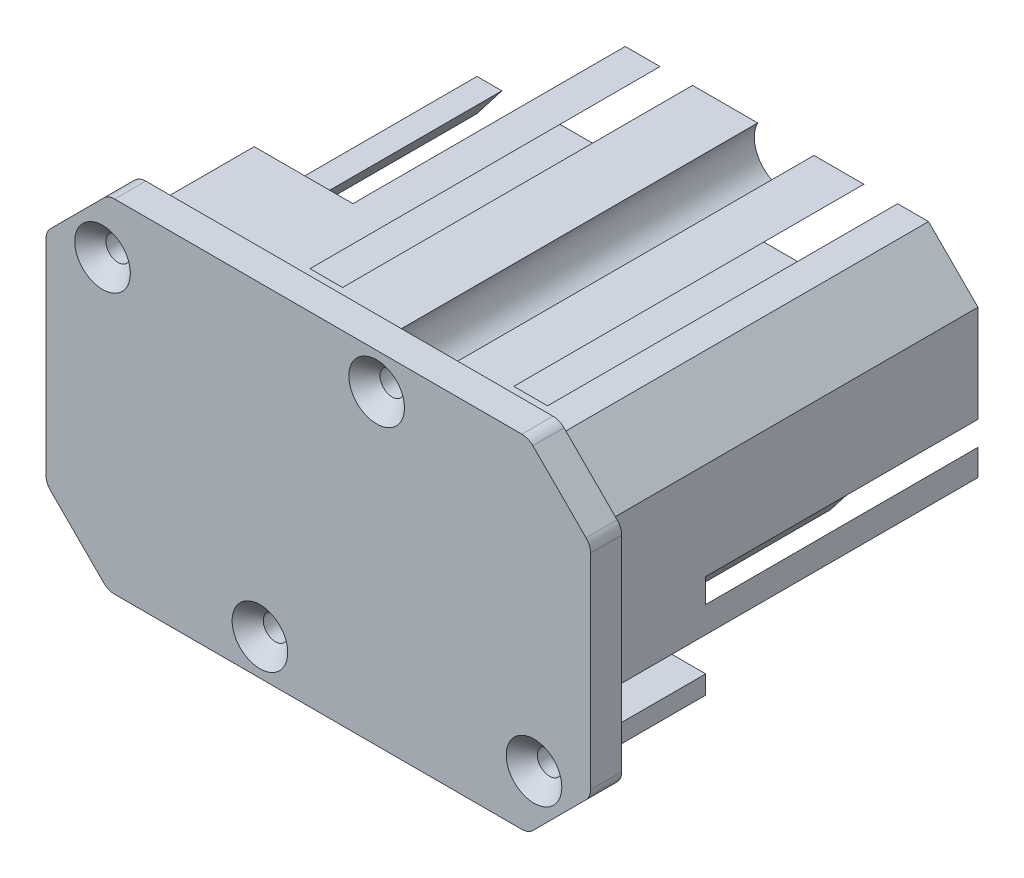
ISO-10303-21;
HEADER;
FILE_DESCRIPTION(('STEP AP214'),'2;1');
FILE_NAME('part.step','',(''),(''),'','','');
FILE_SCHEMA(('AUTOMOTIVE_DESIGN { 1 0 10303 214 1 1 1 1 }'));
ENDSEC;
DATA;
#1=APPLICATION_CONTEXT('core data for automotive mechanical design processes');
#2=APPLICATION_PROTOCOL_DEFINITION('international standard','automotive_design',2000,#1);
#3=PRODUCT_CONTEXT('',#1,'mechanical');
#4=PRODUCT('Part','Part','',(#3));
#5=PRODUCT_RELATED_PRODUCT_CATEGORY('part','',(#4));
#6=PRODUCT_DEFINITION_FORMATION('','',#4);
#7=PRODUCT_DEFINITION_CONTEXT('part definition',#1,'design');
#8=PRODUCT_DEFINITION('design','',#6,#7);
#9=PRODUCT_DEFINITION_SHAPE('','',#8);
#10=(LENGTH_UNIT() NAMED_UNIT(*) SI_UNIT(.MILLI.,.METRE.));
#11=(NAMED_UNIT(*) PLANE_ANGLE_UNIT() SI_UNIT($,.RADIAN.));
#12=(NAMED_UNIT(*) SI_UNIT($,.STERADIAN.) SOLID_ANGLE_UNIT());
#13=UNCERTAINTY_MEASURE_WITH_UNIT(LENGTH_MEASURE(1.E-05),#10,'distance_accuracy_value','');
#14=(GEOMETRIC_REPRESENTATION_CONTEXT(3) GLOBAL_UNCERTAINTY_ASSIGNED_CONTEXT((#13)) GLOBAL_UNIT_ASSIGNED_CONTEXT((#10,
#11,#12)) REPRESENTATION_CONTEXT('',''));
#15=CARTESIAN_POINT('',(0.,0.,0.));
#16=DIRECTION('',(0.,0.,1.));
#17=DIRECTION('',(1.,0.,0.));
#18=AXIS2_PLACEMENT_3D('',#15,#16,#17);
#19=CARTESIAN_POINT('',(0.,0.,-13.6));
#20=DIRECTION('',(0.,0.,-1.));
#21=DIRECTION('',(-1.,0.,0.));
#22=AXIS2_PLACEMENT_3D('',#19,#20,#21);
#23=PLANE('',#22);
#24=DIRECTION('',(0.411976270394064,-0.911194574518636,0.));
#25=VECTOR('',#24,1.);
#26=CARTESIAN_POINT('',(-17.3594294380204,-7.84867820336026,-13.6));
#27=LINE('',#26,#25);
#28=CARTESIAN_POINT('',(-23.7729401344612,6.33649839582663,-13.6));
#29=VERTEX_POINT('',#28);
#30=CARTESIAN_POINT('',(-23.5341067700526,5.80825518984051,-13.6));
#31=VERTEX_POINT('',#30);
#32=EDGE_CURVE('E2237',#29,#31,#27,.T.);
#33=ORIENTED_EDGE('',*,*,#32,.F.);
#34=DIRECTION('',(1.,0.,0.));
#35=VECTOR('',#34,1.);
#36=CARTESIAN_POINT('',(0.,6.33649839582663,-13.6));
#37=LINE('',#36,#35);
#38=CARTESIAN_POINT('',(-23.1122999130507,6.33649839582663,-13.6));
#39=VERTEX_POINT('',#38);
#40=EDGE_CURVE('E2065',#29,#39,#37,.T.);
#41=ORIENTED_EDGE('',*,*,#40,.T.);
#42=DIRECTION('',(-0.62398426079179,-0.781436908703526,0.));
#43=VECTOR('',#42,1.);
#44=CARTESIAN_POINT('',(-17.2030830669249,13.7368134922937,-13.6));
#45=LINE('',#44,#43);
#46=EDGE_CURVE('E1802',#39,#31,#45,.T.);
#47=ORIENTED_EDGE('',*,*,#46,.T.);
#48=EDGE_LOOP('',(#33,#41,#47));
#49=FACE_BOUND('',#48,.T.);
#50=ADVANCED_FACE('F595',(#49),#23,.T.);
#51=CARTESIAN_POINT('',(0.,0.,-3.6));
#52=DIRECTION('',(0.,0.,-1.));
#53=DIRECTION('',(-1.,0.,0.));
#54=AXIS2_PLACEMENT_3D('',#51,#52,#53);
#55=PLANE('',#54);
#56=DIRECTION('',(0.411976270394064,-0.911194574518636,0.));
#57=VECTOR('',#56,1.);
#58=CARTESIAN_POINT('',(-17.3594294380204,-7.84867820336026,-3.6));
#59=LINE('',#58,#57);
#60=CARTESIAN_POINT('',(-21.8099842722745,1.99490190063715,-3.6));
#61=VERTEX_POINT('',#60);
#62=CARTESIAN_POINT('',(-20.138776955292,-1.70141545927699,-3.6));
#63=VERTEX_POINT('',#62);
#64=EDGE_CURVE('E2239',#61,#63,#59,.T.);
#65=ORIENTED_EDGE('',*,*,#64,.F.);
#66=CARTESIAN_POINT('',(-19.5954797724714,-8.59531892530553,-3.6));
#67=DIRECTION('',(0.,0.,-1.));
#68=DIRECTION('',(-1.,0.,0.));
#69=AXIS2_PLACEMENT_3D('',#66,#67,#68);
#70=CIRCLE('',#69,10.8192794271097);
#71=CARTESIAN_POINT('',(-14.826972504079,1.11643404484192,-3.6));
#72=VERTEX_POINT('',#71);
#73=EDGE_CURVE('E2073',#61,#72,#70,.T.);
#74=ORIENTED_EDGE('',*,*,#73,.T.);
#75=DIRECTION('',(-0.707106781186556,-0.707106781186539,0.));
#76=VECTOR('',#75,1.);
#77=CARTESIAN_POINT('',(-7.9717032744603,7.97170327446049,-3.6));
#78=LINE('',#77,#76);
#79=CARTESIAN_POINT('',(-17.644822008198,-1.70141545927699,-3.6));
#80=VERTEX_POINT('',#79);
#81=EDGE_CURVE('E2180',#72,#80,#78,.T.);
#82=ORIENTED_EDGE('',*,*,#81,.T.);
#83=DIRECTION('',(-1.,0.,0.));
#84=VECTOR('',#83,1.);
#85=CARTESIAN_POINT('',(0.,-1.70141545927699,-3.6));
#86=LINE('',#85,#84);
#87=EDGE_CURVE('E2184',#80,#63,#86,.T.);
#88=ORIENTED_EDGE('',*,*,#87,.T.);
#89=EDGE_LOOP('',(#65,#74,#82,#88));
#90=FACE_BOUND('',#89,.T.);
#91=ADVANCED_FACE('F2342',(#90),#55,.T.);
#92=CARTESIAN_POINT('',(0.,6.33649839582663,-3.6));
#93=DIRECTION('',(0.,1.,0.));
#94=DIRECTION('',(0.,0.,1.));
#95=AXIS2_PLACEMENT_3D('',#92,#93,#94);
#96=PLANE('',#95);
#97=DIRECTION('',(0.,0.,-1.));
#98=VECTOR('',#97,1.);
#99=CARTESIAN_POINT('',(-23.7729401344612,6.33649839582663,-3.6));
#100=LINE('',#99,#98);
#101=CARTESIAN_POINT('',(-23.7729401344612,6.33649839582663,0.));
#102=VERTEX_POINT('',#101);
#103=EDGE_CURVE('E2232',#102,#29,#100,.T.);
#104=ORIENTED_EDGE('',*,*,#103,.F.);
#105=DIRECTION('',(-1.,0.,0.));
#106=VECTOR('',#105,1.);
#107=CARTESIAN_POINT('',(0.,6.33649839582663,0.));
#108=LINE('',#107,#106);
#109=CARTESIAN_POINT('',(-14.1206601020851,6.33649839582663,0.));
#110=VERTEX_POINT('',#109);
#111=EDGE_CURVE('E2218',#110,#102,#108,.T.);
#112=ORIENTED_EDGE('',*,*,#111,.F.);
#113=DIRECTION('',(0.,0.,1.));
#114=VECTOR('',#113,1.);
#115=CARTESIAN_POINT('',(-14.1206601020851,6.33649839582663,-3.6));
#116=LINE('',#115,#114);
#117=CARTESIAN_POINT('',(-14.1206601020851,6.33649839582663,-3.6));
#118=VERTEX_POINT('',#117);
#119=EDGE_CURVE('E1429',#118,#110,#116,.T.);
#120=ORIENTED_EDGE('',*,*,#119,.F.);
#121=DIRECTION('',(-1.,0.,0.));
#122=VECTOR('',#121,1.);
#123=CARTESIAN_POINT('',(0.,6.33649839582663,-3.6));
#124=LINE('',#123,#122);
#125=CARTESIAN_POINT('',(-17.1983754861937,6.33649839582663,-3.6));
#126=VERTEX_POINT('',#125);
#127=EDGE_CURVE('E2174',#118,#126,#124,.T.);
#128=ORIENTED_EDGE('',*,*,#127,.T.);
#129=DIRECTION('',(0.,0.,1.));
#130=VECTOR('',#129,1.);
#131=CARTESIAN_POINT('',(-17.1983754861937,6.33649839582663,-13.6));
#132=LINE('',#131,#130);
#133=CARTESIAN_POINT('',(-17.1983754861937,6.33649839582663,-48.6));
#134=VERTEX_POINT('',#133);
#135=EDGE_CURVE('E2070',#134,#126,#132,.T.);
#136=ORIENTED_EDGE('',*,*,#135,.F.);
#137=DIRECTION('',(1.,0.,0.));
#138=VECTOR('',#137,1.);
#139=CARTESIAN_POINT('',(0.,6.33649839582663,-48.6));
#140=LINE('',#139,#138);
#141=CARTESIAN_POINT('',(-23.1122999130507,6.33649839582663,-48.6));
#142=VERTEX_POINT('',#141);
#143=EDGE_CURVE('E1781',#142,#134,#140,.T.);
#144=ORIENTED_EDGE('',*,*,#143,.F.);
#145=DIRECTION('',(0.,0.,1.));
#146=VECTOR('',#145,1.);
#147=CARTESIAN_POINT('',(-23.1122999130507,6.33649839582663,-48.6));
#148=LINE('',#147,#146);
#149=EDGE_CURVE('E2296',#142,#39,#148,.T.);
#150=ORIENTED_EDGE('',*,*,#149,.T.);
#151=ORIENTED_EDGE('',*,*,#40,.F.);
#152=EDGE_LOOP('',(#104,#112,#120,#128,#136,#144,#150,#151));
#153=FACE_BOUND('',#152,.T.);
#154=ADVANCED_FACE('F2230',(#153),#96,.T.);
#155=CARTESIAN_POINT('',(0.,-1.70141545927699,-3.6));
#156=DIRECTION('',(0.,1.,0.));
#157=DIRECTION('',(0.,0.,1.));
#158=AXIS2_PLACEMENT_3D('',#155,#156,#157);
#159=PLANE('',#158);
#160=DIRECTION('',(-1.,0.,0.));
#161=VECTOR('',#160,1.);
#162=CARTESIAN_POINT('',(0.,-1.70141545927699,0.));
#163=LINE('',#162,#161);
#164=CARTESIAN_POINT('',(-17.644822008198,-1.70141545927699,0.));
#165=VERTEX_POINT('',#164);
#166=CARTESIAN_POINT('',(-20.138776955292,-1.70141545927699,0.));
#167=VERTEX_POINT('',#166);
#168=EDGE_CURVE('E1353',#165,#167,#163,.T.);
#169=ORIENTED_EDGE('',*,*,#168,.T.);
#170=DIRECTION('',(0.,0.,-1.));
#171=VECTOR('',#170,1.);
#172=CARTESIAN_POINT('',(-20.138776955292,-1.70141545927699,-3.6));
#173=LINE('',#172,#171);
#174=EDGE_CURVE('E2245',#167,#63,#173,.T.);
#175=ORIENTED_EDGE('',*,*,#174,.T.);
#176=ORIENTED_EDGE('',*,*,#87,.F.);
#177=DIRECTION('',(0.,0.,1.));
#178=VECTOR('',#177,1.);
#179=CARTESIAN_POINT('',(-17.644822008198,-1.70141545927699,-3.6));
#180=LINE('',#179,#178);
#181=EDGE_CURVE('E1423',#80,#165,#180,.T.);
#182=ORIENTED_EDGE('',*,*,#181,.T.);
#183=EDGE_LOOP('',(#169,#175,#176,#182));
#184=FACE_BOUND('',#183,.T.);
#185=ADVANCED_FACE('F2338',(#184),#159,.F.);
#186=CARTESIAN_POINT('',(-19.5954797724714,-8.59531892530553,-13.6));
#187=DIRECTION('',(0.,0.,1.));
#188=DIRECTION('',(1.,0.,0.));
#189=AXIS2_PLACEMENT_3D('',#186,#187,#188);
#190=CYLINDRICAL_SURFACE('',#189,10.8192794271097);
#191=DIRECTION('',(0.,0.,1.));
#192=VECTOR('',#191,1.);
#193=CARTESIAN_POINT('',(-21.8099842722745,1.99490190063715,-13.6));
#194=LINE('',#193,#192);
#195=CARTESIAN_POINT('',(-21.8099842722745,1.99490190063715,-48.6));
#196=VERTEX_POINT('',#195);
#197=EDGE_CURVE('E2236',#196,#61,#194,.T.);
#198=ORIENTED_EDGE('',*,*,#197,.F.);
#199=CARTESIAN_POINT('',(-19.5954797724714,-8.59531892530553,-48.6));
#200=DIRECTION('',(0.,0.,-1.));
#201=DIRECTION('',(-1.,0.,0.));
#202=AXIS2_PLACEMENT_3D('',#199,#200,#201);
#203=CIRCLE('',#202,10.8192794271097);
#204=CARTESIAN_POINT('',(-14.826972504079,1.11643404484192,-48.6));
#205=VERTEX_POINT('',#204);
#206=EDGE_CURVE('E1795',#196,#205,#203,.T.);
#207=ORIENTED_EDGE('',*,*,#206,.T.);
#208=DIRECTION('',(0.,0.,1.));
#209=VECTOR('',#208,1.);
#210=CARTESIAN_POINT('',(-14.826972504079,1.11643404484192,-13.6));
#211=LINE('',#210,#209);
#212=EDGE_CURVE('E2079',#205,#72,#211,.T.);
#213=ORIENTED_EDGE('',*,*,#212,.T.);
#214=ORIENTED_EDGE('',*,*,#73,.F.);
#215=EDGE_LOOP('',(#198,#207,#213,#214));
#216=FACE_BOUND('',#215,.T.);
#217=ADVANCED_FACE('F2326',(#216),#190,.F.);
#218=CARTESIAN_POINT('',(-17.2030830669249,13.7368134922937,-48.6));
#219=DIRECTION('',(-0.781436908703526,0.62398426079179,0.));
#220=DIRECTION('',(-0.62398426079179,-0.781436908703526,0.));
#221=AXIS2_PLACEMENT_3D('',#218,#219,#220);
#222=PLANE('',#221);
#223=DIRECTION('',(0.,0.,-1.));
#224=VECTOR('',#223,1.);
#225=CARTESIAN_POINT('',(-23.5341067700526,5.80825518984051,-48.6));
#226=LINE('',#225,#224);
#227=CARTESIAN_POINT('',(-23.5341067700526,5.80825518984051,-48.6));
#228=VERTEX_POINT('',#227);
#229=EDGE_CURVE('E1345',#31,#228,#226,.T.);
#230=ORIENTED_EDGE('',*,*,#229,.F.);
#231=ORIENTED_EDGE('',*,*,#46,.F.);
#232=ORIENTED_EDGE('',*,*,#149,.F.);
#233=DIRECTION('',(-0.62398426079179,-0.781436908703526,0.));
#234=VECTOR('',#233,1.);
#235=CARTESIAN_POINT('',(-17.2030830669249,13.7368134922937,-48.6));
#236=LINE('',#235,#234);
#237=EDGE_CURVE('E1780',#142,#228,#236,.T.);
#238=ORIENTED_EDGE('',*,*,#237,.T.);
#239=EDGE_LOOP('',(#230,#231,#232,#238));
#240=FACE_BOUND('',#239,.T.);
#241=ADVANCED_FACE('F2329',(#240),#222,.T.);
#242=CARTESIAN_POINT('',(0.,0.,-48.6));
#243=DIRECTION('',(0.,0.,-1.));
#244=DIRECTION('',(-1.,0.,0.));
#245=AXIS2_PLACEMENT_3D('',#242,#243,#244);
#246=PLANE('',#245);
#247=DIRECTION('',(0.411976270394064,-0.911194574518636,0.));
#248=VECTOR('',#247,1.);
#249=CARTESIAN_POINT('',(-17.3594294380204,-7.84867820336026,-48.6));
#250=LINE('',#249,#248);
#251=EDGE_CURVE('E12',#228,#196,#250,.T.);
#252=ORIENTED_EDGE('',*,*,#251,.F.);
#253=ORIENTED_EDGE('',*,*,#237,.F.);
#254=ORIENTED_EDGE('',*,*,#143,.T.);
#255=CARTESIAN_POINT('',(-6.5774189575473,8.55397779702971,-48.6));
#256=DIRECTION('',(0.,0.,-1.));
#257=DIRECTION('',(-1.,0.,0.));
#258=AXIS2_PLACEMENT_3D('',#255,#256,#257);
#259=CIRCLE('',#258,10.8499738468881);
#260=CARTESIAN_POINT('',(-14.6447635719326,1.29864297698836,-48.6));
#261=VERTEX_POINT('',#260);
#262=EDGE_CURVE('E1785',#261,#134,#259,.T.);
#263=ORIENTED_EDGE('',*,*,#262,.F.);
#264=DIRECTION('',(-0.707106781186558,-0.707106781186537,0.));
#265=VECTOR('',#264,1.);
#266=CARTESIAN_POINT('',(-7.97170327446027,7.9717032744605,-48.6));
#267=LINE('',#266,#265);
#268=EDGE_CURVE('E2298',#261,#205,#267,.T.);
#269=ORIENTED_EDGE('',*,*,#268,.T.);
#270=ORIENTED_EDGE('',*,*,#206,.F.);
#271=EDGE_LOOP('',(#252,#253,#254,#263,#269,#270));
#272=FACE_BOUND('',#271,.T.);
#273=ADVANCED_FACE('F2310',(#272),#246,.T.);
#274=DIRECTION('',(-0.411976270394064,0.911194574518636,0.));
#275=VECTOR('',#274,1.);
#276=CARTESIAN_POINT('',(-21.2000565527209,-9.58513195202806,-13.6));
#277=LINE('',#276,#275);
#278=CARTESIAN_POINT('',(-26.4875492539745,2.10955778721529,-13.6));
#279=VERTEX_POINT('',#278);
#280=CARTESIAN_POINT('',(-28.3986660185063,6.33649839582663,-13.6));
#281=VERTEX_POINT('',#280);
#282=EDGE_CURVE('E1773',#279,#281,#277,.T.);
#283=ORIENTED_EDGE('',*,*,#282,.F.);
#284=CARTESIAN_POINT('',(-32.2,-5.04434036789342,-13.6));
#285=VERTEX_POINT('',#284);
#286=EDGE_CURVE('E1772',#279,#285,#45,.T.);
#287=ORIENTED_EDGE('',*,*,#286,.T.);
#288=DIRECTION('',(0.,1.,0.));
#289=VECTOR('',#288,1.);
#290=CARTESIAN_POINT('',(-32.2,0.,-13.6));
#291=LINE('',#290,#289);
#292=CARTESIAN_POINT('',(-32.2,2.1927134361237,-13.6));
#293=VERTEX_POINT('',#292);
#294=EDGE_CURVE('E2062',#285,#293,#291,.T.);
#295=ORIENTED_EDGE('',*,*,#294,.T.);
#296=DIRECTION('',(-0.61112446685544,-0.791534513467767,0.));
#297=VECTOR('',#296,1.);
#298=CARTESIAN_POINT('',(-21.2348384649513,16.3949001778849,-13.6));
#299=LINE('',#298,#297);
#300=CARTESIAN_POINT('',(-29.0006848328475,6.33649839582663,-13.6));
#301=VERTEX_POINT('',#300);
#302=EDGE_CURVE('E2268',#301,#293,#299,.T.);
#303=ORIENTED_EDGE('',*,*,#302,.F.);
#304=EDGE_CURVE('E2067',#301,#281,#37,.T.);
#305=ORIENTED_EDGE('',*,*,#304,.T.);
#306=EDGE_LOOP('',(#283,#287,#295,#303,#305));
#307=FACE_BOUND('',#306,.T.);
#308=ADVANCED_FACE('F2353',(#307),#23,.T.);
#309=CARTESIAN_POINT('',(0.,0.,-13.6));
#310=DIRECTION('',(0.,0.,-1.));
#311=DIRECTION('',(-1.,0.,0.));
#312=AXIS2_PLACEMENT_3D('',#309,#310,#311);
#313=PLANE('',#312);
#314=DIRECTION('',(1.,0.,0.));
#315=VECTOR('',#314,1.);
#316=CARTESIAN_POINT('',(0.,19.1999999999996,-13.6));
#317=LINE('',#316,#315);
#318=CARTESIAN_POINT('',(-25.8402020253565,19.1999999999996,-13.6));
#319=VERTEX_POINT('',#318);
#320=CARTESIAN_POINT('',(-13.1458942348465,19.1999999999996,-13.6));
#321=VERTEX_POINT('',#320);
#322=EDGE_CURVE('E2051',#319,#321,#317,.T.);
#323=ORIENTED_EDGE('',*,*,#322,.T.);
#324=DIRECTION('',(0.611500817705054,0.791243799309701,0.));
#325=VECTOR('',#324,1.);
#326=CARTESIAN_POINT('',(-17.5200549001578,13.5401097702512,-13.6));
#327=LINE('',#326,#325);
#328=CARTESIAN_POINT('',(-19.6038864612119,10.8437621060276,-13.6));
#329=VERTEX_POINT('',#328);
#330=EDGE_CURVE('E2282',#329,#321,#327,.T.);
#331=ORIENTED_EDGE('',*,*,#330,.F.);
#332=DIRECTION('',(-1.,0.,0.));
#333=VECTOR('',#332,1.);
#334=CARTESIAN_POINT('',(0.,10.8437621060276,-13.6));
#335=LINE('',#334,#333);
#336=CARTESIAN_POINT('',(-20.193996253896,10.8437621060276,-13.6));
#337=VERTEX_POINT('',#336);
#338=EDGE_CURVE('E2034',#329,#337,#335,.T.);
#339=ORIENTED_EDGE('',*,*,#338,.T.);
#340=DIRECTION('',(-0.996679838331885,-0.0814205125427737,0.));
#341=VECTOR('',#340,1.);
#342=CARTESIAN_POINT('',(-1.01384533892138,12.4106220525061,-13.6));
#343=LINE('',#342,#341);
#344=CARTESIAN_POINT('',(-32.2,9.86297074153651,-13.6));
#345=VERTEX_POINT('',#344);
#346=EDGE_CURVE('E2036',#337,#345,#343,.T.);
#347=ORIENTED_EDGE('',*,*,#346,.T.);
#348=DIRECTION('',(0.,1.,0.));
#349=VECTOR('',#348,1.);
#350=CARTESIAN_POINT('',(-32.2,0.,-13.6));
#351=LINE('',#350,#349);
#352=CARTESIAN_POINT('',(-32.2,12.8402020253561,-13.6));
#353=VERTEX_POINT('',#352);
#354=EDGE_CURVE('E2039',#345,#353,#351,.T.);
#355=ORIENTED_EDGE('',*,*,#354,.T.);
#356=DIRECTION('',(0.707106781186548,0.707106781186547,0.));
#357=VECTOR('',#356,1.);
#358=CARTESIAN_POINT('',(-22.520101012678,22.520101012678,-13.6));
#359=LINE('',#358,#357);
#360=CARTESIAN_POINT('',(-31.5766489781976,13.4635530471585,-13.6));
#361=VERTEX_POINT('',#360);
#362=EDGE_CURVE('E2042',#353,#361,#359,.T.);
#363=ORIENTED_EDGE('',*,*,#362,.T.);
#364=CARTESIAN_POINT('',(-27.729631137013,14.7296311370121,-13.6));
#365=DIRECTION('',(0.,0.,-1.));
#366=DIRECTION('',(-1.,0.,0.));
#367=AXIS2_PLACEMENT_3D('',#364,#365,#366);
#368=CIRCLE('',#367,4.05);
#369=CARTESIAN_POINT('',(-26.4635530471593,18.5766489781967,-13.6));
#370=VERTEX_POINT('',#369);
#371=EDGE_CURVE('E2045',#370,#361,#368,.T.);
#372=ORIENTED_EDGE('',*,*,#371,.F.);
#373=DIRECTION('',(0.707106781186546,0.707106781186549,0.));
#374=VECTOR('',#373,1.);
#375=CARTESIAN_POINT('',(-22.5201010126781,22.520101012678,-13.6));
#376=LINE('',#375,#374);
#377=EDGE_CURVE('E2048',#370,#319,#376,.T.);
#378=ORIENTED_EDGE('',*,*,#377,.T.);
#379=EDGE_LOOP('',(#323,#331,#339,#347,#355,#363,#372,#378));
#380=FACE_BOUND('',#379,.T.);
#381=ADVANCED_FACE('F2495',(#380),#313,.T.);
#382=CARTESIAN_POINT('',(0.,0.,-13.6));
#383=DIRECTION('',(0.,0.,-1.));
#384=DIRECTION('',(-1.,0.,0.));
#385=AXIS2_PLACEMENT_3D('',#382,#383,#384);
#386=PLANE('',#385);
#387=DIRECTION('',(-1.,0.,0.));
#388=VECTOR('',#387,1.);
#389=CARTESIAN_POINT('',(0.,-19.2000000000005,-13.6));
#390=LINE('',#389,#388);
#391=CARTESIAN_POINT('',(25.8402020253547,-19.2000000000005,-13.6));
#392=VERTEX_POINT('',#391);
#393=CARTESIAN_POINT('',(13.2212043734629,-19.2000000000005,-13.6));
#394=VERTEX_POINT('',#393);
#395=EDGE_CURVE('E1971',#392,#394,#390,.T.);
#396=ORIENTED_EDGE('',*,*,#395,.T.);
#397=DIRECTION('',(-0.613204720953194,-0.789924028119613,0.));
#398=VECTOR('',#397,1.);
#399=CARTESIAN_POINT('',(17.5499614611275,-13.623739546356,-13.6));
#400=LINE('',#399,#398);
#401=CARTESIAN_POINT('',(19.9991944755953,-10.4686627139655,-13.6));
#402=VERTEX_POINT('',#401);
#403=EDGE_CURVE('E1806',#402,#394,#400,.T.);
#404=ORIENTED_EDGE('',*,*,#403,.F.);
#405=DIRECTION('',(1.,0.,0.));
#406=VECTOR('',#405,1.);
#407=CARTESIAN_POINT('',(0.,-10.4686627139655,-13.6));
#408=LINE('',#407,#406);
#409=CARTESIAN_POINT('',(32.2,-10.4686627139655,-13.6));
#410=VERTEX_POINT('',#409);
#411=EDGE_CURVE('E1957',#402,#410,#408,.T.);
#412=ORIENTED_EDGE('',*,*,#411,.T.);
#413=DIRECTION('',(0.,-1.,0.));
#414=VECTOR('',#413,1.);
#415=CARTESIAN_POINT('',(32.2,0.,-13.6));
#416=LINE('',#415,#414);
#417=CARTESIAN_POINT('',(32.2,-12.8402020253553,-13.6));
#418=VERTEX_POINT('',#417);
#419=EDGE_CURVE('E1959',#410,#418,#416,.T.);
#420=ORIENTED_EDGE('',*,*,#419,.T.);
#421=DIRECTION('',(-0.707106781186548,-0.707106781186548,0.));
#422=VECTOR('',#421,1.);
#423=CARTESIAN_POINT('',(22.5201010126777,-22.5201010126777,-13.6));
#424=LINE('',#423,#422);
#425=CARTESIAN_POINT('',(31.5766489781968,-13.4635530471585,-13.6));
#426=VERTEX_POINT('',#425);
#427=EDGE_CURVE('E1962',#418,#426,#424,.T.);
#428=ORIENTED_EDGE('',*,*,#427,.T.);
#429=CARTESIAN_POINT('',(27.7296311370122,-14.7296311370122,-13.6));
#430=DIRECTION('',(0.,0.,-1.));
#431=DIRECTION('',(-1.,0.,0.));
#432=AXIS2_PLACEMENT_3D('',#429,#430,#431);
#433=CIRCLE('',#432,4.05);
#434=CARTESIAN_POINT('',(26.4635530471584,-18.5766489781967,-13.6));
#435=VERTEX_POINT('',#434);
#436=EDGE_CURVE('E1965',#426,#435,#433,.F.);
#437=ORIENTED_EDGE('',*,*,#436,.T.);
#438=DIRECTION('',(-0.707106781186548,-0.707106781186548,0.));
#439=VECTOR('',#438,1.);
#440=CARTESIAN_POINT('',(22.5201010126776,-22.5201010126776,-13.6));
#441=LINE('',#440,#439);
#442=EDGE_CURVE('E1968',#435,#392,#441,.T.);
#443=ORIENTED_EDGE('',*,*,#442,.T.);
#444=EDGE_LOOP('',(#396,#404,#412,#420,#428,#437,#443));
#445=FACE_BOUND('',#444,.T.);
#446=ADVANCED_FACE('F2498',(#445),#386,.T.);
#447=CARTESIAN_POINT('',(0.,0.,-13.6));
#448=DIRECTION('',(0.,0.,-1.));
#449=DIRECTION('',(-1.,0.,0.));
#450=AXIS2_PLACEMENT_3D('',#447,#448,#449);
#451=PLANE('',#450);
#452=DIRECTION('',(0.615730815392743,0.787956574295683,0.));
#453=VECTOR('',#452,1.);
#454=CARTESIAN_POINT('',(17.3804102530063,-13.5815278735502,-13.6));
#455=LINE('',#454,#453);
#456=CARTESIAN_POINT('',(23.21372783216,-6.11657594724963,-13.6));
#457=VERTEX_POINT('',#456);
#458=CARTESIAN_POINT('',(29.6103566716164,2.0692507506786,-13.6));
#459=VERTEX_POINT('',#458);
#460=EDGE_CURVE('E1873',#457,#459,#455,.T.);
#461=ORIENTED_EDGE('',*,*,#460,.T.);
#462=DIRECTION('',(-0.835690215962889,0.549201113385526,0.));
#463=VECTOR('',#462,1.);
#464=CARTESIAN_POINT('',(9.88083839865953,15.0351479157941,-13.6));
#465=LINE('',#464,#463);
#466=CARTESIAN_POINT('',(32.2,0.367382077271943,-13.6));
#467=VERTEX_POINT('',#466);
#468=EDGE_CURVE('E1876',#467,#459,#465,.T.);
#469=ORIENTED_EDGE('',*,*,#468,.F.);
#470=DIRECTION('',(0.,-1.,0.));
#471=VECTOR('',#470,1.);
#472=CARTESIAN_POINT('',(32.2,0.,-13.6));
#473=LINE('',#472,#471);
#474=CARTESIAN_POINT('',(32.2,-2.74495352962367,-13.6));
#475=VERTEX_POINT('',#474);
#476=EDGE_CURVE('E1981',#467,#475,#473,.T.);
#477=ORIENTED_EDGE('',*,*,#476,.T.);
#478=DIRECTION('',(0.63342181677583,0.773806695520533,0.));
#479=VECTOR('',#478,1.);
#480=CARTESIAN_POINT('',(20.6260411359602,-16.8840416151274,-13.6));
#481=LINE('',#480,#479);
#482=CARTESIAN_POINT('',(29.4400611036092,-6.11657594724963,-13.6));
#483=VERTEX_POINT('',#482);
#484=EDGE_CURVE('E1880',#483,#475,#481,.T.);
#485=ORIENTED_EDGE('',*,*,#484,.F.);
#486=DIRECTION('',(-1.,0.,0.));
#487=VECTOR('',#486,1.);
#488=CARTESIAN_POINT('',(0.,-6.11657594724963,-13.6));
#489=LINE('',#488,#487);
#490=EDGE_CURVE('E1983',#483,#457,#489,.T.);
#491=ORIENTED_EDGE('',*,*,#490,.T.);
#492=EDGE_LOOP('',(#461,#469,#477,#485,#491));
#493=FACE_BOUND('',#492,.T.);
#494=ADVANCED_FACE('F2652',(#493),#451,.T.);
#495=CARTESIAN_POINT('',(0.,0.,-3.6));
#496=DIRECTION('',(0.,0.,-1.));
#497=DIRECTION('',(-1.,0.,0.));
#498=AXIS2_PLACEMENT_3D('',#495,#496,#497);
#499=PLANE('',#498);
#500=CARTESIAN_POINT('',(6.45886216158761,-8.60944210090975,-3.6));
#501=DIRECTION('',(0.,0.,-1.));
#502=DIRECTION('',(-1.,0.,0.));
#503=AXIS2_PLACEMENT_3D('',#500,#501,#502);
#504=CIRCLE('',#503,10.8266365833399);
#505=CARTESIAN_POINT('',(-3.98008641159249,-5.73813361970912,-3.6));
#506=VERTEX_POINT('',#505);
#507=CARTESIAN_POINT('',(-0.972961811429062,-0.736446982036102,-3.6));
#508=VERTEX_POINT('',#507);
#509=EDGE_CURVE('E1918',#506,#508,#504,.T.);
#510=ORIENTED_EDGE('',*,*,#509,.T.);
#511=CARTESIAN_POINT('',(-6.5774189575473,8.55397779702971,-3.6));
#512=DIRECTION('',(0.,0.,-1.));
#513=DIRECTION('',(-1.,0.,0.));
#514=AXIS2_PLACEMENT_3D('',#511,#512,#513);
#515=CIRCLE('',#514,10.8499738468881);
#516=CARTESIAN_POINT('',(-12.1212274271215,-0.772764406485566,-3.6));
#517=VERTEX_POINT('',#516);
#518=EDGE_CURVE('E1923',#508,#517,#515,.T.);
#519=ORIENTED_EDGE('',*,*,#518,.T.);
#520=CARTESIAN_POINT('',(-19.5954797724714,-8.59531892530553,-3.6));
#521=DIRECTION('',(0.,0.,-1.));
#522=DIRECTION('',(-1.,0.,0.));
#523=AXIS2_PLACEMENT_3D('',#520,#521,#522);
#524=CIRCLE('',#523,10.8192794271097);
#525=CARTESIAN_POINT('',(-9.16028454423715,-5.73813361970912,-3.6));
#526=VERTEX_POINT('',#525);
#527=EDGE_CURVE('E1920',#517,#526,#524,.T.);
#528=ORIENTED_EDGE('',*,*,#527,.T.);
#529=DIRECTION('',(-1.,0.,0.));
#530=VECTOR('',#529,1.);
#531=CARTESIAN_POINT('',(0.,-5.73813361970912,-3.6));
#532=LINE('',#531,#530);
#533=CARTESIAN_POINT('',(-13.0935477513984,-5.73813361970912,-3.6));
#534=VERTEX_POINT('',#533);
#535=EDGE_CURVE('E2110',#526,#534,#532,.T.);
#536=ORIENTED_EDGE('',*,*,#535,.T.);
#537=DIRECTION('',(-0.0982105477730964,0.995165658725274,0.));
#538=VECTOR('',#537,1.);
#539=CARTESIAN_POINT('',(-13.5280772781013,-1.3350539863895,-3.6));
#540=LINE('',#539,#538);
#541=CARTESIAN_POINT('',(-13.4919219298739,-1.70141545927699,-3.6));
#542=VERTEX_POINT('',#541);
#543=EDGE_CURVE('E2113',#534,#542,#540,.T.);
#544=ORIENTED_EDGE('',*,*,#543,.T.);
#545=DIRECTION('',(-0.761760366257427,-0.647858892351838,0.));
#546=VECTOR('',#545,1.);
#547=CARTESIAN_POINT('',(-4.82317387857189,5.67114651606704,-3.6));
#548=LINE('',#547,#546);
#549=CARTESIAN_POINT('',(-9.34816949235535,1.82274644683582,-3.6));
#550=VERTEX_POINT('',#549);
#551=EDGE_CURVE('E2085',#550,#542,#548,.T.);
#552=ORIENTED_EDGE('',*,*,#551,.F.);
#553=DIRECTION('',(-1.,0.,0.));
#554=VECTOR('',#553,1.);
#555=CARTESIAN_POINT('',(0.,1.82274644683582,-3.6));
#556=LINE('',#555,#554);
#557=CARTESIAN_POINT('',(-0.579404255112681,1.82274644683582,-3.6));
#558=VERTEX_POINT('',#557);
#559=EDGE_CURVE('E2088',#558,#550,#556,.T.);
#560=ORIENTED_EDGE('',*,*,#559,.F.);
#561=DIRECTION('',(0.,-1.,0.));
#562=VECTOR('',#561,1.);
#563=CARTESIAN_POINT('',(-0.579404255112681,0.,-3.6));
#564=LINE('',#563,#562);
#565=CARTESIAN_POINT('',(-0.579404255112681,6.33649839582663,-3.6));
#566=VERTEX_POINT('',#565);
#567=EDGE_CURVE('E2092',#566,#558,#564,.T.);
#568=ORIENTED_EDGE('',*,*,#567,.F.);
#569=DIRECTION('',(-1.,0.,0.));
#570=VECTOR('',#569,1.);
#571=CARTESIAN_POINT('',(0.,6.33649839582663,-3.6));
#572=LINE('',#571,#570);
#573=CARTESIAN_POINT('',(4.04353757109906,6.33649839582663,-3.6));
#574=VERTEX_POINT('',#573);
#575=EDGE_CURVE('E2095',#574,#566,#572,.T.);
#576=ORIENTED_EDGE('',*,*,#575,.F.);
#577=CARTESIAN_POINT('',(-6.5774189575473,8.55397779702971,-3.6));
#578=DIRECTION('',(0.,0.,-1.));
#579=DIRECTION('',(-1.,0.,0.));
#580=AXIS2_PLACEMENT_3D('',#577,#578,#579);
#581=CIRCLE('',#580,10.8499738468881);
#582=CARTESIAN_POINT('',(0.868601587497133,0.662291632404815,-3.6));
#583=VERTEX_POINT('',#582);
#584=EDGE_CURVE('E1943',#574,#583,#581,.T.);
#585=ORIENTED_EDGE('',*,*,#584,.T.);
#586=CARTESIAN_POINT('',(6.45886216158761,-8.60944210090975,-3.6));
#587=DIRECTION('',(0.,0.,-1.));
#588=DIRECTION('',(-1.,0.,0.));
#589=AXIS2_PLACEMENT_3D('',#586,#587,#588);
#590=CIRCLE('',#589,10.8266365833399);
#591=CARTESIAN_POINT('',(11.6311695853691,0.901777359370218,-3.6));
#592=VERTEX_POINT('',#591);
#593=EDGE_CURVE('E1940',#583,#592,#590,.T.);
#594=ORIENTED_EDGE('',*,*,#593,.T.);
#595=DIRECTION('',(-0.752693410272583,-0.658371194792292,0.));
#596=VECTOR('',#595,1.);
#597=CARTESIAN_POINT('',(4.5946837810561,-5.25294580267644,-3.6));
#598=LINE('',#597,#596);
#599=CARTESIAN_POINT('',(9.15979800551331,-1.25989941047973,-3.6));
#600=VERTEX_POINT('',#599);
#601=EDGE_CURVE('E2102',#592,#600,#598,.T.);
#602=ORIENTED_EDGE('',*,*,#601,.T.);
#603=DIRECTION('',(-1.,0.,0.));
#604=VECTOR('',#603,1.);
#605=CARTESIAN_POINT('',(0.,-1.25989941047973,-3.6));
#606=LINE('',#605,#604);
#607=CARTESIAN_POINT('',(0.,-1.25989941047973,-3.6));
#608=VERTEX_POINT('',#607);
#609=EDGE_CURVE('E2106',#600,#608,#606,.T.);
#610=ORIENTED_EDGE('',*,*,#609,.T.);
#611=DIRECTION('',(0.,-1.,0.));
#612=VECTOR('',#611,1.);
#613=CARTESIAN_POINT('',(0.,0.,-3.6));
#614=LINE('',#613,#612);
#615=CARTESIAN_POINT('',(0.,-5.73813361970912,-3.6));
#616=VERTEX_POINT('',#615);
#617=EDGE_CURVE('E2108',#608,#616,#614,.T.);
#618=ORIENTED_EDGE('',*,*,#617,.T.);
#619=EDGE_CURVE('E2111',#616,#506,#532,.T.);
#620=ORIENTED_EDGE('',*,*,#619,.T.);
#621=EDGE_LOOP('',(#510,#519,#528,#536,#544,#552,#560,#568,#576,#585,#594,#602,#610,#618,#620));
#622=FACE_BOUND('',#621,.T.);
#623=ADVANCED_FACE('F2384',(#622),#499,.T.);
#624=CARTESIAN_POINT('',(12.6840822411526,1.82274644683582,-3.6));
#625=VERTEX_POINT('',#624);
#626=CARTESIAN_POINT('',(11.8599649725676,1.10190172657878,-3.6));
#627=VERTEX_POINT('',#626);
#628=EDGE_CURVE('E2103',#625,#627,#598,.T.);
#629=ORIENTED_EDGE('',*,*,#628,.T.);
#630=CARTESIAN_POINT('',(19.6973279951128,8.58392123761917,-3.6));
#631=DIRECTION('',(0.,0.,-1.));
#632=DIRECTION('',(-1.,0.,0.));
#633=AXIS2_PLACEMENT_3D('',#630,#631,#632);
#634=CIRCLE('',#633,10.8353530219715);
#635=CARTESIAN_POINT('',(9.0976126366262,6.33649839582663,-3.6));
#636=VERTEX_POINT('',#635);
#637=EDGE_CURVE('E1937',#627,#636,#634,.T.);
#638=ORIENTED_EDGE('',*,*,#637,.T.);
#639=CARTESIAN_POINT('',(12.6840822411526,6.33649839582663,-3.6));
#640=VERTEX_POINT('',#639);
#641=EDGE_CURVE('E2096',#640,#636,#572,.T.);
#642=ORIENTED_EDGE('',*,*,#641,.F.);
#643=DIRECTION('',(0.,1.,0.));
#644=VECTOR('',#643,1.);
#645=CARTESIAN_POINT('',(12.6840822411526,0.,-3.6));
#646=LINE('',#645,#644);
#647=EDGE_CURVE('E2099',#625,#640,#646,.T.);
#648=ORIENTED_EDGE('',*,*,#647,.F.);
#649=EDGE_LOOP('',(#629,#638,#642,#648));
#650=FACE_BOUND('',#649,.T.);
#651=ADVANCED_FACE('F2379',(#650),#499,.T.);
#652=CARTESIAN_POINT('',(0.,0.,-3.6));
#653=DIRECTION('',(0.,0.,-1.));
#654=DIRECTION('',(-1.,0.,0.));
#655=AXIS2_PLACEMENT_3D('',#652,#653,#654);
#656=PLANE('',#655);
#657=CARTESIAN_POINT('',(19.6973279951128,8.58392123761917,-3.6));
#658=DIRECTION('',(0.,0.,-1.));
#659=DIRECTION('',(-1.,0.,0.));
#660=AXIS2_PLACEMENT_3D('',#657,#658,#659);
#661=CIRCLE('',#660,10.8353530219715);
#662=CARTESIAN_POINT('',(21.8661403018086,19.1999999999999,-3.6));
#663=VERTEX_POINT('',#662);
#664=CARTESIAN_POINT('',(14.0384331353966,-0.656305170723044,-3.6));
#665=VERTEX_POINT('',#664);
#666=EDGE_CURVE('E1980',#663,#665,#661,.T.);
#667=ORIENTED_EDGE('',*,*,#666,.T.);
#668=DIRECTION('',(-0.691593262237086,-0.72228717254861,0.));
#669=VECTOR('',#668,1.);
#670=CARTESIAN_POINT('',(7.65167658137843,-7.32651522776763,-3.6));
#671=LINE('',#670,#669);
#672=CARTESIAN_POINT('',(16.4121363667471,1.82274644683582,-3.6));
#673=VERTEX_POINT('',#672);
#674=EDGE_CURVE('E1466',#673,#665,#671,.T.);
#675=ORIENTED_EDGE('',*,*,#674,.F.);
#676=DIRECTION('',(-1.,0.,0.));
#677=VECTOR('',#676,1.);
#678=CARTESIAN_POINT('',(0.,1.82274644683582,-3.6));
#679=LINE('',#678,#677);
#680=CARTESIAN_POINT('',(25.8402020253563,1.82274644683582,-3.6));
#681=VERTEX_POINT('',#680);
#682=EDGE_CURVE('E1469',#681,#673,#679,.T.);
#683=ORIENTED_EDGE('',*,*,#682,.F.);
#684=DIRECTION('',(0.,-1.,0.));
#685=VECTOR('',#684,1.);
#686=CARTESIAN_POINT('',(25.8402020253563,0.,-3.6));
#687=LINE('',#686,#685);
#688=CARTESIAN_POINT('',(25.8402020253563,15.1483464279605,-3.6));
#689=VERTEX_POINT('',#688);
#690=EDGE_CURVE('E1472',#689,#681,#687,.T.);
#691=ORIENTED_EDGE('',*,*,#690,.F.);
#692=DIRECTION('',(1.,0.,0.));
#693=VECTOR('',#692,1.);
#694=CARTESIAN_POINT('',(0.,15.1483464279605,-3.6));
#695=LINE('',#694,#693);
#696=CARTESIAN_POINT('',(12.9502768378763,15.1483464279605,-3.6));
#697=VERTEX_POINT('',#696);
#698=EDGE_CURVE('E1475',#697,#689,#695,.T.);
#699=ORIENTED_EDGE('',*,*,#698,.F.);
#700=DIRECTION('',(0.,1.,0.));
#701=VECTOR('',#700,1.);
#702=CARTESIAN_POINT('',(12.9502768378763,0.,-3.6));
#703=LINE('',#702,#701);
#704=CARTESIAN_POINT('',(12.9502768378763,10.8437621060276,-3.6));
#705=VERTEX_POINT('',#704);
#706=EDGE_CURVE('E1478',#705,#697,#703,.T.);
#707=ORIENTED_EDGE('',*,*,#706,.F.);
#708=DIRECTION('',(1.,0.,0.));
#709=VECTOR('',#708,1.);
#710=CARTESIAN_POINT('',(0.,10.8437621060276,-3.6));
#711=LINE('',#710,#709);
#712=CARTESIAN_POINT('',(9.10025319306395,10.8437621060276,-3.6));
#713=VERTEX_POINT('',#712);
#714=EDGE_CURVE('E1481',#713,#705,#711,.T.);
#715=ORIENTED_EDGE('',*,*,#714,.F.);
#716=CARTESIAN_POINT('',(19.6973279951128,8.58392123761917,-3.6));
#717=DIRECTION('',(0.,0.,-1.));
#718=DIRECTION('',(-1.,0.,0.));
#719=AXIS2_PLACEMENT_3D('',#716,#717,#718);
#720=CIRCLE('',#719,10.8353530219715);
#721=CARTESIAN_POINT('',(17.528515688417,19.1999999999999,-3.6));
#722=VERTEX_POINT('',#721);
#723=EDGE_CURVE('E2017',#713,#722,#720,.T.);
#724=ORIENTED_EDGE('',*,*,#723,.T.);
#725=DIRECTION('',(-1.,0.,0.));
#726=VECTOR('',#725,1.);
#727=CARTESIAN_POINT('',(0.,19.1999999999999,-3.6));
#728=LINE('',#727,#726);
#729=EDGE_CURVE('E1456',#663,#722,#728,.T.);
#730=ORIENTED_EDGE('',*,*,#729,.F.);
#731=EDGE_LOOP('',(#667,#675,#683,#691,#699,#707,#715,#724,#730));
#732=FACE_BOUND('',#731,.T.);
#733=ADVANCED_FACE('F2358',(#732),#656,.T.);
#734=CARTESIAN_POINT('',(6.45886216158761,-8.60944210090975,-3.6));
#735=DIRECTION('',(0.,0.,-1.));
#736=DIRECTION('',(-1.,0.,0.));
#737=AXIS2_PLACEMENT_3D('',#734,#735,#736);
#738=CIRCLE('',#737,10.8266365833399);
#739=CARTESIAN_POINT('',(17.1246653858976,-10.4686627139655,-3.6));
#740=VERTEX_POINT('',#739);
#741=CARTESIAN_POINT('',(8.70744907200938,-19.2000000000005,-3.6));
#742=VERTEX_POINT('',#741);
#743=EDGE_CURVE('E1956',#740,#742,#738,.T.);
#744=ORIENTED_EDGE('',*,*,#743,.T.);
#745=DIRECTION('',(1.,0.,0.));
#746=VECTOR('',#745,1.);
#747=CARTESIAN_POINT('',(0.,-19.2000000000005,-3.6));
#748=LINE('',#747,#746);
#749=CARTESIAN_POINT('',(4.21027525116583,-19.2000000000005,-3.6));
#750=VERTEX_POINT('',#749);
#751=EDGE_CURVE('E1389',#750,#742,#748,.T.);
#752=ORIENTED_EDGE('',*,*,#751,.F.);
#753=CARTESIAN_POINT('',(6.45886216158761,-8.60944210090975,-3.6));
#754=DIRECTION('',(0.,0.,-1.));
#755=DIRECTION('',(-1.,0.,0.));
#756=AXIS2_PLACEMENT_3D('',#753,#754,#755);
#757=CIRCLE('',#756,10.8266365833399);
#758=CARTESIAN_POINT('',(-4.20694106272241,-10.4686627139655,-3.6));
#759=VERTEX_POINT('',#758);
#760=EDGE_CURVE('E2000',#750,#759,#757,.T.);
#761=ORIENTED_EDGE('',*,*,#760,.T.);
#762=DIRECTION('',(1.,0.,0.));
#763=VECTOR('',#762,1.);
#764=CARTESIAN_POINT('',(0.,-10.4686627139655,-3.6));
#765=LINE('',#764,#763);
#766=CARTESIAN_POINT('',(0.,-10.4686627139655,-3.6));
#767=VERTEX_POINT('',#766);
#768=EDGE_CURVE('E2193',#759,#767,#765,.T.);
#769=ORIENTED_EDGE('',*,*,#768,.T.);
#770=DIRECTION('',(0.,-1.,0.));
#771=VECTOR('',#770,1.);
#772=CARTESIAN_POINT('',(0.,0.,-3.6));
#773=LINE('',#772,#771);
#774=CARTESIAN_POINT('',(0.,-15.1361180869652,-3.6));
#775=VERTEX_POINT('',#774);
#776=EDGE_CURVE('E2196',#767,#775,#773,.T.);
#777=ORIENTED_EDGE('',*,*,#776,.T.);
#778=DIRECTION('',(1.,0.,0.));
#779=VECTOR('',#778,1.);
#780=CARTESIAN_POINT('',(0.,-15.1361180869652,-3.6));
#781=LINE('',#780,#779);
#782=CARTESIAN_POINT('',(13.4604888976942,-15.1361180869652,-3.6));
#783=VERTEX_POINT('',#782);
#784=EDGE_CURVE('E2198',#775,#783,#781,.T.);
#785=ORIENTED_EDGE('',*,*,#784,.T.);
#786=DIRECTION('',(0.,1.,0.));
#787=VECTOR('',#786,1.);
#788=CARTESIAN_POINT('',(13.4604888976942,0.,-3.6));
#789=LINE('',#788,#787);
#790=CARTESIAN_POINT('',(13.4604888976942,-10.4686627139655,-3.6));
#791=VERTEX_POINT('',#790);
#792=EDGE_CURVE('E2200',#783,#791,#789,.T.);
#793=ORIENTED_EDGE('',*,*,#792,.T.);
#794=DIRECTION('',(1.,0.,0.));
#795=VECTOR('',#794,1.);
#796=CARTESIAN_POINT('',(0.,-10.4686627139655,-3.6));
#797=LINE('',#796,#795);
#798=EDGE_CURVE('E1394',#791,#740,#797,.T.);
#799=ORIENTED_EDGE('',*,*,#798,.T.);
#800=EDGE_LOOP('',(#744,#752,#761,#769,#777,#785,#793,#799));
#801=FACE_BOUND('',#800,.T.);
#802=ADVANCED_FACE('F2345',(#801),#55,.T.);
#803=CARTESIAN_POINT('',(6.45886216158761,-8.60944210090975,-3.6));
#804=DIRECTION('',(0.,0.,-1.));
#805=DIRECTION('',(-1.,0.,0.));
#806=AXIS2_PLACEMENT_3D('',#803,#804,#805);
#807=CIRCLE('',#806,10.8266365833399);
#808=CARTESIAN_POINT('',(13.9279006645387,-0.771743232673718,-3.6));
#809=VERTEX_POINT('',#808);
#810=CARTESIAN_POINT('',(16.9945955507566,-6.11657594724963,-3.6));
#811=VERTEX_POINT('',#810);
#812=EDGE_CURVE('E1984',#809,#811,#807,.T.);
#813=ORIENTED_EDGE('',*,*,#812,.T.);
#814=DIRECTION('',(1.,0.,0.));
#815=VECTOR('',#814,1.);
#816=CARTESIAN_POINT('',(0.,-6.11657594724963,-3.6));
#817=LINE('',#816,#815);
#818=CARTESIAN_POINT('',(13.4604888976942,-6.11657594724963,-3.6));
#819=VERTEX_POINT('',#818);
#820=EDGE_CURVE('E1459',#819,#811,#817,.T.);
#821=ORIENTED_EDGE('',*,*,#820,.F.);
#822=DIRECTION('',(0.,1.,0.));
#823=VECTOR('',#822,1.);
#824=CARTESIAN_POINT('',(13.4604888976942,0.,-3.6));
#825=LINE('',#824,#823);
#826=CARTESIAN_POINT('',(13.4604888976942,-1.25989941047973,-3.6));
#827=VERTEX_POINT('',#826);
#828=EDGE_CURVE('E1462',#819,#827,#825,.T.);
#829=ORIENTED_EDGE('',*,*,#828,.T.);
#830=EDGE_CURVE('E1465',#809,#827,#671,.T.);
#831=ORIENTED_EDGE('',*,*,#830,.F.);
#832=EDGE_LOOP('',(#813,#821,#829,#831));
#833=FACE_BOUND('',#832,.T.);
#834=ADVANCED_FACE('F2357',(#833),#656,.T.);
#835=CARTESIAN_POINT('',(-6.5774189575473,8.55397779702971,-3.6));
#836=DIRECTION('',(0.,0.,-1.));
#837=DIRECTION('',(-1.,0.,0.));
#838=AXIS2_PLACEMENT_3D('',#835,#836,#837);
#839=CIRCLE('',#838,10.8499738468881);
#840=CARTESIAN_POINT('',(-4.48358426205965,19.1999999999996,-3.6));
#841=VERTEX_POINT('',#840);
#842=CARTESIAN_POINT('',(4.02818429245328,10.8437621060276,-3.6));
#843=VERTEX_POINT('',#842);
#844=EDGE_CURVE('E2020',#841,#843,#839,.T.);
#845=ORIENTED_EDGE('',*,*,#844,.T.);
#846=CARTESIAN_POINT('',(-0.579404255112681,10.8437621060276,-3.6));
#847=VERTEX_POINT('',#846);
#848=EDGE_CURVE('E1482',#847,#843,#711,.T.);
#849=ORIENTED_EDGE('',*,*,#848,.F.);
#850=DIRECTION('',(0.,-1.,0.));
#851=VECTOR('',#850,1.);
#852=CARTESIAN_POINT('',(-0.579404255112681,0.,-3.6));
#853=LINE('',#852,#851);
#854=CARTESIAN_POINT('',(-0.579404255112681,15.1483464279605,-3.6));
#855=VERTEX_POINT('',#854);
#856=EDGE_CURVE('E1485',#855,#847,#853,.T.);
#857=ORIENTED_EDGE('',*,*,#856,.F.);
#858=DIRECTION('',(1.,0.,0.));
#859=VECTOR('',#858,1.);
#860=CARTESIAN_POINT('',(0.,15.1483464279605,-3.6));
#861=LINE('',#860,#859);
#862=CARTESIAN_POINT('',(-13.4919219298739,15.1483464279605,-3.6));
#863=VERTEX_POINT('',#862);
#864=EDGE_CURVE('E1488',#863,#855,#861,.T.);
#865=ORIENTED_EDGE('',*,*,#864,.F.);
#866=DIRECTION('',(0.,1.,0.));
#867=VECTOR('',#866,1.);
#868=CARTESIAN_POINT('',(-13.4919219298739,0.,-3.6));
#869=LINE('',#868,#867);
#870=CARTESIAN_POINT('',(-13.4919219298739,10.8437621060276,-3.6));
#871=VERTEX_POINT('',#870);
#872=EDGE_CURVE('E1491',#871,#863,#869,.T.);
#873=ORIENTED_EDGE('',*,*,#872,.F.);
#874=DIRECTION('',(1.,0.,0.));
#875=VECTOR('',#874,1.);
#876=CARTESIAN_POINT('',(0.,10.8437621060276,-3.6));
#877=LINE('',#876,#875);
#878=CARTESIAN_POINT('',(-17.1830222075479,10.8437621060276,-3.6));
#879=VERTEX_POINT('',#878);
#880=EDGE_CURVE('E1494',#879,#871,#877,.T.);
#881=ORIENTED_EDGE('',*,*,#880,.F.);
#882=CARTESIAN_POINT('',(-6.5774189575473,8.55397779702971,-3.6));
#883=DIRECTION('',(0.,0.,-1.));
#884=DIRECTION('',(-1.,0.,0.));
#885=AXIS2_PLACEMENT_3D('',#882,#883,#884);
#886=CIRCLE('',#885,10.8499738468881);
#887=CARTESIAN_POINT('',(-8.67125365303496,19.1999999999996,-3.6));
#888=VERTEX_POINT('',#887);
#889=EDGE_CURVE('E2033',#879,#888,#886,.T.);
#890=ORIENTED_EDGE('',*,*,#889,.T.);
#891=DIRECTION('',(-1.,0.,0.));
#892=VECTOR('',#891,1.);
#893=CARTESIAN_POINT('',(0.,19.1999999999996,-3.6));
#894=LINE('',#893,#892);
#895=EDGE_CURVE('E1454',#841,#888,#894,.T.);
#896=ORIENTED_EDGE('',*,*,#895,.F.);
#897=EDGE_LOOP('',(#845,#849,#857,#865,#873,#881,#890,#896));
#898=FACE_BOUND('',#897,.T.);
#899=ADVANCED_FACE('F2362',(#898),#656,.T.);
#900=CARTESIAN_POINT('',(-14.1206601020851,1.82274644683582,-3.6));
#901=VERTEX_POINT('',#900);
#902=CARTESIAN_POINT('',(-14.6447635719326,1.29864297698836,-3.6));
#903=VERTEX_POINT('',#902);
#904=EDGE_CURVE('E2181',#901,#903,#78,.T.);
#905=ORIENTED_EDGE('',*,*,#904,.T.);
#906=CARTESIAN_POINT('',(-6.5774189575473,8.55397779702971,-3.6));
#907=DIRECTION('',(0.,0.,-1.));
#908=DIRECTION('',(-1.,0.,0.));
#909=AXIS2_PLACEMENT_3D('',#906,#907,#908);
#910=CIRCLE('',#909,10.8499738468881);
#911=EDGE_CURVE('E2061',#903,#126,#910,.T.);
#912=ORIENTED_EDGE('',*,*,#911,.T.);
#913=ORIENTED_EDGE('',*,*,#127,.F.);
#914=DIRECTION('',(0.,1.,0.));
#915=VECTOR('',#914,1.);
#916=CARTESIAN_POINT('',(-14.1206601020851,0.,-3.6));
#917=LINE('',#916,#915);
#918=EDGE_CURVE('E2177',#901,#118,#917,.T.);
#919=ORIENTED_EDGE('',*,*,#918,.F.);
#920=EDGE_LOOP('',(#905,#912,#913,#919));
#921=FACE_BOUND('',#920,.T.);
#922=ADVANCED_FACE('F2316',(#921),#55,.T.);
#923=DIRECTION('',(-0.411976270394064,0.911194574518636,0.));
#924=VECTOR('',#923,1.);
#925=CARTESIAN_POINT('',(-21.2000565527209,-9.58513195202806,-3.6));
#926=LINE('',#925,#924);
#927=CARTESIAN_POINT('',(-24.7645028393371,-1.70141545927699,-3.6));
#928=VERTEX_POINT('',#927);
#929=CARTESIAN_POINT('',(-25.6895012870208,0.344463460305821,-3.6));
#930=VERTEX_POINT('',#929);
#931=EDGE_CURVE('E1346',#928,#930,#926,.T.);
#932=ORIENTED_EDGE('',*,*,#931,.F.);
#933=CARTESIAN_POINT('',(-27.0474132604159,-1.70141545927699,-3.6));
#934=VERTEX_POINT('',#933);
#935=EDGE_CURVE('E1344',#928,#934,#86,.T.);
#936=ORIENTED_EDGE('',*,*,#935,.T.);
#937=DIRECTION('',(0.,-1.,0.));
#938=VECTOR('',#937,1.);
#939=CARTESIAN_POINT('',(-27.0474132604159,0.,-3.6));
#940=LINE('',#939,#938);
#941=CARTESIAN_POINT('',(-27.0474132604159,-15.1361180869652,-3.6));
#942=VERTEX_POINT('',#941);
#943=EDGE_CURVE('E2187',#934,#942,#940,.T.);
#944=ORIENTED_EDGE('',*,*,#943,.T.);
#945=DIRECTION('',(1.,0.,0.));
#946=VECTOR('',#945,1.);
#947=CARTESIAN_POINT('',(0.,-15.1361180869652,-3.6));
#948=LINE('',#947,#946);
#949=CARTESIAN_POINT('',(-13.0935477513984,-15.1361180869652,-3.6));
#950=VERTEX_POINT('',#949);
#951=EDGE_CURVE('E2189',#942,#950,#948,.T.);
#952=ORIENTED_EDGE('',*,*,#951,.T.);
#953=DIRECTION('',(0.,1.,0.));
#954=VECTOR('',#953,1.);
#955=CARTESIAN_POINT('',(-13.0935477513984,0.,-3.6));
#956=LINE('',#955,#954);
#957=CARTESIAN_POINT('',(-13.0935477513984,-10.4686627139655,-3.6));
#958=VERTEX_POINT('',#957);
#959=EDGE_CURVE('E2191',#950,#958,#956,.T.);
#960=ORIENTED_EDGE('',*,*,#959,.T.);
#961=CARTESIAN_POINT('',(-8.93961798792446,-10.4686627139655,-3.6));
#962=VERTEX_POINT('',#961);
#963=EDGE_CURVE('E2194',#958,#962,#765,.T.);
#964=ORIENTED_EDGE('',*,*,#963,.T.);
#965=CARTESIAN_POINT('',(-19.5954797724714,-8.59531892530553,-3.6));
#966=DIRECTION('',(0.,0.,-1.));
#967=DIRECTION('',(-1.,0.,0.));
#968=AXIS2_PLACEMENT_3D('',#965,#966,#967);
#969=CIRCLE('',#968,10.8192794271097);
#970=CARTESIAN_POINT('',(-17.4512907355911,-19.2000000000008,-3.6));
#971=VERTEX_POINT('',#970);
#972=EDGE_CURVE('E2003',#962,#971,#969,.T.);
#973=ORIENTED_EDGE('',*,*,#972,.T.);
#974=DIRECTION('',(1.,0.,0.));
#975=VECTOR('',#974,1.);
#976=CARTESIAN_POINT('',(0.,-19.2000000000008,-3.6));
#977=LINE('',#976,#975);
#978=CARTESIAN_POINT('',(-21.7396688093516,-19.2000000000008,-3.6));
#979=VERTEX_POINT('',#978);
#980=EDGE_CURVE('E2171',#979,#971,#977,.T.);
#981=ORIENTED_EDGE('',*,*,#980,.F.);
#982=EDGE_CURVE('E2066',#979,#930,#70,.T.);
#983=ORIENTED_EDGE('',*,*,#982,.T.);
#984=EDGE_LOOP('',(#932,#936,#944,#952,#960,#964,#973,#981,#983));
#985=FACE_BOUND('',#984,.T.);
#986=ADVANCED_FACE('F2360',(#985),#55,.T.);
#987=CARTESIAN_POINT('',(0.,0.,4.));
#988=DIRECTION('',(0.,0.,1.));
#989=DIRECTION('',(1.,0.,0.));
#990=AXIS2_PLACEMENT_3D('',#987,#988,#989);
#991=PLANE('',#990);
#992=CARTESIAN_POINT('',(27.7296311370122,-14.7296311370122,4.));
#993=DIRECTION('',(0.,0.,1.));
#994=DIRECTION('',(1.,0.,0.));
#995=AXIS2_PLACEMENT_3D('',#992,#993,#994);
#996=CIRCLE('',#995,3.57499999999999);
#997=CARTESIAN_POINT('',(31.3046311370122,-14.7296311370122,4.));
#998=VERTEX_POINT('',#997);
#999=EDGE_CURVE('E1749',#998,#998,#996,.F.);
#1000=ORIENTED_EDGE('',*,*,#999,.T.);
#1001=EDGE_LOOP('',(#1000));
#1002=FACE_BOUND('',#1001,.T.);
#1003=CARTESIAN_POINT('',(-27.729631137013,14.7296311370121,4.));
#1004=DIRECTION('',(0.,0.,1.));
#1005=DIRECTION('',(1.,0.,0.));
#1006=AXIS2_PLACEMENT_3D('',#1003,#1004,#1005);
#1007=CIRCLE('',#1006,3.57499999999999);
#1008=CARTESIAN_POINT('',(-24.154631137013,14.7296311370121,4.));
#1009=VERTEX_POINT('',#1008);
#1010=EDGE_CURVE('E1746',#1009,#1009,#1007,.F.);
#1011=ORIENTED_EDGE('',*,*,#1010,.T.);
#1012=EDGE_LOOP('',(#1011));
#1013=FACE_BOUND('',#1012,.T.);
#1014=CARTESIAN_POINT('',(7.50000000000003,17.3749999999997,4.));
#1015=DIRECTION('',(0.,0.,1.));
#1016=DIRECTION('',(1.,0.,0.));
#1017=AXIS2_PLACEMENT_3D('',#1014,#1015,#1016);
#1018=CIRCLE('',#1017,3.57499999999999);
#1019=CARTESIAN_POINT('',(11.075,17.3749999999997,4.));
#1020=VERTEX_POINT('',#1019);
#1021=EDGE_CURVE('E1743',#1020,#1020,#1018,.F.);
#1022=ORIENTED_EDGE('',*,*,#1021,.T.);
#1023=EDGE_LOOP('',(#1022));
#1024=FACE_BOUND('',#1023,.T.);
#1025=CARTESIAN_POINT('',(-7.49999999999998,-17.3750000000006,4.));
#1026=DIRECTION('',(0.,0.,1.));
#1027=DIRECTION('',(1.,0.,0.));
#1028=AXIS2_PLACEMENT_3D('',#1025,#1026,#1027);
#1029=CIRCLE('',#1028,3.57499999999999);
#1030=CARTESIAN_POINT('',(-3.92499999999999,-17.3750000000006,4.));
#1031=VERTEX_POINT('',#1030);
#1032=EDGE_CURVE('E1740',#1031,#1031,#1029,.F.);
#1033=ORIENTED_EDGE('',*,*,#1032,.T.);
#1034=EDGE_LOOP('',(#1033));
#1035=FACE_BOUND('',#1034,.T.);
#1036=DIRECTION('',(-0.707106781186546,0.707106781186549,0.));
#1037=VECTOR('',#1036,1.);
#1038=CARTESIAN_POINT('',(-24.5000000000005,-24.5000000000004,4.));
#1039=LINE('',#1038,#1037);
#1040=CARTESIAN_POINT('',(-34.4142135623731,-14.5857864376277,4.));
#1041=VERTEX_POINT('',#1040);
#1042=CARTESIAN_POINT('',(-27.5857864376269,-21.414213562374,4.));
#1043=VERTEX_POINT('',#1042);
#1044=EDGE_CURVE('E1653',#1041,#1043,#1039,.F.);
#1045=ORIENTED_EDGE('',*,*,#1044,.T.);
#1046=CARTESIAN_POINT('',(-26.1715728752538,-20.0000000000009,4.));
#1047=DIRECTION('',(0.,0.,1.));
#1048=DIRECTION('',(1.,0.,0.));
#1049=AXIS2_PLACEMENT_3D('',#1046,#1047,#1048);
#1050=CIRCLE('',#1049,2.);
#1051=CARTESIAN_POINT('',(-26.1715728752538,-22.0000000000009,4.));
#1052=VERTEX_POINT('',#1051);
#1053=EDGE_CURVE('E1705',#1043,#1052,#1050,.T.);
#1054=ORIENTED_EDGE('',*,*,#1053,.T.);
#1055=DIRECTION('',(1.,0.,0.));
#1056=VECTOR('',#1055,1.);
#1057=CARTESIAN_POINT('',(-35.,-22.0000000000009,4.));
#1058=LINE('',#1057,#1056);
#1059=CARTESIAN_POINT('',(26.1715728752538,-22.0000000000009,4.));
#1060=VERTEX_POINT('',#1059);
#1061=EDGE_CURVE('E1621',#1052,#1060,#1058,.T.);
#1062=ORIENTED_EDGE('',*,*,#1061,.T.);
#1063=CARTESIAN_POINT('',(26.1715728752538,-20.0000000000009,4.));
#1064=DIRECTION('',(0.,0.,1.));
#1065=DIRECTION('',(1.,0.,0.));
#1066=AXIS2_PLACEMENT_3D('',#1063,#1064,#1065);
#1067=CIRCLE('',#1066,2.);
#1068=CARTESIAN_POINT('',(27.5857864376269,-21.414213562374,4.));
#1069=VERTEX_POINT('',#1068);
#1070=EDGE_CURVE('E1693',#1060,#1069,#1067,.T.);
#1071=ORIENTED_EDGE('',*,*,#1070,.T.);
#1072=DIRECTION('',(-0.707106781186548,-0.707106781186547,0.));
#1073=VECTOR('',#1072,1.);
#1074=CARTESIAN_POINT('',(24.5000000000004,-24.5000000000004,4.));
#1075=LINE('',#1074,#1073);
#1076=CARTESIAN_POINT('',(34.4142135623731,-14.5857864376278,4.));
#1077=VERTEX_POINT('',#1076);
#1078=EDGE_CURVE('E1656',#1069,#1077,#1075,.F.);
#1079=ORIENTED_EDGE('',*,*,#1078,.T.);
#1080=CARTESIAN_POINT('',(33.,-13.1715728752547,4.));
#1081=DIRECTION('',(0.,0.,1.));
#1082=DIRECTION('',(1.,0.,0.));
#1083=AXIS2_PLACEMENT_3D('',#1080,#1081,#1082);
#1084=CIRCLE('',#1083,2.);
#1085=CARTESIAN_POINT('',(35.,-13.1715728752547,4.));
#1086=VERTEX_POINT('',#1085);
#1087=EDGE_CURVE('E1691',#1077,#1086,#1084,.T.);
#1088=ORIENTED_EDGE('',*,*,#1087,.T.);
#1089=DIRECTION('',(0.,1.,0.));
#1090=VECTOR('',#1089,1.);
#1091=CARTESIAN_POINT('',(35.,21.9999999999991,4.));
#1092=LINE('',#1091,#1090);
#1093=CARTESIAN_POINT('',(35.,13.1715728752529,4.));
#1094=VERTEX_POINT('',#1093);
#1095=EDGE_CURVE('E1625',#1086,#1094,#1092,.T.);
#1096=ORIENTED_EDGE('',*,*,#1095,.T.);
#1097=CARTESIAN_POINT('',(33.,13.1715728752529,4.));
#1098=DIRECTION('',(0.,0.,1.));
#1099=DIRECTION('',(1.,0.,0.));
#1100=AXIS2_PLACEMENT_3D('',#1097,#1098,#1099);
#1101=CIRCLE('',#1100,2.);
#1102=CARTESIAN_POINT('',(34.4142135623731,14.585786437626,4.));
#1103=VERTEX_POINT('',#1102);
#1104=EDGE_CURVE('E1695',#1094,#1103,#1101,.T.);
#1105=ORIENTED_EDGE('',*,*,#1104,.T.);
#1106=DIRECTION('',(0.707106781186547,-0.707106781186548,0.));
#1107=VECTOR('',#1106,1.);
#1108=CARTESIAN_POINT('',(24.4999999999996,24.4999999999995,4.));
#1109=LINE('',#1108,#1107);
#1110=CARTESIAN_POINT('',(27.5857864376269,21.4142135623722,4.));
#1111=VERTEX_POINT('',#1110);
#1112=EDGE_CURVE('E1662',#1103,#1111,#1109,.F.);
#1113=ORIENTED_EDGE('',*,*,#1112,.T.);
#1114=CARTESIAN_POINT('',(26.1715728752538,19.9999999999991,4.));
#1115=DIRECTION('',(0.,0.,1.));
#1116=DIRECTION('',(1.,0.,0.));
#1117=AXIS2_PLACEMENT_3D('',#1114,#1115,#1116);
#1118=CIRCLE('',#1117,2.);
#1119=CARTESIAN_POINT('',(26.1715728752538,21.9999999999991,4.));
#1120=VERTEX_POINT('',#1119);
#1121=EDGE_CURVE('E1697',#1111,#1120,#1118,.T.);
#1122=ORIENTED_EDGE('',*,*,#1121,.T.);
#1123=DIRECTION('',(-1.,0.,0.));
#1124=VECTOR('',#1123,1.);
#1125=CARTESIAN_POINT('',(-35.,21.9999999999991,4.));
#1126=LINE('',#1125,#1124);
#1127=CARTESIAN_POINT('',(-26.1715728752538,21.9999999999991,4.));
#1128=VERTEX_POINT('',#1127);
#1129=EDGE_CURVE('E1628',#1120,#1128,#1126,.T.);
#1130=ORIENTED_EDGE('',*,*,#1129,.T.);
#1131=CARTESIAN_POINT('',(-26.1715728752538,19.9999999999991,4.));
#1132=DIRECTION('',(0.,0.,1.));
#1133=DIRECTION('',(1.,0.,0.));
#1134=AXIS2_PLACEMENT_3D('',#1131,#1132,#1133);
#1135=CIRCLE('',#1134,2.);
#1136=CARTESIAN_POINT('',(-27.5857864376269,21.4142135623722,4.));
#1137=VERTEX_POINT('',#1136);
#1138=EDGE_CURVE('E1699',#1128,#1137,#1135,.T.);
#1139=ORIENTED_EDGE('',*,*,#1138,.T.);
#1140=DIRECTION('',(0.707106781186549,0.707106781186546,0.));
#1141=VECTOR('',#1140,1.);
#1142=CARTESIAN_POINT('',(-24.4999999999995,24.4999999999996,4.));
#1143=LINE('',#1142,#1141);
#1144=CARTESIAN_POINT('',(-34.4142135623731,14.585786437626,4.));
#1145=VERTEX_POINT('',#1144);
#1146=EDGE_CURVE('E1659',#1137,#1145,#1143,.F.);
#1147=ORIENTED_EDGE('',*,*,#1146,.T.);
#1148=CARTESIAN_POINT('',(-33.,13.1715728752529,4.));
#1149=DIRECTION('',(0.,0.,1.));
#1150=DIRECTION('',(1.,0.,0.));
#1151=AXIS2_PLACEMENT_3D('',#1148,#1149,#1150);
#1152=CIRCLE('',#1151,2.);
#1153=CARTESIAN_POINT('',(-35.,13.1715728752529,4.));
#1154=VERTEX_POINT('',#1153);
#1155=EDGE_CURVE('E1701',#1145,#1154,#1152,.T.);
#1156=ORIENTED_EDGE('',*,*,#1155,.T.);
#1157=DIRECTION('',(0.,-1.,0.));
#1158=VECTOR('',#1157,1.);
#1159=CARTESIAN_POINT('',(-35.,21.9999999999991,4.));
#1160=LINE('',#1159,#1158);
#1161=CARTESIAN_POINT('',(-35.,-13.1715728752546,4.));
#1162=VERTEX_POINT('',#1161);
#1163=EDGE_CURVE('E1618',#1154,#1162,#1160,.T.);
#1164=ORIENTED_EDGE('',*,*,#1163,.T.);
#1165=CARTESIAN_POINT('',(-33.,-13.1715728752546,4.));
#1166=DIRECTION('',(0.,0.,1.));
#1167=DIRECTION('',(1.,0.,0.));
#1168=AXIS2_PLACEMENT_3D('',#1165,#1166,#1167);
#1169=CIRCLE('',#1168,2.);
#1170=EDGE_CURVE('E1703',#1162,#1041,#1169,.T.);
#1171=ORIENTED_EDGE('',*,*,#1170,.T.);
#1172=EDGE_LOOP('',(#1045,#1054,#1062,#1071,#1079,#1088,#1096,#1105,#1113,#1122,#1130,#1139,
#1147,#1156,#1164,#1171));
#1173=FACE_BOUND('',#1172,.T.);
#1174=ADVANCED_FACE('F2368',(#1002,#1013,#1024,#1035,#1173),#991,.T.);
#1175=CARTESIAN_POINT('',(0.,0.,0.));
#1176=DIRECTION('',(0.,0.,1.));
#1177=DIRECTION('',(1.,0.,0.));
#1178=AXIS2_PLACEMENT_3D('',#1175,#1176,#1177);
#1179=PLANE('',#1178);
#1180=DIRECTION('',(0.411976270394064,-0.911194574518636,0.));
#1181=VECTOR('',#1180,1.);
#1182=CARTESIAN_POINT('',(-24.4700266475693,7.87828974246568,0.));
#1183=LINE('',#1182,#1181);
#1184=EDGE_CURVE('E1336',#102,#167,#1183,.T.);
#1185=ORIENTED_EDGE('',*,*,#1184,.T.);
#1186=ORIENTED_EDGE('',*,*,#168,.F.);
#1187=DIRECTION('',(-0.707106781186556,-0.707106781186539,0.));
#1188=VECTOR('',#1187,1.);
#1189=CARTESIAN_POINT('',(-7.9717032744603,7.97170327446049,0.));
#1190=LINE('',#1189,#1188);
#1191=CARTESIAN_POINT('',(-14.1206601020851,1.82274644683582,0.));
#1192=VERTEX_POINT('',#1191);
#1193=EDGE_CURVE('E1354',#1192,#165,#1190,.T.);
#1194=ORIENTED_EDGE('',*,*,#1193,.F.);
#1195=DIRECTION('',(0.,1.,0.));
#1196=VECTOR('',#1195,1.);
#1197=CARTESIAN_POINT('',(-14.1206601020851,0.,0.));
#1198=LINE('',#1197,#1196);
#1199=EDGE_CURVE('E1358',#1192,#110,#1198,.T.);
#1200=ORIENTED_EDGE('',*,*,#1199,.T.);
#1201=ORIENTED_EDGE('',*,*,#111,.T.);
#1202=EDGE_LOOP('',(#1185,#1186,#1194,#1200,#1201));
#1203=FACE_BOUND('',#1202,.T.);
#1204=DIRECTION('',(-0.411976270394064,0.911194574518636,0.));
#1205=VECTOR('',#1204,1.);
#1206=CARTESIAN_POINT('',(-22.8311059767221,-5.97763440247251,0.));
#1207=LINE('',#1206,#1205);
#1208=CARTESIAN_POINT('',(-24.7645028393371,-1.70141545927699,0.));
#1209=VERTEX_POINT('',#1208);
#1210=CARTESIAN_POINT('',(-28.3986660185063,6.33649839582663,0.));
#1211=VERTEX_POINT('',#1210);
#1212=EDGE_CURVE('E1325',#1209,#1211,#1207,.T.);
#1213=ORIENTED_EDGE('',*,*,#1212,.T.);
#1214=CARTESIAN_POINT('',(-32.2,6.33649839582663,0.));
#1215=VERTEX_POINT('',#1214);
#1216=EDGE_CURVE('E2217',#1211,#1215,#108,.T.);
#1217=ORIENTED_EDGE('',*,*,#1216,.T.);
#1218=DIRECTION('',(0.,-1.,0.));
#1219=VECTOR('',#1218,1.);
#1220=CARTESIAN_POINT('',(-32.2,0.,0.));
#1221=LINE('',#1220,#1219);
#1222=CARTESIAN_POINT('',(-32.2,-12.8402020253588,0.));
#1223=VERTEX_POINT('',#1222);
#1224=EDGE_CURVE('E2215',#1215,#1223,#1221,.T.);
#1225=ORIENTED_EDGE('',*,*,#1224,.T.);
#1226=DIRECTION('',(0.707106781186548,-0.707106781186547,0.));
#1227=VECTOR('',#1226,1.);
#1228=CARTESIAN_POINT('',(-22.5201010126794,-22.5201010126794,0.));
#1229=LINE('',#1228,#1227);
#1230=CARTESIAN_POINT('',(-25.8402020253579,-19.2000000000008,0.));
#1231=VERTEX_POINT('',#1230);
#1232=EDGE_CURVE('E2213',#1223,#1231,#1229,.T.);
#1233=ORIENTED_EDGE('',*,*,#1232,.T.);
#1234=DIRECTION('',(1.,0.,0.));
#1235=VECTOR('',#1234,1.);
#1236=CARTESIAN_POINT('',(0.,-19.2000000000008,0.));
#1237=LINE('',#1236,#1235);
#1238=CARTESIAN_POINT('',(-11.1155048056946,-19.2000000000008,0.));
#1239=VERTEX_POINT('',#1238);
#1240=EDGE_CURVE('E2211',#1231,#1239,#1237,.T.);
#1241=ORIENTED_EDGE('',*,*,#1240,.T.);
#1242=CARTESIAN_POINT('',(-7.49999999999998,-17.3750000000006,0.));
#1243=DIRECTION('',(0.,0.,-1.));
#1244=DIRECTION('',(-1.,0.,0.));
#1245=AXIS2_PLACEMENT_3D('',#1242,#1243,#1244);
#1246=CIRCLE('',#1245,4.0500000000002);
#1247=CARTESIAN_POINT('',(-3.88449519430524,-19.2000000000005,0.));
#1248=VERTEX_POINT('',#1247);
#1249=EDGE_CURVE('E2209',#1239,#1248,#1246,.T.);
#1250=ORIENTED_EDGE('',*,*,#1249,.T.);
#1251=DIRECTION('',(1.,0.,0.));
#1252=VECTOR('',#1251,1.);
#1253=CARTESIAN_POINT('',(0.,-19.2000000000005,0.));
#1254=LINE('',#1253,#1252);
#1255=CARTESIAN_POINT('',(25.8402020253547,-19.2000000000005,0.));
#1256=VERTEX_POINT('',#1255);
#1257=EDGE_CURVE('E2207',#1248,#1256,#1254,.T.);
#1258=ORIENTED_EDGE('',*,*,#1257,.T.);
#1259=DIRECTION('',(-0.707106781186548,-0.707106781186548,0.));
#1260=VECTOR('',#1259,1.);
#1261=CARTESIAN_POINT('',(22.5201010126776,-22.5201010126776,0.));
#1262=LINE('',#1261,#1260);
#1263=CARTESIAN_POINT('',(26.4635530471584,-18.5766489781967,0.));
#1264=VERTEX_POINT('',#1263);
#1265=EDGE_CURVE('E2204',#1264,#1256,#1262,.T.);
#1266=ORIENTED_EDGE('',*,*,#1265,.F.);
#1267=CARTESIAN_POINT('',(27.7296311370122,-14.7296311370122,0.));
#1268=DIRECTION('',(0.,0.,-1.));
#1269=DIRECTION('',(-1.,0.,0.));
#1270=AXIS2_PLACEMENT_3D('',#1267,#1268,#1269);
#1271=CIRCLE('',#1270,4.05);
#1272=CARTESIAN_POINT('',(31.5766489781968,-13.4635530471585,0.));
#1273=VERTEX_POINT('',#1272);
#1274=EDGE_CURVE('E2168',#1264,#1273,#1271,.T.);
#1275=ORIENTED_EDGE('',*,*,#1274,.T.);
#1276=DIRECTION('',(-0.707106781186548,-0.707106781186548,0.));
#1277=VECTOR('',#1276,1.);
#1278=CARTESIAN_POINT('',(22.5201010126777,-22.5201010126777,0.));
#1279=LINE('',#1278,#1277);
#1280=CARTESIAN_POINT('',(32.2,-12.8402020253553,0.));
#1281=VERTEX_POINT('',#1280);
#1282=EDGE_CURVE('E1386',#1281,#1273,#1279,.T.);
#1283=ORIENTED_EDGE('',*,*,#1282,.F.);
#1284=DIRECTION('',(0.,1.,0.));
#1285=VECTOR('',#1284,1.);
#1286=CARTESIAN_POINT('',(32.2,0.,0.));
#1287=LINE('',#1286,#1285);
#1288=CARTESIAN_POINT('',(32.2,-10.4686627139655,0.));
#1289=VERTEX_POINT('',#1288);
#1290=EDGE_CURVE('E1384',#1281,#1289,#1287,.T.);
#1291=ORIENTED_EDGE('',*,*,#1290,.T.);
#1292=DIRECTION('',(1.,0.,0.));
#1293=VECTOR('',#1292,1.);
#1294=CARTESIAN_POINT('',(0.,-10.4686627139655,0.));
#1295=LINE('',#1294,#1293);
#1296=CARTESIAN_POINT('',(13.4604888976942,-10.4686627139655,0.));
#1297=VERTEX_POINT('',#1296);
#1298=EDGE_CURVE('E1381',#1297,#1289,#1295,.T.);
#1299=ORIENTED_EDGE('',*,*,#1298,.F.);
#1300=DIRECTION('',(0.,1.,0.));
#1301=VECTOR('',#1300,1.);
#1302=CARTESIAN_POINT('',(13.4604888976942,0.,0.));
#1303=LINE('',#1302,#1301);
#1304=CARTESIAN_POINT('',(13.4604888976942,-15.1361180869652,0.));
#1305=VERTEX_POINT('',#1304);
#1306=EDGE_CURVE('E1378',#1305,#1297,#1303,.T.);
#1307=ORIENTED_EDGE('',*,*,#1306,.F.);
#1308=DIRECTION('',(1.,0.,0.));
#1309=VECTOR('',#1308,1.);
#1310=CARTESIAN_POINT('',(0.,-15.1361180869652,0.));
#1311=LINE('',#1310,#1309);
#1312=CARTESIAN_POINT('',(0.,-15.1361180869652,0.));
#1313=VERTEX_POINT('',#1312);
#1314=EDGE_CURVE('E1375',#1313,#1305,#1311,.T.);
#1315=ORIENTED_EDGE('',*,*,#1314,.F.);
#1316=DIRECTION('',(0.,-1.,0.));
#1317=VECTOR('',#1316,1.);
#1318=CARTESIAN_POINT('',(0.,0.,0.));
#1319=LINE('',#1318,#1317);
#1320=CARTESIAN_POINT('',(0.,-10.4686627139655,0.));
#1321=VERTEX_POINT('',#1320);
#1322=EDGE_CURVE('E1372',#1321,#1313,#1319,.T.);
#1323=ORIENTED_EDGE('',*,*,#1322,.F.);
#1324=DIRECTION('',(1.,0.,0.));
#1325=VECTOR('',#1324,1.);
#1326=CARTESIAN_POINT('',(0.,-10.4686627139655,0.));
#1327=LINE('',#1326,#1325);
#1328=CARTESIAN_POINT('',(-13.0935477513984,-10.4686627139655,0.));
#1329=VERTEX_POINT('',#1328);
#1330=EDGE_CURVE('E1369',#1329,#1321,#1327,.T.);
#1331=ORIENTED_EDGE('',*,*,#1330,.F.);
#1332=DIRECTION('',(0.,1.,0.));
#1333=VECTOR('',#1332,1.);
#1334=CARTESIAN_POINT('',(-13.0935477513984,0.,0.));
#1335=LINE('',#1334,#1333);
#1336=CARTESIAN_POINT('',(-13.0935477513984,-15.1361180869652,0.));
#1337=VERTEX_POINT('',#1336);
#1338=EDGE_CURVE('E1366',#1337,#1329,#1335,.T.);
#1339=ORIENTED_EDGE('',*,*,#1338,.F.);
#1340=DIRECTION('',(1.,0.,0.));
#1341=VECTOR('',#1340,1.);
#1342=CARTESIAN_POINT('',(0.,-15.1361180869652,0.));
#1343=LINE('',#1342,#1341);
#1344=CARTESIAN_POINT('',(-27.0474132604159,-15.1361180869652,0.));
#1345=VERTEX_POINT('',#1344);
#1346=EDGE_CURVE('E1363',#1345,#1337,#1343,.T.);
#1347=ORIENTED_EDGE('',*,*,#1346,.F.);
#1348=DIRECTION('',(0.,-1.,0.));
#1349=VECTOR('',#1348,1.);
#1350=CARTESIAN_POINT('',(-27.0474132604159,0.,0.));
#1351=LINE('',#1350,#1349);
#1352=CARTESIAN_POINT('',(-27.0474132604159,-1.70141545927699,0.));
#1353=VERTEX_POINT('',#1352);
#1354=EDGE_CURVE('E1351',#1353,#1345,#1351,.T.);
#1355=ORIENTED_EDGE('',*,*,#1354,.F.);
#1356=EDGE_CURVE('E1342',#1209,#1353,#163,.T.);
#1357=ORIENTED_EDGE('',*,*,#1356,.F.);
#1358=EDGE_LOOP('',(#1213,#1217,#1225,#1233,#1241,#1250,#1258,#1266,#1275,#1283,#1291,#1299,
#1307,#1315,#1323,#1331,#1339,#1347,#1355,#1357));
#1359=FACE_BOUND('',#1358,.T.);
#1360=DIRECTION('',(-1.,0.,0.));
#1361=VECTOR('',#1360,1.);
#1362=CARTESIAN_POINT('',(0.,1.82274644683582,0.));
#1363=LINE('',#1362,#1361);
#1364=CARTESIAN_POINT('',(-0.579404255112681,1.82274644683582,0.));
#1365=VERTEX_POINT('',#1364);
#1366=CARTESIAN_POINT('',(-9.34816949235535,1.82274644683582,0.));
#1367=VERTEX_POINT('',#1366);
#1368=EDGE_CURVE('E2117',#1365,#1367,#1363,.T.);
#1369=ORIENTED_EDGE('',*,*,#1368,.T.);
#1370=DIRECTION('',(-0.761760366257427,-0.647858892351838,0.));
#1371=VECTOR('',#1370,1.);
#1372=CARTESIAN_POINT('',(-4.82317387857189,5.67114651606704,0.));
#1373=LINE('',#1372,#1371);
#1374=CARTESIAN_POINT('',(-13.4919219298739,-1.70141545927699,0.));
#1375=VERTEX_POINT('',#1374);
#1376=EDGE_CURVE('E2084',#1367,#1375,#1373,.T.);
#1377=ORIENTED_EDGE('',*,*,#1376,.T.);
#1378=DIRECTION('',(-0.0982105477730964,0.995165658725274,0.));
#1379=VECTOR('',#1378,1.);
#1380=CARTESIAN_POINT('',(-13.5280772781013,-1.3350539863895,0.));
#1381=LINE('',#1380,#1379);
#1382=CARTESIAN_POINT('',(-13.0935477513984,-5.73813361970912,0.));
#1383=VERTEX_POINT('',#1382);
#1384=EDGE_CURVE('E2089',#1383,#1375,#1381,.T.);
#1385=ORIENTED_EDGE('',*,*,#1384,.F.);
#1386=DIRECTION('',(-1.,0.,0.));
#1387=VECTOR('',#1386,1.);
#1388=CARTESIAN_POINT('',(0.,-5.73813361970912,0.));
#1389=LINE('',#1388,#1387);
#1390=CARTESIAN_POINT('',(0.,-5.73813361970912,0.));
#1391=VERTEX_POINT('',#1390);
#1392=EDGE_CURVE('E2134',#1391,#1383,#1389,.T.);
#1393=ORIENTED_EDGE('',*,*,#1392,.F.);
#1394=DIRECTION('',(0.,-1.,0.));
#1395=VECTOR('',#1394,1.);
#1396=CARTESIAN_POINT('',(0.,0.,0.));
#1397=LINE('',#1396,#1395);
#1398=CARTESIAN_POINT('',(0.,-1.25989941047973,0.));
#1399=VERTEX_POINT('',#1398);
#1400=EDGE_CURVE('E2131',#1399,#1391,#1397,.T.);
#1401=ORIENTED_EDGE('',*,*,#1400,.F.);
#1402=DIRECTION('',(-1.,0.,0.));
#1403=VECTOR('',#1402,1.);
#1404=CARTESIAN_POINT('',(0.,-1.25989941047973,0.));
#1405=LINE('',#1404,#1403);
#1406=CARTESIAN_POINT('',(9.15979800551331,-1.25989941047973,0.));
#1407=VERTEX_POINT('',#1406);
#1408=EDGE_CURVE('E2128',#1407,#1399,#1405,.T.);
#1409=ORIENTED_EDGE('',*,*,#1408,.F.);
#1410=DIRECTION('',(-0.752693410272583,-0.658371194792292,0.));
#1411=VECTOR('',#1410,1.);
#1412=CARTESIAN_POINT('',(4.5946837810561,-5.25294580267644,0.));
#1413=LINE('',#1412,#1411);
#1414=CARTESIAN_POINT('',(12.6840822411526,1.82274644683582,0.));
#1415=VERTEX_POINT('',#1414);
#1416=EDGE_CURVE('E2125',#1415,#1407,#1413,.T.);
#1417=ORIENTED_EDGE('',*,*,#1416,.F.);
#1418=DIRECTION('',(0.,1.,0.));
#1419=VECTOR('',#1418,1.);
#1420=CARTESIAN_POINT('',(12.6840822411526,0.,0.));
#1421=LINE('',#1420,#1419);
#1422=CARTESIAN_POINT('',(12.6840822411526,6.33649839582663,0.));
#1423=VERTEX_POINT('',#1422);
#1424=EDGE_CURVE('E2123',#1415,#1423,#1421,.T.);
#1425=ORIENTED_EDGE('',*,*,#1424,.T.);
#1426=DIRECTION('',(-1.,0.,0.));
#1427=VECTOR('',#1426,1.);
#1428=CARTESIAN_POINT('',(0.,6.33649839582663,0.));
#1429=LINE('',#1428,#1427);
#1430=CARTESIAN_POINT('',(-0.579404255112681,6.33649839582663,0.));
#1431=VERTEX_POINT('',#1430);
#1432=EDGE_CURVE('E2121',#1423,#1431,#1429,.T.);
#1433=ORIENTED_EDGE('',*,*,#1432,.T.);
#1434=DIRECTION('',(0.,-1.,0.));
#1435=VECTOR('',#1434,1.);
#1436=CARTESIAN_POINT('',(-0.579404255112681,0.,0.));
#1437=LINE('',#1436,#1435);
#1438=EDGE_CURVE('E2119',#1431,#1365,#1437,.T.);
#1439=ORIENTED_EDGE('',*,*,#1438,.T.);
#1440=EDGE_LOOP('',(#1369,#1377,#1385,#1393,#1401,#1409,#1417,#1425,#1433,#1439));
#1441=FACE_BOUND('',#1440,.T.);
#1442=DIRECTION('',(-0.707106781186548,-0.707106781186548,0.));
#1443=VECTOR('',#1442,1.);
#1444=CARTESIAN_POINT('',(-22.520101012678,22.520101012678,0.));
#1445=LINE('',#1444,#1443);
#1446=CARTESIAN_POINT('',(-25.8402020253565,19.1999999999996,0.));
#1447=VERTEX_POINT('',#1446);
#1448=CARTESIAN_POINT('',(-26.4635530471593,18.5766489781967,0.));
#1449=VERTEX_POINT('',#1448);
#1450=EDGE_CURVE('E1499',#1447,#1449,#1445,.T.);
#1451=ORIENTED_EDGE('',*,*,#1450,.T.);
#1452=CARTESIAN_POINT('',(-27.729631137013,14.7296311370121,0.));
#1453=DIRECTION('',(0.,0.,-1.));
#1454=DIRECTION('',(-1.,0.,0.));
#1455=AXIS2_PLACEMENT_3D('',#1452,#1453,#1454);
#1456=CIRCLE('',#1455,4.05);
#1457=CARTESIAN_POINT('',(-31.5766489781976,13.4635530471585,0.));
#1458=VERTEX_POINT('',#1457);
#1459=EDGE_CURVE('E1453',#1449,#1458,#1456,.T.);
#1460=ORIENTED_EDGE('',*,*,#1459,.T.);
#1461=DIRECTION('',(-0.707106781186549,-0.707106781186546,0.));
#1462=VECTOR('',#1461,1.);
#1463=CARTESIAN_POINT('',(-22.5201010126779,22.5201010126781,0.));
#1464=LINE('',#1463,#1462);
#1465=CARTESIAN_POINT('',(-32.2,12.8402020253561,0.));
#1466=VERTEX_POINT('',#1465);
#1467=EDGE_CURVE('E1457',#1458,#1466,#1464,.T.);
#1468=ORIENTED_EDGE('',*,*,#1467,.T.);
#1469=DIRECTION('',(0.,-1.,0.));
#1470=VECTOR('',#1469,1.);
#1471=CARTESIAN_POINT('',(-32.2,0.,0.));
#1472=LINE('',#1471,#1470);
#1473=CARTESIAN_POINT('',(-32.2,9.86297074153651,0.));
#1474=VERTEX_POINT('',#1473);
#1475=EDGE_CURVE('E1556',#1466,#1474,#1472,.T.);
#1476=ORIENTED_EDGE('',*,*,#1475,.T.);
#1477=DIRECTION('',(0.996679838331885,0.0814205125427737,0.));
#1478=VECTOR('',#1477,1.);
#1479=CARTESIAN_POINT('',(-1.01384533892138,12.4106220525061,0.));
#1480=LINE('',#1479,#1478);
#1481=CARTESIAN_POINT('',(-20.193996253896,10.8437621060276,0.));
#1482=VERTEX_POINT('',#1481);
#1483=EDGE_CURVE('E1553',#1474,#1482,#1480,.T.);
#1484=ORIENTED_EDGE('',*,*,#1483,.T.);
#1485=DIRECTION('',(1.,0.,0.));
#1486=VECTOR('',#1485,1.);
#1487=CARTESIAN_POINT('',(0.,10.8437621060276,0.));
#1488=LINE('',#1487,#1486);
#1489=CARTESIAN_POINT('',(-13.4919219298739,10.8437621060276,0.));
#1490=VERTEX_POINT('',#1489);
#1491=EDGE_CURVE('E1550',#1482,#1490,#1488,.T.);
#1492=ORIENTED_EDGE('',*,*,#1491,.T.);
#1493=DIRECTION('',(0.,1.,0.));
#1494=VECTOR('',#1493,1.);
#1495=CARTESIAN_POINT('',(-13.4919219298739,0.,0.));
#1496=LINE('',#1495,#1494);
#1497=CARTESIAN_POINT('',(-13.4919219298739,15.1483464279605,0.));
#1498=VERTEX_POINT('',#1497);
#1499=EDGE_CURVE('E1547',#1490,#1498,#1496,.T.);
#1500=ORIENTED_EDGE('',*,*,#1499,.T.);
#1501=DIRECTION('',(1.,0.,0.));
#1502=VECTOR('',#1501,1.);
#1503=CARTESIAN_POINT('',(0.,15.1483464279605,0.));
#1504=LINE('',#1503,#1502);
#1505=CARTESIAN_POINT('',(-0.579404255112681,15.1483464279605,0.));
#1506=VERTEX_POINT('',#1505);
#1507=EDGE_CURVE('E1544',#1498,#1506,#1504,.T.);
#1508=ORIENTED_EDGE('',*,*,#1507,.T.);
#1509=DIRECTION('',(0.,-1.,0.));
#1510=VECTOR('',#1509,1.);
#1511=CARTESIAN_POINT('',(-0.579404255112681,0.,0.));
#1512=LINE('',#1511,#1510);
#1513=CARTESIAN_POINT('',(-0.579404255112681,10.8437621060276,0.));
#1514=VERTEX_POINT('',#1513);
#1515=EDGE_CURVE('E1541',#1506,#1514,#1512,.T.);
#1516=ORIENTED_EDGE('',*,*,#1515,.T.);
#1517=DIRECTION('',(1.,0.,0.));
#1518=VECTOR('',#1517,1.);
#1519=CARTESIAN_POINT('',(0.,10.8437621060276,0.));
#1520=LINE('',#1519,#1518);
#1521=CARTESIAN_POINT('',(12.9502768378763,10.8437621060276,0.));
#1522=VERTEX_POINT('',#1521);
#1523=EDGE_CURVE('E1538',#1514,#1522,#1520,.T.);
#1524=ORIENTED_EDGE('',*,*,#1523,.T.);
#1525=DIRECTION('',(0.,1.,0.));
#1526=VECTOR('',#1525,1.);
#1527=CARTESIAN_POINT('',(12.9502768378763,0.,0.));
#1528=LINE('',#1527,#1526);
#1529=CARTESIAN_POINT('',(12.9502768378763,15.1483464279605,0.));
#1530=VERTEX_POINT('',#1529);
#1531=EDGE_CURVE('E1535',#1522,#1530,#1528,.T.);
#1532=ORIENTED_EDGE('',*,*,#1531,.T.);
#1533=DIRECTION('',(1.,0.,0.));
#1534=VECTOR('',#1533,1.);
#1535=CARTESIAN_POINT('',(0.,15.1483464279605,0.));
#1536=LINE('',#1535,#1534);
#1537=CARTESIAN_POINT('',(25.8402020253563,15.1483464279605,0.));
#1538=VERTEX_POINT('',#1537);
#1539=EDGE_CURVE('E1532',#1530,#1538,#1536,.T.);
#1540=ORIENTED_EDGE('',*,*,#1539,.T.);
#1541=DIRECTION('',(0.,-1.,0.));
#1542=VECTOR('',#1541,1.);
#1543=CARTESIAN_POINT('',(25.8402020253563,0.,0.));
#1544=LINE('',#1543,#1542);
#1545=CARTESIAN_POINT('',(25.8402020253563,1.82274644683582,0.));
#1546=VERTEX_POINT('',#1545);
#1547=EDGE_CURVE('E1529',#1538,#1546,#1544,.T.);
#1548=ORIENTED_EDGE('',*,*,#1547,.T.);
#1549=DIRECTION('',(-1.,0.,0.));
#1550=VECTOR('',#1549,1.);
#1551=CARTESIAN_POINT('',(0.,1.82274644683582,0.));
#1552=LINE('',#1551,#1550);
#1553=CARTESIAN_POINT('',(16.4121363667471,1.82274644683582,0.));
#1554=VERTEX_POINT('',#1553);
#1555=EDGE_CURVE('E1526',#1546,#1554,#1552,.T.);
#1556=ORIENTED_EDGE('',*,*,#1555,.T.);
#1557=DIRECTION('',(-0.691593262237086,-0.72228717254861,0.));
#1558=VECTOR('',#1557,1.);
#1559=CARTESIAN_POINT('',(7.65167658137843,-7.32651522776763,0.));
#1560=LINE('',#1559,#1558);
#1561=CARTESIAN_POINT('',(13.4604888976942,-1.25989941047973,0.));
#1562=VERTEX_POINT('',#1561);
#1563=EDGE_CURVE('E1523',#1554,#1562,#1560,.T.);
#1564=ORIENTED_EDGE('',*,*,#1563,.T.);
#1565=DIRECTION('',(0.,1.,0.));
#1566=VECTOR('',#1565,1.);
#1567=CARTESIAN_POINT('',(13.4604888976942,0.,0.));
#1568=LINE('',#1567,#1566);
#1569=CARTESIAN_POINT('',(13.4604888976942,-6.11657594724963,0.));
#1570=VERTEX_POINT('',#1569);
#1571=EDGE_CURVE('E1520',#1570,#1562,#1568,.T.);
#1572=ORIENTED_EDGE('',*,*,#1571,.F.);
#1573=DIRECTION('',(1.,0.,0.));
#1574=VECTOR('',#1573,1.);
#1575=CARTESIAN_POINT('',(0.,-6.11657594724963,0.));
#1576=LINE('',#1575,#1574);
#1577=CARTESIAN_POINT('',(32.2,-6.11657594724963,0.));
#1578=VERTEX_POINT('',#1577);
#1579=EDGE_CURVE('E1517',#1570,#1578,#1576,.T.);
#1580=ORIENTED_EDGE('',*,*,#1579,.T.);
#1581=DIRECTION('',(0.,1.,0.));
#1582=VECTOR('',#1581,1.);
#1583=CARTESIAN_POINT('',(32.2,0.,0.));
#1584=LINE('',#1583,#1582);
#1585=CARTESIAN_POINT('',(32.2,12.8402020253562,0.));
#1586=VERTEX_POINT('',#1585);
#1587=EDGE_CURVE('E1514',#1578,#1586,#1584,.T.);
#1588=ORIENTED_EDGE('',*,*,#1587,.T.);
#1589=DIRECTION('',(-0.707106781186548,0.707106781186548,0.));
#1590=VECTOR('',#1589,1.);
#1591=CARTESIAN_POINT('',(22.5201010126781,22.5201010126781,0.));
#1592=LINE('',#1591,#1590);
#1593=CARTESIAN_POINT('',(25.8402020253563,19.1999999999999,0.));
#1594=VERTEX_POINT('',#1593);
#1595=EDGE_CURVE('E1511',#1586,#1594,#1592,.T.);
#1596=ORIENTED_EDGE('',*,*,#1595,.T.);
#1597=DIRECTION('',(-1.,0.,0.));
#1598=VECTOR('',#1597,1.);
#1599=CARTESIAN_POINT('',(0.,19.1999999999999,0.));
#1600=LINE('',#1599,#1598);
#1601=CARTESIAN_POINT('',(11.1155048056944,19.1999999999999,0.));
#1602=VERTEX_POINT('',#1601);
#1603=EDGE_CURVE('E1508',#1594,#1602,#1600,.T.);
#1604=ORIENTED_EDGE('',*,*,#1603,.T.);
#1605=CARTESIAN_POINT('',(7.50000000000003,17.3749999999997,0.));
#1606=DIRECTION('',(0.,0.,-1.));
#1607=DIRECTION('',(-1.,0.,0.));
#1608=AXIS2_PLACEMENT_3D('',#1605,#1606,#1607);
#1609=CIRCLE('',#1608,4.05);
#1610=CARTESIAN_POINT('',(3.8844951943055,19.1999999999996,0.));
#1611=VERTEX_POINT('',#1610);
#1612=EDGE_CURVE('E1505',#1602,#1611,#1609,.T.);
#1613=ORIENTED_EDGE('',*,*,#1612,.T.);
#1614=DIRECTION('',(-1.,0.,0.));
#1615=VECTOR('',#1614,1.);
#1616=CARTESIAN_POINT('',(0.,19.1999999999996,0.));
#1617=LINE('',#1616,#1615);
#1618=EDGE_CURVE('E1502',#1611,#1447,#1617,.T.);
#1619=ORIENTED_EDGE('',*,*,#1618,.T.);
#1620=EDGE_LOOP('',(#1451,#1460,#1468,#1476,#1484,#1492,#1500,#1508,#1516,#1524,#1532,#1540,
#1548,#1556,#1564,#1572,#1580,#1588,#1596,#1604,#1613,#1619));
#1621=FACE_BOUND('',#1620,.T.);
#1622=DIRECTION('',(1.,0.,0.));
#1623=VECTOR('',#1622,1.);
#1624=CARTESIAN_POINT('',(-35.,-22.0000000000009,0.));
#1625=LINE('',#1624,#1623);
#1626=CARTESIAN_POINT('',(-26.1715728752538,-22.0000000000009,0.));
#1627=VERTEX_POINT('',#1626);
#1628=CARTESIAN_POINT('',(26.1715728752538,-22.0000000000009,0.));
#1629=VERTEX_POINT('',#1628);
#1630=EDGE_CURVE('E1634',#1627,#1629,#1625,.T.);
#1631=ORIENTED_EDGE('',*,*,#1630,.F.);
#1632=CARTESIAN_POINT('',(-26.1715728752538,-20.0000000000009,0.));
#1633=DIRECTION('',(0.,0.,1.));
#1634=DIRECTION('',(1.,0.,0.));
#1635=AXIS2_PLACEMENT_3D('',#1632,#1633,#1634);
#1636=CIRCLE('',#1635,2.);
#1637=CARTESIAN_POINT('',(-27.5857864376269,-21.414213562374,0.));
#1638=VERTEX_POINT('',#1637);
#1639=EDGE_CURVE('E1685',#1627,#1638,#1636,.F.);
#1640=ORIENTED_EDGE('',*,*,#1639,.T.);
#1641=DIRECTION('',(0.707106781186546,-0.707106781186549,0.));
#1642=VECTOR('',#1641,1.);
#1643=CARTESIAN_POINT('',(-27.,-22.0000000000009,0.));
#1644=LINE('',#1643,#1642);
#1645=CARTESIAN_POINT('',(-34.4142135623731,-14.5857864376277,0.));
#1646=VERTEX_POINT('',#1645);
#1647=EDGE_CURVE('E1631',#1638,#1646,#1644,.F.);
#1648=ORIENTED_EDGE('',*,*,#1647,.T.);
#1649=CARTESIAN_POINT('',(-33.,-13.1715728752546,0.));
#1650=DIRECTION('',(0.,0.,1.));
#1651=DIRECTION('',(1.,0.,0.));
#1652=AXIS2_PLACEMENT_3D('',#1649,#1650,#1651);
#1653=CIRCLE('',#1652,2.);
#1654=CARTESIAN_POINT('',(-35.,-13.1715728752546,0.));
#1655=VERTEX_POINT('',#1654);
#1656=EDGE_CURVE('E1683',#1646,#1655,#1653,.F.);
#1657=ORIENTED_EDGE('',*,*,#1656,.T.);
#1658=DIRECTION('',(0.,-1.,0.));
#1659=VECTOR('',#1658,1.);
#1660=CARTESIAN_POINT('',(-35.,21.9999999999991,0.));
#1661=LINE('',#1660,#1659);
#1662=CARTESIAN_POINT('',(-35.,13.1715728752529,0.));
#1663=VERTEX_POINT('',#1662);
#1664=EDGE_CURVE('E1617',#1663,#1655,#1661,.T.);
#1665=ORIENTED_EDGE('',*,*,#1664,.F.);
#1666=CARTESIAN_POINT('',(-33.,13.1715728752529,0.));
#1667=DIRECTION('',(0.,0.,1.));
#1668=DIRECTION('',(1.,0.,0.));
#1669=AXIS2_PLACEMENT_3D('',#1666,#1667,#1668);
#1670=CIRCLE('',#1669,2.);
#1671=CARTESIAN_POINT('',(-34.4142135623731,14.585786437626,0.));
#1672=VERTEX_POINT('',#1671);
#1673=EDGE_CURVE('E1681',#1663,#1672,#1670,.F.);
#1674=ORIENTED_EDGE('',*,*,#1673,.T.);
#1675=DIRECTION('',(-0.707106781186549,-0.707106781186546,0.));
#1676=VECTOR('',#1675,1.);
#1677=CARTESIAN_POINT('',(-35.,13.9999999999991,0.));
#1678=LINE('',#1677,#1676);
#1679=CARTESIAN_POINT('',(-27.5857864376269,21.4142135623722,0.));
#1680=VERTEX_POINT('',#1679);
#1681=EDGE_CURVE('E1647',#1672,#1680,#1678,.F.);
#1682=ORIENTED_EDGE('',*,*,#1681,.T.);
#1683=CARTESIAN_POINT('',(-26.1715728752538,19.9999999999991,0.));
#1684=DIRECTION('',(0.,0.,1.));
#1685=DIRECTION('',(1.,0.,0.));
#1686=AXIS2_PLACEMENT_3D('',#1683,#1684,#1685);
#1687=CIRCLE('',#1686,2.);
#1688=CARTESIAN_POINT('',(-26.1715728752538,21.9999999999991,0.));
#1689=VERTEX_POINT('',#1688);
#1690=EDGE_CURVE('E1679',#1680,#1689,#1687,.F.);
#1691=ORIENTED_EDGE('',*,*,#1690,.T.);
#1692=DIRECTION('',(-1.,0.,0.));
#1693=VECTOR('',#1692,1.);
#1694=CARTESIAN_POINT('',(-35.,21.9999999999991,0.));
#1695=LINE('',#1694,#1693);
#1696=CARTESIAN_POINT('',(26.1715728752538,21.9999999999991,0.));
#1697=VERTEX_POINT('',#1696);
#1698=EDGE_CURVE('E1622',#1697,#1689,#1695,.T.);
#1699=ORIENTED_EDGE('',*,*,#1698,.F.);
#1700=CARTESIAN_POINT('',(26.1715728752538,19.9999999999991,0.));
#1701=DIRECTION('',(0.,0.,1.));
#1702=DIRECTION('',(1.,0.,0.));
#1703=AXIS2_PLACEMENT_3D('',#1700,#1701,#1702);
#1704=CIRCLE('',#1703,2.);
#1705=CARTESIAN_POINT('',(27.5857864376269,21.4142135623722,0.));
#1706=VERTEX_POINT('',#1705);
#1707=EDGE_CURVE('E1677',#1697,#1706,#1704,.F.);
#1708=ORIENTED_EDGE('',*,*,#1707,.T.);
#1709=DIRECTION('',(-0.707106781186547,0.707106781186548,0.));
#1710=VECTOR('',#1709,1.);
#1711=CARTESIAN_POINT('',(27.,21.9999999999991,0.));
#1712=LINE('',#1711,#1710);
#1713=CARTESIAN_POINT('',(34.4142135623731,14.585786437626,0.));
#1714=VERTEX_POINT('',#1713);
#1715=EDGE_CURVE('E1650',#1706,#1714,#1712,.F.);
#1716=ORIENTED_EDGE('',*,*,#1715,.T.);
#1717=CARTESIAN_POINT('',(33.,13.1715728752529,0.));
#1718=DIRECTION('',(0.,0.,1.));
#1719=DIRECTION('',(1.,0.,0.));
#1720=AXIS2_PLACEMENT_3D('',#1717,#1718,#1719);
#1721=CIRCLE('',#1720,2.);
#1722=CARTESIAN_POINT('',(35.,13.1715728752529,0.));
#1723=VERTEX_POINT('',#1722);
#1724=EDGE_CURVE('E1675',#1714,#1723,#1721,.F.);
#1725=ORIENTED_EDGE('',*,*,#1724,.T.);
#1726=DIRECTION('',(0.,1.,0.));
#1727=VECTOR('',#1726,1.);
#1728=CARTESIAN_POINT('',(35.,21.9999999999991,0.));
#1729=LINE('',#1728,#1727);
#1730=CARTESIAN_POINT('',(35.,-13.1715728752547,0.));
#1731=VERTEX_POINT('',#1730);
#1732=EDGE_CURVE('E1637',#1731,#1723,#1729,.T.);
#1733=ORIENTED_EDGE('',*,*,#1732,.F.);
#1734=CARTESIAN_POINT('',(33.,-13.1715728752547,0.));
#1735=DIRECTION('',(0.,0.,1.));
#1736=DIRECTION('',(1.,0.,0.));
#1737=AXIS2_PLACEMENT_3D('',#1734,#1735,#1736);
#1738=CIRCLE('',#1737,2.);
#1739=CARTESIAN_POINT('',(34.4142135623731,-14.5857864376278,0.));
#1740=VERTEX_POINT('',#1739);
#1741=EDGE_CURVE('E1671',#1731,#1740,#1738,.F.);
#1742=ORIENTED_EDGE('',*,*,#1741,.T.);
#1743=DIRECTION('',(0.707106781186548,0.707106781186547,0.));
#1744=VECTOR('',#1743,1.);
#1745=CARTESIAN_POINT('',(35.,-14.0000000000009,0.));
#1746=LINE('',#1745,#1744);
#1747=CARTESIAN_POINT('',(27.5857864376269,-21.414213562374,0.));
#1748=VERTEX_POINT('',#1747);
#1749=EDGE_CURVE('E1644',#1740,#1748,#1746,.F.);
#1750=ORIENTED_EDGE('',*,*,#1749,.T.);
#1751=CARTESIAN_POINT('',(26.1715728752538,-20.0000000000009,0.));
#1752=DIRECTION('',(0.,0.,1.));
#1753=DIRECTION('',(1.,0.,0.));
#1754=AXIS2_PLACEMENT_3D('',#1751,#1752,#1753);
#1755=CIRCLE('',#1754,2.);
#1756=EDGE_CURVE('E1673',#1748,#1629,#1755,.F.);
#1757=ORIENTED_EDGE('',*,*,#1756,.T.);
#1758=EDGE_LOOP('',(#1631,#1640,#1648,#1657,#1665,#1674,#1682,#1691,#1699,#1708,#1716,#1725,
#1733,#1742,#1750,#1757));
#1759=FACE_BOUND('',#1758,.T.);
#1760=CARTESIAN_POINT('',(-27.729631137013,14.7296311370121,0.));
#1761=DIRECTION('',(0.,0.,1.));
#1762=DIRECTION('',(1.,0.,0.));
#1763=AXIS2_PLACEMENT_3D('',#1760,#1761,#1762);
#1764=CIRCLE('',#1763,1.575);
#1765=CARTESIAN_POINT('',(-26.154631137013,14.7296311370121,0.));
#1766=VERTEX_POINT('',#1765);
#1767=EDGE_CURVE('E1614',#1766,#1766,#1764,.T.);
#1768=ORIENTED_EDGE('',*,*,#1767,.T.);
#1769=EDGE_LOOP('',(#1768));
#1770=FACE_BOUND('',#1769,.T.);
#1771=CARTESIAN_POINT('',(7.50000000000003,17.3749999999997,0.));
#1772=DIRECTION('',(0.,0.,1.));
#1773=DIRECTION('',(1.,0.,0.));
#1774=AXIS2_PLACEMENT_3D('',#1771,#1772,#1773);
#1775=CIRCLE('',#1774,1.575);
#1776=CARTESIAN_POINT('',(9.07500000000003,17.3749999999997,0.));
#1777=VERTEX_POINT('',#1776);
#1778=EDGE_CURVE('E1611',#1777,#1777,#1775,.T.);
#1779=ORIENTED_EDGE('',*,*,#1778,.T.);
#1780=EDGE_LOOP('',(#1779));
#1781=FACE_BOUND('',#1780,.T.);
#1782=CARTESIAN_POINT('',(27.7296311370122,-14.7296311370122,0.));
#1783=DIRECTION('',(0.,0.,1.));
#1784=DIRECTION('',(1.,0.,0.));
#1785=AXIS2_PLACEMENT_3D('',#1782,#1783,#1784);
#1786=CIRCLE('',#1785,1.575);
#1787=CARTESIAN_POINT('',(29.3046311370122,-14.7296311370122,0.));
#1788=VERTEX_POINT('',#1787);
#1789=EDGE_CURVE('E1608',#1788,#1788,#1786,.T.);
#1790=ORIENTED_EDGE('',*,*,#1789,.T.);
#1791=EDGE_LOOP('',(#1790));
#1792=FACE_BOUND('',#1791,.T.);
#1793=CARTESIAN_POINT('',(-7.49999999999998,-17.3750000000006,0.));
#1794=DIRECTION('',(0.,0.,1.));
#1795=DIRECTION('',(1.,0.,0.));
#1796=AXIS2_PLACEMENT_3D('',#1793,#1794,#1795);
#1797=CIRCLE('',#1796,1.575);
#1798=CARTESIAN_POINT('',(-5.92499999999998,-17.3750000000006,0.));
#1799=VERTEX_POINT('',#1798);
#1800=EDGE_CURVE('E1605',#1799,#1799,#1797,.T.);
#1801=ORIENTED_EDGE('',*,*,#1800,.T.);
#1802=EDGE_LOOP('',(#1801));
#1803=FACE_BOUND('',#1802,.T.);
#1804=ADVANCED_FACE('F1348',(#1203,#1359,#1441,#1621,#1759,#1770,#1781,#1792,#1803),#1179,.F.);
#1805=CARTESIAN_POINT('',(-35.,21.9999999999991,4.));
#1806=DIRECTION('',(1.,0.,0.));
#1807=DIRECTION('',(0.,1.,0.));
#1808=AXIS2_PLACEMENT_3D('',#1805,#1806,#1807);
#1809=PLANE('',#1808);
#1810=ORIENTED_EDGE('',*,*,#1664,.T.);
#1811=DIRECTION('',(0.,0.,-1.));
#1812=VECTOR('',#1811,1.);
#1813=CARTESIAN_POINT('',(-35.,-13.1715728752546,4.));
#1814=LINE('',#1813,#1812);
#1815=EDGE_CURVE('E1710',#1655,#1162,#1814,.F.);
#1816=ORIENTED_EDGE('',*,*,#1815,.T.);
#1817=ORIENTED_EDGE('',*,*,#1163,.F.);
#1818=DIRECTION('',(0.,0.,1.));
#1819=VECTOR('',#1818,1.);
#1820=CARTESIAN_POINT('',(-35.,13.1715728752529,0.));
#1821=LINE('',#1820,#1819);
#1822=EDGE_CURVE('E1707',#1154,#1663,#1821,.F.);
#1823=ORIENTED_EDGE('',*,*,#1822,.T.);
#1824=EDGE_LOOP('',(#1810,#1816,#1817,#1823));
#1825=FACE_BOUND('',#1824,.T.);
#1826=ADVANCED_FACE('F2724',(#1825),#1809,.F.);
#1827=CARTESIAN_POINT('',(-35.,-22.0000000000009,4.));
#1828=DIRECTION('',(0.,1.,0.));
#1829=DIRECTION('',(0.,0.,1.));
#1830=AXIS2_PLACEMENT_3D('',#1827,#1828,#1829);
#1831=PLANE('',#1830);
#1832=ORIENTED_EDGE('',*,*,#1061,.F.);
#1833=DIRECTION('',(0.,0.,1.));
#1834=VECTOR('',#1833,1.);
#1835=CARTESIAN_POINT('',(-26.1715728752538,-22.0000000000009,0.));
#1836=LINE('',#1835,#1834);
#1837=EDGE_CURVE('E1668',#1052,#1627,#1836,.F.);
#1838=ORIENTED_EDGE('',*,*,#1837,.T.);
#1839=ORIENTED_EDGE('',*,*,#1630,.T.);
#1840=DIRECTION('',(0.,0.,-1.));
#1841=VECTOR('',#1840,1.);
#1842=CARTESIAN_POINT('',(26.1715728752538,-22.0000000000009,4.));
#1843=LINE('',#1842,#1841);
#1844=EDGE_CURVE('E1665',#1629,#1060,#1843,.F.);
#1845=ORIENTED_EDGE('',*,*,#1844,.T.);
#1846=EDGE_LOOP('',(#1832,#1838,#1839,#1845));
#1847=FACE_BOUND('',#1846,.T.);
#1848=ADVANCED_FACE('F2731',(#1847),#1831,.F.);
#1849=CARTESIAN_POINT('',(35.,21.9999999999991,4.));
#1850=DIRECTION('',(-1.,0.,0.));
#1851=DIRECTION('',(0.,0.,1.));
#1852=AXIS2_PLACEMENT_3D('',#1849,#1850,#1851);
#1853=PLANE('',#1852);
#1854=ORIENTED_EDGE('',*,*,#1732,.T.);
#1855=DIRECTION('',(0.,0.,-1.));
#1856=VECTOR('',#1855,1.);
#1857=CARTESIAN_POINT('',(35.,13.1715728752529,4.));
#1858=LINE('',#1857,#1856);
#1859=EDGE_CURVE('E1730',#1723,#1094,#1858,.F.);
#1860=ORIENTED_EDGE('',*,*,#1859,.T.);
#1861=ORIENTED_EDGE('',*,*,#1095,.F.);
#1862=DIRECTION('',(0.,0.,1.));
#1863=VECTOR('',#1862,1.);
#1864=CARTESIAN_POINT('',(35.,-13.1715728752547,0.));
#1865=LINE('',#1864,#1863);
#1866=EDGE_CURVE('E1727',#1086,#1731,#1865,.F.);
#1867=ORIENTED_EDGE('',*,*,#1866,.T.);
#1868=EDGE_LOOP('',(#1854,#1860,#1861,#1867));
#1869=FACE_BOUND('',#1868,.T.);
#1870=ADVANCED_FACE('F2727',(#1869),#1853,.F.);
#1871=CARTESIAN_POINT('',(-35.,21.9999999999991,4.));
#1872=DIRECTION('',(0.,-1.,0.));
#1873=DIRECTION('',(0.,0.,-1.));
#1874=AXIS2_PLACEMENT_3D('',#1871,#1872,#1873);
#1875=PLANE('',#1874);
#1876=ORIENTED_EDGE('',*,*,#1698,.T.);
#1877=DIRECTION('',(0.,0.,-1.));
#1878=VECTOR('',#1877,1.);
#1879=CARTESIAN_POINT('',(-26.1715728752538,21.9999999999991,4.));
#1880=LINE('',#1879,#1878);
#1881=EDGE_CURVE('E1720',#1689,#1128,#1880,.F.);
#1882=ORIENTED_EDGE('',*,*,#1881,.T.);
#1883=ORIENTED_EDGE('',*,*,#1129,.F.);
#1884=DIRECTION('',(0.,0.,1.));
#1885=VECTOR('',#1884,1.);
#1886=CARTESIAN_POINT('',(26.1715728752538,21.9999999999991,0.));
#1887=LINE('',#1886,#1885);
#1888=EDGE_CURVE('E1717',#1120,#1697,#1887,.F.);
#1889=ORIENTED_EDGE('',*,*,#1888,.T.);
#1890=EDGE_LOOP('',(#1876,#1882,#1883,#1889));
#1891=FACE_BOUND('',#1890,.T.);
#1892=ADVANCED_FACE('F2717',(#1891),#1875,.F.);
#1893=CARTESIAN_POINT('',(-27.729631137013,14.7296311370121,4.));
#1894=DIRECTION('',(0.,0.,-1.));
#1895=DIRECTION('',(-1.,0.,0.));
#1896=AXIS2_PLACEMENT_3D('',#1893,#1894,#1895);
#1897=CYLINDRICAL_SURFACE('',#1896,1.575);
#1898=CARTESIAN_POINT('',(-27.729631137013,14.7296311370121,2.00000000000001));
#1899=DIRECTION('',(0.,0.,1.));
#1900=DIRECTION('',(1.,0.,0.));
#1901=AXIS2_PLACEMENT_3D('',#1898,#1899,#1900);
#1902=CIRCLE('',#1901,1.575);
#1903=CARTESIAN_POINT('',(-26.154631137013,14.7296311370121,2.00000000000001));
#1904=VERTEX_POINT('',#1903);
#1905=EDGE_CURVE('E1752',#1904,#1904,#1902,.T.);
#1906=ORIENTED_EDGE('',*,*,#1905,.T.);
#1907=EDGE_LOOP('',(#1906));
#1908=FACE_BOUND('',#1907,.T.);
#1909=ORIENTED_EDGE('',*,*,#1767,.F.);
#1910=EDGE_LOOP('',(#1909));
#1911=FACE_BOUND('',#1910,.T.);
#1912=ADVANCED_FACE('F2713',(#1908,#1911),#1897,.F.);
#1913=CARTESIAN_POINT('',(7.50000000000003,17.3749999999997,4.));
#1914=DIRECTION('',(0.,0.,-1.));
#1915=DIRECTION('',(-1.,0.,0.));
#1916=AXIS2_PLACEMENT_3D('',#1913,#1914,#1915);
#1917=CYLINDRICAL_SURFACE('',#1916,1.575);
#1918=CARTESIAN_POINT('',(7.50000000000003,17.3749999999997,2.00000000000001));
#1919=DIRECTION('',(0.,0.,1.));
#1920=DIRECTION('',(1.,0.,0.));
#1921=AXIS2_PLACEMENT_3D('',#1918,#1919,#1920);
#1922=CIRCLE('',#1921,1.575);
#1923=CARTESIAN_POINT('',(9.07500000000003,17.3749999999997,2.00000000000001));
#1924=VERTEX_POINT('',#1923);
#1925=EDGE_CURVE('E1755',#1924,#1924,#1922,.T.);
#1926=ORIENTED_EDGE('',*,*,#1925,.T.);
#1927=EDGE_LOOP('',(#1926));
#1928=FACE_BOUND('',#1927,.T.);
#1929=ORIENTED_EDGE('',*,*,#1778,.F.);
#1930=EDGE_LOOP('',(#1929));
#1931=FACE_BOUND('',#1930,.T.);
#1932=ADVANCED_FACE('F2709',(#1928,#1931),#1917,.F.);
#1933=CARTESIAN_POINT('',(27.7296311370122,-14.7296311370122,4.));
#1934=DIRECTION('',(0.,0.,-1.));
#1935=DIRECTION('',(-1.,0.,0.));
#1936=AXIS2_PLACEMENT_3D('',#1933,#1934,#1935);
#1937=CYLINDRICAL_SURFACE('',#1936,1.575);
#1938=CARTESIAN_POINT('',(27.7296311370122,-14.7296311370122,2.00000000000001));
#1939=DIRECTION('',(0.,0.,1.));
#1940=DIRECTION('',(1.,0.,0.));
#1941=AXIS2_PLACEMENT_3D('',#1938,#1939,#1940);
#1942=CIRCLE('',#1941,1.575);
#1943=CARTESIAN_POINT('',(29.3046311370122,-14.7296311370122,2.00000000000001));
#1944=VERTEX_POINT('',#1943);
#1945=EDGE_CURVE('E1737',#1944,#1944,#1942,.T.);
#1946=ORIENTED_EDGE('',*,*,#1945,.T.);
#1947=EDGE_LOOP('',(#1946));
#1948=FACE_BOUND('',#1947,.T.);
#1949=ORIENTED_EDGE('',*,*,#1789,.F.);
#1950=EDGE_LOOP('',(#1949));
#1951=FACE_BOUND('',#1950,.T.);
#1952=ADVANCED_FACE('F2705',(#1948,#1951),#1937,.F.);
#1953=CARTESIAN_POINT('',(-7.49999999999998,-17.3750000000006,4.));
#1954=DIRECTION('',(0.,0.,-1.));
#1955=DIRECTION('',(-1.,0.,0.));
#1956=AXIS2_PLACEMENT_3D('',#1953,#1954,#1955);
#1957=CYLINDRICAL_SURFACE('',#1956,1.575);
#1958=CARTESIAN_POINT('',(-7.49999999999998,-17.3750000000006,2.00000000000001));
#1959=DIRECTION('',(0.,0.,1.));
#1960=DIRECTION('',(1.,0.,0.));
#1961=AXIS2_PLACEMENT_3D('',#1958,#1959,#1960);
#1962=CIRCLE('',#1961,1.575);
#1963=CARTESIAN_POINT('',(-5.92499999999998,-17.3750000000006,2.00000000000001));
#1964=VERTEX_POINT('',#1963);
#1965=EDGE_CURVE('E1758',#1964,#1964,#1962,.T.);
#1966=ORIENTED_EDGE('',*,*,#1965,.T.);
#1967=EDGE_LOOP('',(#1966));
#1968=FACE_BOUND('',#1967,.T.);
#1969=ORIENTED_EDGE('',*,*,#1800,.F.);
#1970=EDGE_LOOP('',(#1969));
#1971=FACE_BOUND('',#1970,.T.);
#1972=ADVANCED_FACE('F2701',(#1968,#1971),#1957,.F.);
#1973=CARTESIAN_POINT('',(27.,21.9999999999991,4.));
#1974=DIRECTION('',(-0.707106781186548,-0.707106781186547,0.));
#1975=DIRECTION('',(0.,0.,-1.));
#1976=AXIS2_PLACEMENT_3D('',#1973,#1974,#1975);
#1977=PLANE('',#1976);
#1978=ORIENTED_EDGE('',*,*,#1715,.F.);
#1979=DIRECTION('',(0.,0.,-1.));
#1980=VECTOR('',#1979,1.);
#1981=CARTESIAN_POINT('',(27.5857864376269,21.4142135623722,4.));
#1982=LINE('',#1981,#1980);
#1983=EDGE_CURVE('E1725',#1706,#1111,#1982,.F.);
#1984=ORIENTED_EDGE('',*,*,#1983,.T.);
#1985=ORIENTED_EDGE('',*,*,#1112,.F.);
#1986=DIRECTION('',(0.,0.,1.));
#1987=VECTOR('',#1986,1.);
#1988=CARTESIAN_POINT('',(34.4142135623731,14.585786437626,0.));
#1989=LINE('',#1988,#1987);
#1990=EDGE_CURVE('E1723',#1103,#1714,#1989,.F.);
#1991=ORIENTED_EDGE('',*,*,#1990,.T.);
#1992=EDGE_LOOP('',(#1978,#1984,#1985,#1991));
#1993=FACE_BOUND('',#1992,.T.);
#1994=ADVANCED_FACE('F2704',(#1993),#1977,.F.);
#1995=CARTESIAN_POINT('',(-35.,13.9999999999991,4.));
#1996=DIRECTION('',(0.707106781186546,-0.707106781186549,0.));
#1997=DIRECTION('',(0.,0.,-1.));
#1998=AXIS2_PLACEMENT_3D('',#1995,#1996,#1997);
#1999=PLANE('',#1998);
#2000=ORIENTED_EDGE('',*,*,#1681,.F.);
#2001=DIRECTION('',(0.,0.,-1.));
#2002=VECTOR('',#2001,1.);
#2003=CARTESIAN_POINT('',(-34.4142135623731,14.585786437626,4.));
#2004=LINE('',#2003,#2002);
#2005=EDGE_CURVE('E1715',#1672,#1145,#2004,.F.);
#2006=ORIENTED_EDGE('',*,*,#2005,.T.);
#2007=ORIENTED_EDGE('',*,*,#1146,.F.);
#2008=DIRECTION('',(0.,0.,1.));
#2009=VECTOR('',#2008,1.);
#2010=CARTESIAN_POINT('',(-27.5857864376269,21.4142135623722,0.));
#2011=LINE('',#2010,#2009);
#2012=EDGE_CURVE('E1713',#1137,#1680,#2011,.F.);
#2013=ORIENTED_EDGE('',*,*,#2012,.T.);
#2014=EDGE_LOOP('',(#2000,#2006,#2007,#2013));
#2015=FACE_BOUND('',#2014,.T.);
#2016=ADVANCED_FACE('F2745',(#2015),#1999,.F.);
#2017=CARTESIAN_POINT('',(35.,-14.0000000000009,4.));
#2018=DIRECTION('',(-0.707106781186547,0.707106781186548,0.));
#2019=DIRECTION('',(0.,0.,-1.));
#2020=AXIS2_PLACEMENT_3D('',#2017,#2018,#2019);
#2021=PLANE('',#2020);
#2022=ORIENTED_EDGE('',*,*,#1078,.F.);
#2023=DIRECTION('',(0.,0.,1.));
#2024=VECTOR('',#2023,1.);
#2025=CARTESIAN_POINT('',(27.5857864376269,-21.414213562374,0.));
#2026=LINE('',#2025,#2024);
#2027=EDGE_CURVE('E1735',#1069,#1748,#2026,.F.);
#2028=ORIENTED_EDGE('',*,*,#2027,.T.);
#2029=ORIENTED_EDGE('',*,*,#1749,.F.);
#2030=DIRECTION('',(0.,0.,-1.));
#2031=VECTOR('',#2030,1.);
#2032=CARTESIAN_POINT('',(34.4142135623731,-14.5857864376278,4.));
#2033=LINE('',#2032,#2031);
#2034=EDGE_CURVE('E1733',#1740,#1077,#2033,.F.);
#2035=ORIENTED_EDGE('',*,*,#2034,.T.);
#2036=EDGE_LOOP('',(#2022,#2028,#2029,#2035));
#2037=FACE_BOUND('',#2036,.T.);
#2038=ADVANCED_FACE('F2752',(#2037),#2021,.F.);
#2039=CARTESIAN_POINT('',(-27.,-22.0000000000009,4.));
#2040=DIRECTION('',(0.707106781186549,0.707106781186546,0.));
#2041=DIRECTION('',(0.,0.,-1.));
#2042=AXIS2_PLACEMENT_3D('',#2039,#2040,#2041);
#2043=PLANE('',#2042);
#2044=ORIENTED_EDGE('',*,*,#1647,.F.);
#2045=DIRECTION('',(0.,0.,-1.));
#2046=VECTOR('',#2045,1.);
#2047=CARTESIAN_POINT('',(-27.5857864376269,-21.414213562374,4.));
#2048=LINE('',#2047,#2046);
#2049=EDGE_CURVE('E1689',#1638,#1043,#2048,.F.);
#2050=ORIENTED_EDGE('',*,*,#2049,.T.);
#2051=ORIENTED_EDGE('',*,*,#1044,.F.);
#2052=DIRECTION('',(0.,0.,1.));
#2053=VECTOR('',#2052,1.);
#2054=CARTESIAN_POINT('',(-34.4142135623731,-14.5857864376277,0.));
#2055=LINE('',#2054,#2053);
#2056=EDGE_CURVE('E1687',#1041,#1646,#2055,.F.);
#2057=ORIENTED_EDGE('',*,*,#2056,.T.);
#2058=EDGE_LOOP('',(#2044,#2050,#2051,#2057));
#2059=FACE_BOUND('',#2058,.T.);
#2060=ADVANCED_FACE('F2699',(#2059),#2043,.F.);
#2061=CARTESIAN_POINT('',(-27.729631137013,14.7296311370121,-3.6));
#2062=DIRECTION('',(0.,0.,1.));
#2063=DIRECTION('',(1.,0.,0.));
#2064=AXIS2_PLACEMENT_3D('',#2061,#2062,#2063);
#2065=CYLINDRICAL_SURFACE('',#2064,4.05);
#2066=ORIENTED_EDGE('',*,*,#1459,.F.);
#2067=DIRECTION('',(0.,0.,1.));
#2068=VECTOR('',#2067,1.);
#2069=CARTESIAN_POINT('',(-26.4635530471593,18.5766489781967,-3.6));
#2070=LINE('',#2069,#2068);
#2071=EDGE_CURVE('E1603',#370,#1449,#2070,.T.);
#2072=ORIENTED_EDGE('',*,*,#2071,.F.);
#2073=ORIENTED_EDGE('',*,*,#371,.T.);
#2074=DIRECTION('',(0.,0.,1.));
#2075=VECTOR('',#2074,1.);
#2076=CARTESIAN_POINT('',(-31.5766489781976,13.4635530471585,-3.6));
#2077=LINE('',#2076,#2075);
#2078=EDGE_CURVE('E1496',#361,#1458,#2077,.T.);
#2079=ORIENTED_EDGE('',*,*,#2078,.T.);
#2080=EDGE_LOOP('',(#2066,#2072,#2073,#2079));
#2081=FACE_BOUND('',#2080,.T.);
#2082=ADVANCED_FACE('F2696',(#2081),#2065,.F.);
#2083=CARTESIAN_POINT('',(-22.520101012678,22.520101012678,-3.6));
#2084=DIRECTION('',(-0.707106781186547,0.707106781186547,0.));
#2085=DIRECTION('',(-0.707106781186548,-0.707106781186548,0.));
#2086=AXIS2_PLACEMENT_3D('',#2083,#2084,#2085);
#2087=PLANE('',#2086);
#2088=ORIENTED_EDGE('',*,*,#1450,.F.);
#2089=DIRECTION('',(0.,0.,1.));
#2090=VECTOR('',#2089,1.);
#2091=CARTESIAN_POINT('',(-25.8402020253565,19.1999999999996,-3.6));
#2092=LINE('',#2091,#2090);
#2093=EDGE_CURVE('E1601',#319,#1447,#2092,.T.);
#2094=ORIENTED_EDGE('',*,*,#2093,.F.);
#2095=ORIENTED_EDGE('',*,*,#377,.F.);
#2096=ORIENTED_EDGE('',*,*,#2071,.T.);
#2097=EDGE_LOOP('',(#2088,#2094,#2095,#2096));
#2098=FACE_BOUND('',#2097,.T.);
#2099=ADVANCED_FACE('F2692',(#2098),#2087,.T.);
#2100=CARTESIAN_POINT('',(0.,19.1999999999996,-3.6));
#2101=DIRECTION('',(0.,1.,0.));
#2102=DIRECTION('',(0.,0.,1.));
#2103=AXIS2_PLACEMENT_3D('',#2100,#2101,#2102);
#2104=PLANE('',#2103);
#2105=ORIENTED_EDGE('',*,*,#1618,.F.);
#2106=DIRECTION('',(0.,0.,1.));
#2107=VECTOR('',#2106,1.);
#2108=CARTESIAN_POINT('',(3.8844951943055,19.1999999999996,-3.6));
#2109=LINE('',#2108,#2107);
#2110=CARTESIAN_POINT('',(3.8844951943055,19.1999999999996,-48.6));
#2111=VERTEX_POINT('',#2110);
#2112=EDGE_CURVE('E1599',#2111,#1611,#2109,.T.);
#2113=ORIENTED_EDGE('',*,*,#2112,.F.);
#2114=DIRECTION('',(1.,0.,0.));
#2115=VECTOR('',#2114,1.);
#2116=CARTESIAN_POINT('',(0.,19.1999999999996,-48.6));
#2117=LINE('',#2116,#2115);
#2118=CARTESIAN_POINT('',(-4.48358426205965,19.1999999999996,-48.6));
#2119=VERTEX_POINT('',#2118);
#2120=EDGE_CURVE('E1848',#2119,#2111,#2117,.T.);
#2121=ORIENTED_EDGE('',*,*,#2120,.F.);
#2122=DIRECTION('',(0.,0.,1.));
#2123=VECTOR('',#2122,1.);
#2124=CARTESIAN_POINT('',(-4.48358426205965,19.1999999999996,-13.6));
#2125=LINE('',#2124,#2123);
#2126=EDGE_CURVE('E2026',#2119,#841,#2125,.T.);
#2127=ORIENTED_EDGE('',*,*,#2126,.T.);
#2128=ORIENTED_EDGE('',*,*,#895,.T.);
#2129=DIRECTION('',(0.,0.,1.));
#2130=VECTOR('',#2129,1.);
#2131=CARTESIAN_POINT('',(-8.67125365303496,19.1999999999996,-13.6));
#2132=LINE('',#2131,#2130);
#2133=CARTESIAN_POINT('',(-8.67125365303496,19.1999999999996,-48.6));
#2134=VERTEX_POINT('',#2133);
#2135=EDGE_CURVE('E2054',#2134,#888,#2132,.T.);
#2136=ORIENTED_EDGE('',*,*,#2135,.F.);
#2137=DIRECTION('',(1.,0.,0.));
#2138=VECTOR('',#2137,1.);
#2139=CARTESIAN_POINT('',(0.,19.1999999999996,-48.6));
#2140=LINE('',#2139,#2138);
#2141=CARTESIAN_POINT('',(-13.1458942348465,19.1999999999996,-48.6));
#2142=VERTEX_POINT('',#2141);
#2143=EDGE_CURVE('E2288',#2142,#2134,#2140,.T.);
#2144=ORIENTED_EDGE('',*,*,#2143,.F.);
#2145=DIRECTION('',(0.,0.,1.));
#2146=VECTOR('',#2145,1.);
#2147=CARTESIAN_POINT('',(-13.1458942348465,19.1999999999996,-48.6));
#2148=LINE('',#2147,#2146);
#2149=EDGE_CURVE('E2278',#2142,#321,#2148,.T.);
#2150=ORIENTED_EDGE('',*,*,#2149,.T.);
#2151=ORIENTED_EDGE('',*,*,#322,.F.);
#2152=ORIENTED_EDGE('',*,*,#2093,.T.);
#2153=EDGE_LOOP('',(#2105,#2113,#2121,#2127,#2128,#2136,#2144,#2150,#2151,#2152));
#2154=FACE_BOUND('',#2153,.T.);
#2155=ADVANCED_FACE('F2690',(#2154),#2104,.T.);
#2156=CARTESIAN_POINT('',(7.50000000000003,17.3749999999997,-3.6));
#2157=DIRECTION('',(0.,0.,1.));
#2158=DIRECTION('',(1.,0.,0.));
#2159=AXIS2_PLACEMENT_3D('',#2156,#2157,#2158);
#2160=CYLINDRICAL_SURFACE('',#2159,4.05);
#2161=ORIENTED_EDGE('',*,*,#1612,.F.);
#2162=DIRECTION('',(0.,0.,1.));
#2163=VECTOR('',#2162,1.);
#2164=CARTESIAN_POINT('',(11.1155048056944,19.1999999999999,-3.6));
#2165=LINE('',#2164,#2163);
#2166=CARTESIAN_POINT('',(11.1155048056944,19.1999999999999,-48.6));
#2167=VERTEX_POINT('',#2166);
#2168=EDGE_CURVE('E1597',#2167,#1602,#2165,.T.);
#2169=ORIENTED_EDGE('',*,*,#2168,.F.);
#2170=CARTESIAN_POINT('',(7.50000000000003,17.3749999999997,-48.6));
#2171=DIRECTION('',(0.,0.,-1.));
#2172=DIRECTION('',(-1.,0.,0.));
#2173=AXIS2_PLACEMENT_3D('',#2170,#2171,#2172);
#2174=CIRCLE('',#2173,4.05);
#2175=EDGE_CURVE('E1863',#2167,#2111,#2174,.T.);
#2176=ORIENTED_EDGE('',*,*,#2175,.T.);
#2177=ORIENTED_EDGE('',*,*,#2112,.T.);
#2178=EDGE_LOOP('',(#2161,#2169,#2176,#2177));
#2179=FACE_BOUND('',#2178,.T.);
#2180=ADVANCED_FACE('F2431',(#2179),#2160,.F.);
#2181=CARTESIAN_POINT('',(0.,19.1999999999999,-3.6));
#2182=DIRECTION('',(0.,1.,0.));
#2183=DIRECTION('',(0.,0.,1.));
#2184=AXIS2_PLACEMENT_3D('',#2181,#2182,#2183);
#2185=PLANE('',#2184);
#2186=ORIENTED_EDGE('',*,*,#1603,.F.);
#2187=DIRECTION('',(0.,0.,1.));
#2188=VECTOR('',#2187,1.);
#2189=CARTESIAN_POINT('',(25.8402020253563,19.1999999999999,-3.6));
#2190=LINE('',#2189,#2188);
#2191=CARTESIAN_POINT('',(25.8402020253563,19.1999999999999,-48.6));
#2192=VERTEX_POINT('',#2191);
#2193=EDGE_CURVE('E1595',#2192,#1594,#2190,.T.);
#2194=ORIENTED_EDGE('',*,*,#2193,.F.);
#2195=DIRECTION('',(1.,0.,0.));
#2196=VECTOR('',#2195,1.);
#2197=CARTESIAN_POINT('',(0.,19.1999999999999,-48.6));
#2198=LINE('',#2197,#2196);
#2199=CARTESIAN_POINT('',(21.8661403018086,19.1999999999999,-48.6));
#2200=VERTEX_POINT('',#2199);
#2201=EDGE_CURVE('E1893',#2200,#2192,#2198,.T.);
#2202=ORIENTED_EDGE('',*,*,#2201,.F.);
#2203=DIRECTION('',(0.,0.,1.));
#2204=VECTOR('',#2203,1.);
#2205=CARTESIAN_POINT('',(21.8661403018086,19.1999999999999,-13.6));
#2206=LINE('',#2205,#2204);
#2207=EDGE_CURVE('E1998',#2200,#663,#2206,.T.);
#2208=ORIENTED_EDGE('',*,*,#2207,.T.);
#2209=ORIENTED_EDGE('',*,*,#729,.T.);
#2210=DIRECTION('',(0.,0.,1.));
#2211=VECTOR('',#2210,1.);
#2212=CARTESIAN_POINT('',(17.528515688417,19.1999999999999,-13.6));
#2213=LINE('',#2212,#2211);
#2214=CARTESIAN_POINT('',(17.528515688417,19.1999999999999,-48.6));
#2215=VERTEX_POINT('',#2214);
#2216=EDGE_CURVE('E2023',#2215,#722,#2213,.T.);
#2217=ORIENTED_EDGE('',*,*,#2216,.F.);
#2218=DIRECTION('',(1.,0.,0.));
#2219=VECTOR('',#2218,1.);
#2220=CARTESIAN_POINT('',(0.,19.1999999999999,-48.6));
#2221=LINE('',#2220,#2219);
#2222=EDGE_CURVE('E1860',#2167,#2215,#2221,.T.);
#2223=ORIENTED_EDGE('',*,*,#2222,.F.);
#2224=ORIENTED_EDGE('',*,*,#2168,.T.);
#2225=EDGE_LOOP('',(#2186,#2194,#2202,#2208,#2209,#2217,#2223,#2224));
#2226=FACE_BOUND('',#2225,.T.);
#2227=ADVANCED_FACE('F2423',(#2226),#2185,.T.);
#2228=CARTESIAN_POINT('',(22.5201010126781,22.5201010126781,-3.6));
#2229=DIRECTION('',(0.707106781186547,0.707106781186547,0.));
#2230=DIRECTION('',(-0.707106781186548,0.707106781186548,0.));
#2231=AXIS2_PLACEMENT_3D('',#2228,#2229,#2230);
#2232=PLANE('',#2231);
#2233=ORIENTED_EDGE('',*,*,#1595,.F.);
#2234=DIRECTION('',(0.,0.,1.));
#2235=VECTOR('',#2234,1.);
#2236=CARTESIAN_POINT('',(32.2,12.8402020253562,-3.6));
#2237=LINE('',#2236,#2235);
#2238=CARTESIAN_POINT('',(32.2,12.8402020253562,-48.6));
#2239=VERTEX_POINT('',#2238);
#2240=EDGE_CURVE('E1593',#2239,#1586,#2237,.T.);
#2241=ORIENTED_EDGE('',*,*,#2240,.F.);
#2242=DIRECTION('',(0.707106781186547,-0.707106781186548,0.));
#2243=VECTOR('',#2242,1.);
#2244=CARTESIAN_POINT('',(22.5201010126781,22.5201010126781,-48.6));
#2245=LINE('',#2244,#2243);
#2246=EDGE_CURVE('E1890',#2192,#2239,#2245,.T.);
#2247=ORIENTED_EDGE('',*,*,#2246,.F.);
#2248=ORIENTED_EDGE('',*,*,#2193,.T.);
#2249=EDGE_LOOP('',(#2233,#2241,#2247,#2248));
#2250=FACE_BOUND('',#2249,.T.);
#2251=ADVANCED_FACE('F2439',(#2250),#2232,.T.);
#2252=CARTESIAN_POINT('',(32.2,0.,-3.6));
#2253=DIRECTION('',(1.,0.,0.));
#2254=DIRECTION('',(0.,0.,-1.));
#2255=AXIS2_PLACEMENT_3D('',#2252,#2253,#2254);
#2256=PLANE('',#2255);
#2257=ORIENTED_EDGE('',*,*,#1587,.F.);
#2258=DIRECTION('',(0.,0.,1.));
#2259=VECTOR('',#2258,1.);
#2260=CARTESIAN_POINT('',(32.2,-6.11657594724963,-3.6));
#2261=LINE('',#2260,#2259);
#2262=CARTESIAN_POINT('',(32.2,-6.11657594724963,-48.6));
#2263=VERTEX_POINT('',#2262);
#2264=EDGE_CURVE('E1591',#2263,#1578,#2261,.T.);
#2265=ORIENTED_EDGE('',*,*,#2264,.F.);
#2266=DIRECTION('',(0.,-1.,0.));
#2267=VECTOR('',#2266,1.);
#2268=CARTESIAN_POINT('',(32.2,0.,-48.6));
#2269=LINE('',#2268,#2267);
#2270=CARTESIAN_POINT('',(32.2,-2.74495352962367,-48.6));
#2271=VERTEX_POINT('',#2270);
#2272=EDGE_CURVE('E1904',#2271,#2263,#2269,.T.);
#2273=ORIENTED_EDGE('',*,*,#2272,.F.);
#2274=DIRECTION('',(0.,0.,1.));
#2275=VECTOR('',#2274,1.);
#2276=CARTESIAN_POINT('',(32.2,-2.74495352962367,-48.6));
#2277=LINE('',#2276,#2275);
#2278=EDGE_CURVE('E1911',#2271,#475,#2277,.T.);
#2279=ORIENTED_EDGE('',*,*,#2278,.T.);
#2280=ORIENTED_EDGE('',*,*,#476,.F.);
#2281=DIRECTION('',(0.,0.,1.));
#2282=VECTOR('',#2281,1.);
#2283=CARTESIAN_POINT('',(32.2,0.367382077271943,-48.6));
#2284=LINE('',#2283,#2282);
#2285=CARTESIAN_POINT('',(32.2,0.367382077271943,-48.6));
#2286=VERTEX_POINT('',#2285);
#2287=EDGE_CURVE('E1866',#2286,#467,#2284,.T.);
#2288=ORIENTED_EDGE('',*,*,#2287,.F.);
#2289=DIRECTION('',(0.,-1.,0.));
#2290=VECTOR('',#2289,1.);
#2291=CARTESIAN_POINT('',(32.2,0.,-48.6));
#2292=LINE('',#2291,#2290);
#2293=EDGE_CURVE('E1888',#2239,#2286,#2292,.T.);
#2294=ORIENTED_EDGE('',*,*,#2293,.F.);
#2295=ORIENTED_EDGE('',*,*,#2240,.T.);
#2296=EDGE_LOOP('',(#2257,#2265,#2273,#2279,#2280,#2288,#2294,#2295));
#2297=FACE_BOUND('',#2296,.T.);
#2298=ADVANCED_FACE('F2448',(#2297),#2256,.T.);
#2299=CARTESIAN_POINT('',(0.,-6.11657594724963,-3.6));
#2300=DIRECTION('',(0.,-1.,0.));
#2301=DIRECTION('',(0.,0.,-1.));
#2302=AXIS2_PLACEMENT_3D('',#2299,#2300,#2301);
#2303=PLANE('',#2302);
#2304=ORIENTED_EDGE('',*,*,#1579,.F.);
#2305=DIRECTION('',(0.,0.,1.));
#2306=VECTOR('',#2305,1.);
#2307=CARTESIAN_POINT('',(13.4604888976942,-6.11657594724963,-3.6));
#2308=LINE('',#2307,#2306);
#2309=EDGE_CURVE('E1589',#819,#1570,#2308,.T.);
#2310=ORIENTED_EDGE('',*,*,#2309,.F.);
#2311=ORIENTED_EDGE('',*,*,#820,.T.);
#2312=DIRECTION('',(0.,0.,1.));
#2313=VECTOR('',#2312,1.);
#2314=CARTESIAN_POINT('',(16.9945955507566,-6.11657594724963,-13.6));
#2315=LINE('',#2314,#2313);
#2316=CARTESIAN_POINT('',(16.9945955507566,-6.11657594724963,-48.6));
#2317=VERTEX_POINT('',#2316);
#2318=EDGE_CURVE('E1996',#2317,#811,#2315,.T.);
#2319=ORIENTED_EDGE('',*,*,#2318,.F.);
#2320=DIRECTION('',(-1.,0.,0.));
#2321=VECTOR('',#2320,1.);
#2322=CARTESIAN_POINT('',(0.,-6.11657594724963,-48.6));
#2323=LINE('',#2322,#2321);
#2324=CARTESIAN_POINT('',(23.21372783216,-6.11657594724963,-48.6));
#2325=VERTEX_POINT('',#2324);
#2326=EDGE_CURVE('E1872',#2325,#2317,#2323,.T.);
#2327=ORIENTED_EDGE('',*,*,#2326,.F.);
#2328=DIRECTION('',(0.,0.,1.));
#2329=VECTOR('',#2328,1.);
#2330=CARTESIAN_POINT('',(23.21372783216,-6.11657594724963,-48.6));
#2331=LINE('',#2330,#2329);
#2332=EDGE_CURVE('E1870',#2325,#457,#2331,.T.);
#2333=ORIENTED_EDGE('',*,*,#2332,.T.);
#2334=ORIENTED_EDGE('',*,*,#490,.F.);
#2335=DIRECTION('',(0.,0.,1.));
#2336=VECTOR('',#2335,1.);
#2337=CARTESIAN_POINT('',(29.4400611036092,-6.11657594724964,-48.6));
#2338=LINE('',#2337,#2336);
#2339=CARTESIAN_POINT('',(29.4400611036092,-6.11657594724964,-48.6));
#2340=VERTEX_POINT('',#2339);
#2341=EDGE_CURVE('E1916',#2340,#483,#2338,.T.);
#2342=ORIENTED_EDGE('',*,*,#2341,.F.);
#2343=DIRECTION('',(-1.,0.,0.));
#2344=VECTOR('',#2343,1.);
#2345=CARTESIAN_POINT('',(0.,-6.11657594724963,-48.6));
#2346=LINE('',#2345,#2344);
#2347=EDGE_CURVE('E1907',#2263,#2340,#2346,.T.);
#2348=ORIENTED_EDGE('',*,*,#2347,.F.);
#2349=ORIENTED_EDGE('',*,*,#2264,.T.);
#2350=EDGE_LOOP('',(#2304,#2310,#2311,#2319,#2327,#2333,#2334,#2342,#2348,#2349));
#2351=FACE_BOUND('',#2350,.T.);
#2352=ADVANCED_FACE('F2463',(#2351),#2303,.T.);
#2353=CARTESIAN_POINT('',(13.4604888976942,0.,-3.6));
#2354=DIRECTION('',(1.,0.,0.));
#2355=DIRECTION('',(0.,0.,-1.));
#2356=AXIS2_PLACEMENT_3D('',#2353,#2354,#2355);
#2357=PLANE('',#2356);
#2358=ORIENTED_EDGE('',*,*,#1571,.T.);
#2359=DIRECTION('',(0.,0.,1.));
#2360=VECTOR('',#2359,1.);
#2361=CARTESIAN_POINT('',(13.4604888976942,-1.25989941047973,-3.6));
#2362=LINE('',#2361,#2360);
#2363=EDGE_CURVE('E1587',#827,#1562,#2362,.T.);
#2364=ORIENTED_EDGE('',*,*,#2363,.F.);
#2365=ORIENTED_EDGE('',*,*,#828,.F.);
#2366=ORIENTED_EDGE('',*,*,#2309,.T.);
#2367=EDGE_LOOP('',(#2358,#2364,#2365,#2366));
#2368=FACE_BOUND('',#2367,.T.);
#2369=ADVANCED_FACE('F2670',(#2368),#2357,.F.);
#2370=CARTESIAN_POINT('',(7.65167658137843,-7.32651522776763,-3.6));
#2371=DIRECTION('',(-0.72228717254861,0.691593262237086,0.));
#2372=DIRECTION('',(-0.691593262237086,-0.72228717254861,0.));
#2373=AXIS2_PLACEMENT_3D('',#2370,#2371,#2372);
#2374=PLANE('',#2373);
#2375=ORIENTED_EDGE('',*,*,#1563,.F.);
#2376=DIRECTION('',(0.,0.,1.));
#2377=VECTOR('',#2376,1.);
#2378=CARTESIAN_POINT('',(16.4121363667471,1.82274644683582,-3.6));
#2379=LINE('',#2378,#2377);
#2380=EDGE_CURVE('E1585',#673,#1554,#2379,.T.);
#2381=ORIENTED_EDGE('',*,*,#2380,.F.);
#2382=ORIENTED_EDGE('',*,*,#674,.T.);
#2383=DIRECTION('',(0.,0.,1.));
#2384=VECTOR('',#2383,1.);
#2385=CARTESIAN_POINT('',(14.0384331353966,-0.656305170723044,-13.6));
#2386=LINE('',#2385,#2384);
#2387=CARTESIAN_POINT('',(14.0384331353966,-0.656305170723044,-48.6));
#2388=VERTEX_POINT('',#2387);
#2389=EDGE_CURVE('E1987',#2388,#665,#2386,.T.);
#2390=ORIENTED_EDGE('',*,*,#2389,.F.);
#2391=DIRECTION('',(0.691593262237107,0.72228717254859,0.));
#2392=VECTOR('',#2391,1.);
#2393=CARTESIAN_POINT('',(7.65167658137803,-7.32651522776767,-48.6));
#2394=LINE('',#2393,#2392);
#2395=CARTESIAN_POINT('',(13.9279006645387,-0.771743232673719,-48.6));
#2396=VERTEX_POINT('',#2395);
#2397=EDGE_CURVE('E1899',#2396,#2388,#2394,.T.);
#2398=ORIENTED_EDGE('',*,*,#2397,.F.);
#2399=DIRECTION('',(0.,0.,1.));
#2400=VECTOR('',#2399,1.);
#2401=CARTESIAN_POINT('',(13.9279006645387,-0.771743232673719,-13.6));
#2402=LINE('',#2401,#2400);
#2403=EDGE_CURVE('E1993',#2396,#809,#2402,.T.);
#2404=ORIENTED_EDGE('',*,*,#2403,.T.);
#2405=ORIENTED_EDGE('',*,*,#830,.T.);
#2406=ORIENTED_EDGE('',*,*,#2363,.T.);
#2407=EDGE_LOOP('',(#2375,#2381,#2382,#2390,#2398,#2404,#2405,#2406));
#2408=FACE_BOUND('',#2407,.T.);
#2409=ADVANCED_FACE('F2394',(#2408),#2374,.T.);
#2410=CARTESIAN_POINT('',(0.,1.82274644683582,-3.6));
#2411=DIRECTION('',(0.,1.,0.));
#2412=DIRECTION('',(0.,0.,1.));
#2413=AXIS2_PLACEMENT_3D('',#2410,#2411,#2412);
#2414=PLANE('',#2413);
#2415=ORIENTED_EDGE('',*,*,#1555,.F.);
#2416=DIRECTION('',(0.,0.,1.));
#2417=VECTOR('',#2416,1.);
#2418=CARTESIAN_POINT('',(25.8402020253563,1.82274644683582,-3.6));
#2419=LINE('',#2418,#2417);
#2420=EDGE_CURVE('E1583',#681,#1546,#2419,.T.);
#2421=ORIENTED_EDGE('',*,*,#2420,.F.);
#2422=ORIENTED_EDGE('',*,*,#682,.T.);
#2423=ORIENTED_EDGE('',*,*,#2380,.T.);
#2424=EDGE_LOOP('',(#2415,#2421,#2422,#2423));
#2425=FACE_BOUND('',#2424,.T.);
#2426=ADVANCED_FACE('F2398',(#2425),#2414,.T.);
#2427=CARTESIAN_POINT('',(25.8402020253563,0.,-3.6));
#2428=DIRECTION('',(-1.,0.,0.));
#2429=DIRECTION('',(0.,0.,1.));
#2430=AXIS2_PLACEMENT_3D('',#2427,#2428,#2429);
#2431=PLANE('',#2430);
#2432=ORIENTED_EDGE('',*,*,#1547,.F.);
#2433=DIRECTION('',(0.,0.,1.));
#2434=VECTOR('',#2433,1.);
#2435=CARTESIAN_POINT('',(25.8402020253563,15.1483464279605,-3.6));
#2436=LINE('',#2435,#2434);
#2437=EDGE_CURVE('E1581',#689,#1538,#2436,.T.);
#2438=ORIENTED_EDGE('',*,*,#2437,.F.);
#2439=ORIENTED_EDGE('',*,*,#690,.T.);
#2440=ORIENTED_EDGE('',*,*,#2420,.T.);
#2441=EDGE_LOOP('',(#2432,#2438,#2439,#2440));
#2442=FACE_BOUND('',#2441,.T.);
#2443=ADVANCED_FACE('F2403',(#2442),#2431,.T.);
#2444=CARTESIAN_POINT('',(0.,15.1483464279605,-3.6));
#2445=DIRECTION('',(0.,-1.,0.));
#2446=DIRECTION('',(0.,0.,-1.));
#2447=AXIS2_PLACEMENT_3D('',#2444,#2445,#2446);
#2448=PLANE('',#2447);
#2449=ORIENTED_EDGE('',*,*,#1539,.F.);
#2450=DIRECTION('',(0.,0.,1.));
#2451=VECTOR('',#2450,1.);
#2452=CARTESIAN_POINT('',(12.9502768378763,15.1483464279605,-3.6));
#2453=LINE('',#2452,#2451);
#2454=EDGE_CURVE('E1579',#697,#1530,#2453,.T.);
#2455=ORIENTED_EDGE('',*,*,#2454,.F.);
#2456=ORIENTED_EDGE('',*,*,#698,.T.);
#2457=ORIENTED_EDGE('',*,*,#2437,.T.);
#2458=EDGE_LOOP('',(#2449,#2455,#2456,#2457));
#2459=FACE_BOUND('',#2458,.T.);
#2460=ADVANCED_FACE('F2406',(#2459),#2448,.T.);
#2461=CARTESIAN_POINT('',(12.9502768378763,0.,-3.6));
#2462=DIRECTION('',(1.,0.,0.));
#2463=DIRECTION('',(0.,0.,-1.));
#2464=AXIS2_PLACEMENT_3D('',#2461,#2462,#2463);
#2465=PLANE('',#2464);
#2466=ORIENTED_EDGE('',*,*,#1531,.F.);
#2467=DIRECTION('',(0.,0.,1.));
#2468=VECTOR('',#2467,1.);
#2469=CARTESIAN_POINT('',(12.9502768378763,10.8437621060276,-3.6));
#2470=LINE('',#2469,#2468);
#2471=EDGE_CURVE('E1577',#705,#1522,#2470,.T.);
#2472=ORIENTED_EDGE('',*,*,#2471,.F.);
#2473=ORIENTED_EDGE('',*,*,#706,.T.);
#2474=ORIENTED_EDGE('',*,*,#2454,.T.);
#2475=EDGE_LOOP('',(#2466,#2472,#2473,#2474));
#2476=FACE_BOUND('',#2475,.T.);
#2477=ADVANCED_FACE('F2412',(#2476),#2465,.T.);
#2478=CARTESIAN_POINT('',(0.,10.8437621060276,-3.6));
#2479=DIRECTION('',(0.,-1.,0.));
#2480=DIRECTION('',(1.,0.,0.));
#2481=AXIS2_PLACEMENT_3D('',#2478,#2479,#2480);
#2482=PLANE('',#2481);
#2483=ORIENTED_EDGE('',*,*,#1523,.F.);
#2484=DIRECTION('',(0.,0.,1.));
#2485=VECTOR('',#2484,1.);
#2486=CARTESIAN_POINT('',(-0.579404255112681,10.8437621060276,-3.6));
#2487=LINE('',#2486,#2485);
#2488=EDGE_CURVE('E1575',#847,#1514,#2487,.T.);
#2489=ORIENTED_EDGE('',*,*,#2488,.F.);
#2490=ORIENTED_EDGE('',*,*,#848,.T.);
#2491=DIRECTION('',(0.,0.,1.));
#2492=VECTOR('',#2491,1.);
#2493=CARTESIAN_POINT('',(4.02818429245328,10.8437621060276,-13.6));
#2494=LINE('',#2493,#2492);
#2495=CARTESIAN_POINT('',(4.02818429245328,10.8437621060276,-48.6));
#2496=VERTEX_POINT('',#2495);
#2497=EDGE_CURVE('E2028',#2496,#843,#2494,.T.);
#2498=ORIENTED_EDGE('',*,*,#2497,.F.);
#2499=DIRECTION('',(-1.,0.,0.));
#2500=VECTOR('',#2499,1.);
#2501=CARTESIAN_POINT('',(0.,10.8437621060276,-48.6));
#2502=LINE('',#2501,#2500);
#2503=CARTESIAN_POINT('',(9.10025319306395,10.8437621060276,-48.6));
#2504=VERTEX_POINT('',#2503);
#2505=EDGE_CURVE('E1854',#2504,#2496,#2502,.T.);
#2506=ORIENTED_EDGE('',*,*,#2505,.F.);
#2507=DIRECTION('',(0.,0.,1.));
#2508=VECTOR('',#2507,1.);
#2509=CARTESIAN_POINT('',(9.10025319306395,10.8437621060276,-13.6));
#2510=LINE('',#2509,#2508);
#2511=EDGE_CURVE('E2030',#2504,#713,#2510,.T.);
#2512=ORIENTED_EDGE('',*,*,#2511,.T.);
#2513=ORIENTED_EDGE('',*,*,#714,.T.);
#2514=ORIENTED_EDGE('',*,*,#2471,.T.);
#2515=EDGE_LOOP('',(#2483,#2489,#2490,#2498,#2506,#2512,#2513,#2514));
#2516=FACE_BOUND('',#2515,.T.);
#2517=ADVANCED_FACE('F2415',(#2516),#2482,.T.);
#2518=CARTESIAN_POINT('',(-0.579404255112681,0.,-3.6));
#2519=DIRECTION('',(-1.,0.,0.));
#2520=DIRECTION('',(0.,0.,1.));
#2521=AXIS2_PLACEMENT_3D('',#2518,#2519,#2520);
#2522=PLANE('',#2521);
#2523=ORIENTED_EDGE('',*,*,#1515,.F.);
#2524=DIRECTION('',(0.,0.,1.));
#2525=VECTOR('',#2524,1.);
#2526=CARTESIAN_POINT('',(-0.579404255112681,15.1483464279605,-3.6));
#2527=LINE('',#2526,#2525);
#2528=EDGE_CURVE('E1573',#855,#1506,#2527,.T.);
#2529=ORIENTED_EDGE('',*,*,#2528,.F.);
#2530=ORIENTED_EDGE('',*,*,#856,.T.);
#2531=ORIENTED_EDGE('',*,*,#2488,.T.);
#2532=EDGE_LOOP('',(#2523,#2529,#2530,#2531));
#2533=FACE_BOUND('',#2532,.T.);
#2534=ADVANCED_FACE('F3595',(#2533),#2522,.T.);
#2535=CARTESIAN_POINT('',(0.,15.1483464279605,-3.6));
#2536=DIRECTION('',(0.,-1.,0.));
#2537=DIRECTION('',(0.,0.,-1.));
#2538=AXIS2_PLACEMENT_3D('',#2535,#2536,#2537);
#2539=PLANE('',#2538);
#2540=ORIENTED_EDGE('',*,*,#1507,.F.);
#2541=DIRECTION('',(0.,0.,1.));
#2542=VECTOR('',#2541,1.);
#2543=CARTESIAN_POINT('',(-13.4919219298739,15.1483464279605,-3.6));
#2544=LINE('',#2543,#2542);
#2545=EDGE_CURVE('E1571',#863,#1498,#2544,.T.);
#2546=ORIENTED_EDGE('',*,*,#2545,.F.);
#2547=ORIENTED_EDGE('',*,*,#864,.T.);
#2548=ORIENTED_EDGE('',*,*,#2528,.T.);
#2549=EDGE_LOOP('',(#2540,#2546,#2547,#2548));
#2550=FACE_BOUND('',#2549,.T.);
#2551=ADVANCED_FACE('F3585',(#2550),#2539,.T.);
#2552=CARTESIAN_POINT('',(-13.4919219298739,0.,-3.6));
#2553=DIRECTION('',(1.,0.,0.));
#2554=DIRECTION('',(0.,0.,-1.));
#2555=AXIS2_PLACEMENT_3D('',#2552,#2553,#2554);
#2556=PLANE('',#2555);
#2557=ORIENTED_EDGE('',*,*,#1499,.F.);
#2558=DIRECTION('',(0.,0.,1.));
#2559=VECTOR('',#2558,1.);
#2560=CARTESIAN_POINT('',(-13.4919219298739,10.8437621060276,-3.6));
#2561=LINE('',#2560,#2559);
#2562=EDGE_CURVE('E1569',#871,#1490,#2561,.T.);
#2563=ORIENTED_EDGE('',*,*,#2562,.F.);
#2564=ORIENTED_EDGE('',*,*,#872,.T.);
#2565=ORIENTED_EDGE('',*,*,#2545,.T.);
#2566=EDGE_LOOP('',(#2557,#2563,#2564,#2565));
#2567=FACE_BOUND('',#2566,.T.);
#2568=ADVANCED_FACE('F3572',(#2567),#2556,.T.);
#2569=CARTESIAN_POINT('',(0.,10.8437621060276,-3.6));
#2570=DIRECTION('',(0.,-1.,0.));
#2571=DIRECTION('',(0.,0.,-1.));
#2572=AXIS2_PLACEMENT_3D('',#2569,#2570,#2571);
#2573=PLANE('',#2572);
#2574=ORIENTED_EDGE('',*,*,#1491,.F.);
#2575=DIRECTION('',(0.,0.,1.));
#2576=VECTOR('',#2575,1.);
#2577=CARTESIAN_POINT('',(-20.193996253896,10.8437621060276,-3.6));
#2578=LINE('',#2577,#2576);
#2579=EDGE_CURVE('E1567',#337,#1482,#2578,.T.);
#2580=ORIENTED_EDGE('',*,*,#2579,.F.);
#2581=ORIENTED_EDGE('',*,*,#338,.F.);
#2582=DIRECTION('',(0.,0.,1.));
#2583=VECTOR('',#2582,1.);
#2584=CARTESIAN_POINT('',(-19.6038864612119,10.8437621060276,-48.6));
#2585=LINE('',#2584,#2583);
#2586=CARTESIAN_POINT('',(-19.6038864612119,10.8437621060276,-48.6));
#2587=VERTEX_POINT('',#2586);
#2588=EDGE_CURVE('E2270',#2587,#329,#2585,.T.);
#2589=ORIENTED_EDGE('',*,*,#2588,.F.);
#2590=DIRECTION('',(-1.,0.,0.));
#2591=VECTOR('',#2590,1.);
#2592=CARTESIAN_POINT('',(0.,10.8437621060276,-48.6));
#2593=LINE('',#2592,#2591);
#2594=CARTESIAN_POINT('',(-17.1830222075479,10.8437621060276,-48.6));
#2595=VERTEX_POINT('',#2594);
#2596=EDGE_CURVE('E2285',#2595,#2587,#2593,.T.);
#2597=ORIENTED_EDGE('',*,*,#2596,.F.);
#2598=DIRECTION('',(0.,0.,1.));
#2599=VECTOR('',#2598,1.);
#2600=CARTESIAN_POINT('',(-17.1830222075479,10.8437621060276,-13.6));
#2601=LINE('',#2600,#2599);
#2602=EDGE_CURVE('E2059',#2595,#879,#2601,.T.);
#2603=ORIENTED_EDGE('',*,*,#2602,.T.);
#2604=ORIENTED_EDGE('',*,*,#880,.T.);
#2605=ORIENTED_EDGE('',*,*,#2562,.T.);
#2606=EDGE_LOOP('',(#2574,#2580,#2581,#2589,#2597,#2603,#2604,#2605));
#2607=FACE_BOUND('',#2606,.T.);
#2608=ADVANCED_FACE('F3560',(#2607),#2573,.T.);
#2609=CARTESIAN_POINT('',(-1.01384533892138,12.4106220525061,-3.6));
#2610=DIRECTION('',(0.0814205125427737,-0.996679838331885,0.));
#2611=DIRECTION('',(0.996679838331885,0.0814205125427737,0.));
#2612=AXIS2_PLACEMENT_3D('',#2609,#2610,#2611);
#2613=PLANE('',#2612);
#2614=ORIENTED_EDGE('',*,*,#1483,.F.);
#2615=DIRECTION('',(0.,0.,1.));
#2616=VECTOR('',#2615,1.);
#2617=CARTESIAN_POINT('',(-32.2,9.86297074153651,-3.6));
#2618=LINE('',#2617,#2616);
#2619=EDGE_CURVE('E1565',#345,#1474,#2618,.T.);
#2620=ORIENTED_EDGE('',*,*,#2619,.F.);
#2621=ORIENTED_EDGE('',*,*,#346,.F.);
#2622=ORIENTED_EDGE('',*,*,#2579,.T.);
#2623=EDGE_LOOP('',(#2614,#2620,#2621,#2622));
#2624=FACE_BOUND('',#2623,.T.);
#2625=ADVANCED_FACE('F3546',(#2624),#2613,.T.);
#2626=CARTESIAN_POINT('',(-32.2,0.,-3.6));
#2627=DIRECTION('',(-1.,0.,0.));
#2628=DIRECTION('',(0.,0.,1.));
#2629=AXIS2_PLACEMENT_3D('',#2626,#2627,#2628);
#2630=PLANE('',#2629);
#2631=ORIENTED_EDGE('',*,*,#1475,.F.);
#2632=DIRECTION('',(0.,0.,1.));
#2633=VECTOR('',#2632,1.);
#2634=CARTESIAN_POINT('',(-32.2,12.8402020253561,-3.6));
#2635=LINE('',#2634,#2633);
#2636=EDGE_CURVE('E1562',#353,#1466,#2635,.T.);
#2637=ORIENTED_EDGE('',*,*,#2636,.F.);
#2638=ORIENTED_EDGE('',*,*,#354,.F.);
#2639=ORIENTED_EDGE('',*,*,#2619,.T.);
#2640=EDGE_LOOP('',(#2631,#2637,#2638,#2639));
#2641=FACE_BOUND('',#2640,.T.);
#2642=ADVANCED_FACE('F3537',(#2641),#2630,.T.);
#2643=CARTESIAN_POINT('',(-22.5201010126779,22.5201010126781,-3.6));
#2644=DIRECTION('',(-0.707106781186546,0.707106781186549,0.));
#2645=DIRECTION('',(-0.707106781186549,-0.707106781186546,0.));
#2646=AXIS2_PLACEMENT_3D('',#2643,#2644,#2645);
#2647=PLANE('',#2646);
#2648=ORIENTED_EDGE('',*,*,#1467,.F.);
#2649=ORIENTED_EDGE('',*,*,#2078,.F.);
#2650=ORIENTED_EDGE('',*,*,#362,.F.);
#2651=ORIENTED_EDGE('',*,*,#2636,.T.);
#2652=EDGE_LOOP('',(#2648,#2649,#2650,#2651));
#2653=FACE_BOUND('',#2652,.T.);
#2654=ADVANCED_FACE('F3528',(#2653),#2647,.T.);
#2655=CARTESIAN_POINT('',(27.7296311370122,-14.7296311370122,-3.6));
#2656=DIRECTION('',(0.,0.,1.));
#2657=DIRECTION('',(1.,0.,0.));
#2658=AXIS2_PLACEMENT_3D('',#2655,#2656,#2657);
#2659=CYLINDRICAL_SURFACE('',#2658,4.05);
#2660=ORIENTED_EDGE('',*,*,#1274,.F.);
#2661=DIRECTION('',(0.,0.,1.));
#2662=VECTOR('',#2661,1.);
#2663=CARTESIAN_POINT('',(26.4635530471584,-18.5766489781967,-3.6));
#2664=LINE('',#2663,#2662);
#2665=EDGE_CURVE('E1450',#435,#1264,#2664,.T.);
#2666=ORIENTED_EDGE('',*,*,#2665,.F.);
#2667=ORIENTED_EDGE('',*,*,#436,.F.);
#2668=DIRECTION('',(0.,0.,1.));
#2669=VECTOR('',#2668,1.);
#2670=CARTESIAN_POINT('',(31.5766489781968,-13.4635530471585,-3.6));
#2671=LINE('',#2670,#2669);
#2672=EDGE_CURVE('E1390',#426,#1273,#2671,.T.);
#2673=ORIENTED_EDGE('',*,*,#2672,.T.);
#2674=EDGE_LOOP('',(#2660,#2666,#2667,#2673));
#2675=FACE_BOUND('',#2674,.T.);
#2676=ADVANCED_FACE('F3518',(#2675),#2659,.F.);
#2677=CARTESIAN_POINT('',(22.5201010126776,-22.5201010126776,-3.6));
#2678=DIRECTION('',(-0.707106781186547,0.707106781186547,0.));
#2679=DIRECTION('',(-0.707106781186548,-0.707106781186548,0.));
#2680=AXIS2_PLACEMENT_3D('',#2677,#2678,#2679);
#2681=PLANE('',#2680);
#2682=ORIENTED_EDGE('',*,*,#1265,.T.);
#2683=DIRECTION('',(0.,0.,1.));
#2684=VECTOR('',#2683,1.);
#2685=CARTESIAN_POINT('',(25.8402020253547,-19.2000000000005,-3.6));
#2686=LINE('',#2685,#2684);
#2687=EDGE_CURVE('E1447',#392,#1256,#2686,.T.);
#2688=ORIENTED_EDGE('',*,*,#2687,.F.);
#2689=ORIENTED_EDGE('',*,*,#442,.F.);
#2690=ORIENTED_EDGE('',*,*,#2665,.T.);
#2691=EDGE_LOOP('',(#2682,#2688,#2689,#2690));
#2692=FACE_BOUND('',#2691,.T.);
#2693=ADVANCED_FACE('F3508',(#2692),#2681,.F.);
#2694=CARTESIAN_POINT('',(0.,-19.2000000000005,-3.6));
#2695=DIRECTION('',(0.,-1.,0.));
#2696=DIRECTION('',(1.,0.,0.));
#2697=AXIS2_PLACEMENT_3D('',#2694,#2695,#2696);
#2698=PLANE('',#2697);
#2699=ORIENTED_EDGE('',*,*,#1257,.F.);
#2700=DIRECTION('',(0.,0.,1.));
#2701=VECTOR('',#2700,1.);
#2702=CARTESIAN_POINT('',(-3.88449519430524,-19.2000000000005,-3.6));
#2703=LINE('',#2702,#2701);
#2704=CARTESIAN_POINT('',(-3.88449519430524,-19.2000000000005,-48.6));
#2705=VERTEX_POINT('',#2704);
#2706=EDGE_CURVE('E1444',#2705,#1248,#2703,.T.);
#2707=ORIENTED_EDGE('',*,*,#2706,.F.);
#2708=DIRECTION('',(-1.,0.,0.));
#2709=VECTOR('',#2708,1.);
#2710=CARTESIAN_POINT('',(0.,-19.2000000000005,-48.6));
#2711=LINE('',#2710,#2709);
#2712=CARTESIAN_POINT('',(4.21027525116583,-19.2000000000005,-48.6));
#2713=VERTEX_POINT('',#2712);
#2714=EDGE_CURVE('E1824',#2713,#2705,#2711,.T.);
#2715=ORIENTED_EDGE('',*,*,#2714,.F.);
#2716=DIRECTION('',(0.,0.,1.));
#2717=VECTOR('',#2716,1.);
#2718=CARTESIAN_POINT('',(4.21027525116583,-19.2000000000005,-13.6));
#2719=LINE('',#2718,#2717);
#2720=EDGE_CURVE('E2014',#2713,#750,#2719,.T.);
#2721=ORIENTED_EDGE('',*,*,#2720,.T.);
#2722=ORIENTED_EDGE('',*,*,#751,.T.);
#2723=DIRECTION('',(0.,0.,1.));
#2724=VECTOR('',#2723,1.);
#2725=CARTESIAN_POINT('',(8.70744907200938,-19.2000000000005,-13.6));
#2726=LINE('',#2725,#2724);
#2727=CARTESIAN_POINT('',(8.70744907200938,-19.2000000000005,-48.6));
#2728=VERTEX_POINT('',#2727);
#2729=EDGE_CURVE('E1973',#2728,#742,#2726,.T.);
#2730=ORIENTED_EDGE('',*,*,#2729,.F.);
#2731=DIRECTION('',(-1.,0.,0.));
#2732=VECTOR('',#2731,1.);
#2733=CARTESIAN_POINT('',(0.,-19.2000000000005,-48.6));
#2734=LINE('',#2733,#2732);
#2735=CARTESIAN_POINT('',(13.2212043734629,-19.2000000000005,-48.6));
#2736=VERTEX_POINT('',#2735);
#2737=EDGE_CURVE('E1805',#2736,#2728,#2734,.T.);
#2738=ORIENTED_EDGE('',*,*,#2737,.F.);
#2739=DIRECTION('',(0.,0.,1.));
#2740=VECTOR('',#2739,1.);
#2741=CARTESIAN_POINT('',(13.2212043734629,-19.2000000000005,-48.6));
#2742=LINE('',#2741,#2740);
#2743=EDGE_CURVE('E1801',#2736,#394,#2742,.T.);
#2744=ORIENTED_EDGE('',*,*,#2743,.T.);
#2745=ORIENTED_EDGE('',*,*,#395,.F.);
#2746=ORIENTED_EDGE('',*,*,#2687,.T.);
#2747=EDGE_LOOP('',(#2699,#2707,#2715,#2721,#2722,#2730,#2738,#2744,#2745,#2746));
#2748=FACE_BOUND('',#2747,.T.);
#2749=ADVANCED_FACE('F3498',(#2748),#2698,.T.);
#2750=CARTESIAN_POINT('',(-7.49999999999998,-17.3750000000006,-3.6));
#2751=DIRECTION('',(0.,0.,1.));
#2752=DIRECTION('',(1.,0.,0.));
#2753=AXIS2_PLACEMENT_3D('',#2750,#2751,#2752);
#2754=CYLINDRICAL_SURFACE('',#2753,4.0500000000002);
#2755=ORIENTED_EDGE('',*,*,#1249,.F.);
#2756=DIRECTION('',(0.,0.,1.));
#2757=VECTOR('',#2756,1.);
#2758=CARTESIAN_POINT('',(-11.1155048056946,-19.2000000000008,-3.6));
#2759=LINE('',#2758,#2757);
#2760=CARTESIAN_POINT('',(-11.1155048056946,-19.2000000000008,-48.6));
#2761=VERTEX_POINT('',#2760);
#2762=EDGE_CURVE('E1441',#2761,#1239,#2759,.T.);
#2763=ORIENTED_EDGE('',*,*,#2762,.F.);
#2764=CARTESIAN_POINT('',(-7.49999999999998,-17.3750000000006,-48.6));
#2765=DIRECTION('',(0.,0.,-1.));
#2766=DIRECTION('',(-1.,0.,0.));
#2767=AXIS2_PLACEMENT_3D('',#2764,#2765,#2766);
#2768=CIRCLE('',#2767,4.05000000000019);
#2769=EDGE_CURVE('E1821',#2761,#2705,#2768,.T.);
#2770=ORIENTED_EDGE('',*,*,#2769,.T.);
#2771=ORIENTED_EDGE('',*,*,#2706,.T.);
#2772=EDGE_LOOP('',(#2755,#2763,#2770,#2771));
#2773=FACE_BOUND('',#2772,.T.);
#2774=ADVANCED_FACE('F3488',(#2773),#2754,.F.);
#2775=CARTESIAN_POINT('',(0.,-19.2000000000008,-3.6));
#2776=DIRECTION('',(0.,-1.,0.));
#2777=DIRECTION('',(0.,0.,-1.));
#2778=AXIS2_PLACEMENT_3D('',#2775,#2776,#2777);
#2779=PLANE('',#2778);
#2780=ORIENTED_EDGE('',*,*,#1240,.F.);
#2781=DIRECTION('',(0.,0.,1.));
#2782=VECTOR('',#2781,1.);
#2783=CARTESIAN_POINT('',(-25.8402020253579,-19.2000000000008,-3.6));
#2784=LINE('',#2783,#2782);
#2785=CARTESIAN_POINT('',(-25.8402020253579,-19.2000000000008,-48.6));
#2786=VERTEX_POINT('',#2785);
#2787=EDGE_CURVE('E1438',#2786,#1231,#2784,.T.);
#2788=ORIENTED_EDGE('',*,*,#2787,.F.);
#2789=DIRECTION('',(-1.,0.,0.));
#2790=VECTOR('',#2789,1.);
#2791=CARTESIAN_POINT('',(0.,-19.2000000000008,-48.6));
#2792=LINE('',#2791,#2790);
#2793=CARTESIAN_POINT('',(-21.7396688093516,-19.2000000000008,-48.6));
#2794=VERTEX_POINT('',#2793);
#2795=EDGE_CURVE('E1792',#2794,#2786,#2792,.T.);
#2796=ORIENTED_EDGE('',*,*,#2795,.F.);
#2797=DIRECTION('',(0.,0.,1.));
#2798=VECTOR('',#2797,1.);
#2799=CARTESIAN_POINT('',(-21.7396688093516,-19.2000000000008,-13.6));
#2800=LINE('',#2799,#2798);
#2801=EDGE_CURVE('E2077',#2794,#979,#2800,.T.);
#2802=ORIENTED_EDGE('',*,*,#2801,.T.);
#2803=ORIENTED_EDGE('',*,*,#980,.T.);
#2804=DIRECTION('',(0.,0.,1.));
#2805=VECTOR('',#2804,1.);
#2806=CARTESIAN_POINT('',(-17.4512907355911,-19.2000000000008,-13.6));
#2807=LINE('',#2806,#2805);
#2808=CARTESIAN_POINT('',(-17.4512907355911,-19.2000000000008,-48.6));
#2809=VERTEX_POINT('',#2808);
#2810=EDGE_CURVE('E2011',#2809,#971,#2807,.T.);
#2811=ORIENTED_EDGE('',*,*,#2810,.F.);
#2812=DIRECTION('',(-1.,0.,0.));
#2813=VECTOR('',#2812,1.);
#2814=CARTESIAN_POINT('',(0.,-19.2000000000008,-48.6));
#2815=LINE('',#2814,#2813);
#2816=EDGE_CURVE('E1809',#2761,#2809,#2815,.T.);
#2817=ORIENTED_EDGE('',*,*,#2816,.F.);
#2818=ORIENTED_EDGE('',*,*,#2762,.T.);
#2819=EDGE_LOOP('',(#2780,#2788,#2796,#2802,#2803,#2811,#2817,#2818));
#2820=FACE_BOUND('',#2819,.T.);
#2821=ADVANCED_FACE('F3478',(#2820),#2779,.T.);
#2822=CARTESIAN_POINT('',(-22.5201010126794,-22.5201010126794,-3.6));
#2823=DIRECTION('',(-0.707106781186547,-0.707106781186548,0.));
#2824=DIRECTION('',(0.707106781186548,-0.707106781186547,0.));
#2825=AXIS2_PLACEMENT_3D('',#2822,#2823,#2824);
#2826=PLANE('',#2825);
#2827=ORIENTED_EDGE('',*,*,#1232,.F.);
#2828=DIRECTION('',(0.,0.,1.));
#2829=VECTOR('',#2828,1.);
#2830=CARTESIAN_POINT('',(-32.2,-12.8402020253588,-3.6));
#2831=LINE('',#2830,#2829);
#2832=CARTESIAN_POINT('',(-32.2,-12.8402020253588,-48.6));
#2833=VERTEX_POINT('',#2832);
#2834=EDGE_CURVE('E1435',#2833,#1223,#2831,.T.);
#2835=ORIENTED_EDGE('',*,*,#2834,.F.);
#2836=DIRECTION('',(-0.707106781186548,0.707106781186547,0.));
#2837=VECTOR('',#2836,1.);
#2838=CARTESIAN_POINT('',(-22.5201010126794,-22.5201010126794,-48.6));
#2839=LINE('',#2838,#2837);
#2840=EDGE_CURVE('E1790',#2786,#2833,#2839,.T.);
#2841=ORIENTED_EDGE('',*,*,#2840,.F.);
#2842=ORIENTED_EDGE('',*,*,#2787,.T.);
#2843=EDGE_LOOP('',(#2827,#2835,#2841,#2842));
#2844=FACE_BOUND('',#2843,.T.);
#2845=ADVANCED_FACE('F3468',(#2844),#2826,.T.);
#2846=CARTESIAN_POINT('',(-32.2,0.,-3.6));
#2847=DIRECTION('',(-1.,0.,0.));
#2848=DIRECTION('',(0.,0.,1.));
#2849=AXIS2_PLACEMENT_3D('',#2846,#2847,#2848);
#2850=PLANE('',#2849);
#2851=ORIENTED_EDGE('',*,*,#1224,.F.);
#2852=DIRECTION('',(0.,0.,1.));
#2853=VECTOR('',#2852,1.);
#2854=CARTESIAN_POINT('',(-32.2,6.33649839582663,-3.6));
#2855=LINE('',#2854,#2853);
#2856=CARTESIAN_POINT('',(-32.2,6.33649839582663,-48.6));
#2857=VERTEX_POINT('',#2856);
#2858=EDGE_CURVE('E1432',#2857,#1215,#2855,.T.);
#2859=ORIENTED_EDGE('',*,*,#2858,.F.);
#2860=DIRECTION('',(0.,1.,0.));
#2861=VECTOR('',#2860,1.);
#2862=CARTESIAN_POINT('',(-32.2,0.,-48.6));
#2863=LINE('',#2862,#2861);
#2864=CARTESIAN_POINT('',(-32.2,2.1927134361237,-48.6));
#2865=VERTEX_POINT('',#2864);
#2866=EDGE_CURVE('E2271',#2865,#2857,#2863,.T.);
#2867=ORIENTED_EDGE('',*,*,#2866,.F.);
#2868=DIRECTION('',(0.,0.,1.));
#2869=VECTOR('',#2868,1.);
#2870=CARTESIAN_POINT('',(-32.2,2.1927134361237,-48.6));
#2871=LINE('',#2870,#2869);
#2872=EDGE_CURVE('E2264',#2865,#293,#2871,.T.);
#2873=ORIENTED_EDGE('',*,*,#2872,.T.);
#2874=ORIENTED_EDGE('',*,*,#294,.F.);
#2875=DIRECTION('',(0.,0.,1.));
#2876=VECTOR('',#2875,1.);
#2877=CARTESIAN_POINT('',(-32.2,-5.04434036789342,-48.6));
#2878=LINE('',#2877,#2876);
#2879=CARTESIAN_POINT('',(-32.2,-5.04434036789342,-48.6));
#2880=VERTEX_POINT('',#2879);
#2881=EDGE_CURVE('E2284',#2880,#285,#2878,.T.);
#2882=ORIENTED_EDGE('',*,*,#2881,.F.);
#2883=DIRECTION('',(0.,1.,0.));
#2884=VECTOR('',#2883,1.);
#2885=CARTESIAN_POINT('',(-32.2,0.,-48.6));
#2886=LINE('',#2885,#2884);
#2887=EDGE_CURVE('E1778',#2833,#2880,#2886,.T.);
#2888=ORIENTED_EDGE('',*,*,#2887,.F.);
#2889=ORIENTED_EDGE('',*,*,#2834,.T.);
#2890=EDGE_LOOP('',(#2851,#2859,#2867,#2873,#2874,#2882,#2888,#2889));
#2891=FACE_BOUND('',#2890,.T.);
#2892=ADVANCED_FACE('F3214',(#2891),#2850,.T.);
#2893=DIRECTION('',(0.,0.,1.));
#2894=VECTOR('',#2893,1.);
#2895=CARTESIAN_POINT('',(-28.3986660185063,6.33649839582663,-3.6));
#2896=LINE('',#2895,#2894);
#2897=EDGE_CURVE('E1331',#281,#1211,#2896,.T.);
#2898=ORIENTED_EDGE('',*,*,#2897,.F.);
#2899=ORIENTED_EDGE('',*,*,#304,.F.);
#2900=DIRECTION('',(0.,0.,1.));
#2901=VECTOR('',#2900,1.);
#2902=CARTESIAN_POINT('',(-29.0006848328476,6.33649839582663,-48.6));
#2903=LINE('',#2902,#2901);
#2904=CARTESIAN_POINT('',(-29.0006848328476,6.33649839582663,-48.6));
#2905=VERTEX_POINT('',#2904);
#2906=EDGE_CURVE('E619',#2905,#301,#2903,.T.);
#2907=ORIENTED_EDGE('',*,*,#2906,.F.);
#2908=DIRECTION('',(1.,0.,0.));
#2909=VECTOR('',#2908,1.);
#2910=CARTESIAN_POINT('',(0.,6.33649839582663,-48.6));
#2911=LINE('',#2910,#2909);
#2912=EDGE_CURVE('E2273',#2857,#2905,#2911,.T.);
#2913=ORIENTED_EDGE('',*,*,#2912,.F.);
#2914=ORIENTED_EDGE('',*,*,#2858,.T.);
#2915=ORIENTED_EDGE('',*,*,#1216,.F.);
#2916=EDGE_LOOP('',(#2898,#2899,#2907,#2913,#2914,#2915));
#2917=FACE_BOUND('',#2916,.T.);
#2918=ADVANCED_FACE('F2351',(#2917),#96,.T.);
#2919=CARTESIAN_POINT('',(-14.1206601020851,0.,-3.6));
#2920=DIRECTION('',(1.,0.,0.));
#2921=DIRECTION('',(0.,0.,-1.));
#2922=AXIS2_PLACEMENT_3D('',#2919,#2920,#2921);
#2923=PLANE('',#2922);
#2924=ORIENTED_EDGE('',*,*,#1199,.F.);
#2925=DIRECTION('',(0.,0.,1.));
#2926=VECTOR('',#2925,1.);
#2927=CARTESIAN_POINT('',(-14.1206601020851,1.82274644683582,-3.6));
#2928=LINE('',#2927,#2926);
#2929=EDGE_CURVE('E1426',#901,#1192,#2928,.T.);
#2930=ORIENTED_EDGE('',*,*,#2929,.F.);
#2931=ORIENTED_EDGE('',*,*,#918,.T.);
#2932=ORIENTED_EDGE('',*,*,#119,.T.);
#2933=EDGE_LOOP('',(#2924,#2930,#2931,#2932));
#2934=FACE_BOUND('',#2933,.T.);
#2935=ADVANCED_FACE('F2225',(#2934),#2923,.T.);
#2936=CARTESIAN_POINT('',(-7.9717032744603,7.97170327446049,-3.6));
#2937=DIRECTION('',(-0.707106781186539,0.707106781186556,0.));
#2938=DIRECTION('',(-0.707106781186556,-0.707106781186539,0.));
#2939=AXIS2_PLACEMENT_3D('',#2936,#2937,#2938);
#2940=PLANE('',#2939);
#2941=ORIENTED_EDGE('',*,*,#1193,.T.);
#2942=ORIENTED_EDGE('',*,*,#181,.F.);
#2943=ORIENTED_EDGE('',*,*,#81,.F.);
#2944=ORIENTED_EDGE('',*,*,#212,.F.);
#2945=ORIENTED_EDGE('',*,*,#268,.F.);
#2946=DIRECTION('',(0.,0.,1.));
#2947=VECTOR('',#2946,1.);
#2948=CARTESIAN_POINT('',(-14.6447635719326,1.29864297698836,-13.6));
#2949=LINE('',#2948,#2947);
#2950=EDGE_CURVE('E2082',#261,#903,#2949,.T.);
#2951=ORIENTED_EDGE('',*,*,#2950,.T.);
#2952=ORIENTED_EDGE('',*,*,#904,.F.);
#2953=ORIENTED_EDGE('',*,*,#2929,.T.);
#2954=EDGE_LOOP('',(#2941,#2942,#2943,#2944,#2945,#2951,#2952,#2953));
#2955=FACE_BOUND('',#2954,.T.);
#2956=ADVANCED_FACE('F2319',(#2955),#2940,.F.);
#2957=ORIENTED_EDGE('',*,*,#935,.F.);
#2958=DIRECTION('',(0.,0.,1.));
#2959=VECTOR('',#2958,1.);
#2960=CARTESIAN_POINT('',(-24.7645028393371,-1.70141545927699,-3.6));
#2961=LINE('',#2960,#2959);
#2962=EDGE_CURVE('E1328',#928,#1209,#2961,.T.);
#2963=ORIENTED_EDGE('',*,*,#2962,.T.);
#2964=ORIENTED_EDGE('',*,*,#1356,.T.);
#2965=DIRECTION('',(0.,0.,1.));
#2966=VECTOR('',#2965,1.);
#2967=CARTESIAN_POINT('',(-27.0474132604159,-1.70141545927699,-3.6));
#2968=LINE('',#2967,#2966);
#2969=EDGE_CURVE('E1421',#934,#1353,#2968,.T.);
#2970=ORIENTED_EDGE('',*,*,#2969,.F.);
#2971=EDGE_LOOP('',(#2957,#2963,#2964,#2970));
#2972=FACE_BOUND('',#2971,.T.);
#2973=ADVANCED_FACE('F1340',(#2972),#159,.F.);
#2974=CARTESIAN_POINT('',(-27.0474132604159,0.,-3.6));
#2975=DIRECTION('',(-1.,0.,0.));
#2976=DIRECTION('',(0.,0.,1.));
#2977=AXIS2_PLACEMENT_3D('',#2974,#2975,#2976);
#2978=PLANE('',#2977);
#2979=ORIENTED_EDGE('',*,*,#1354,.T.);
#2980=DIRECTION('',(0.,0.,1.));
#2981=VECTOR('',#2980,1.);
#2982=CARTESIAN_POINT('',(-27.0474132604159,-15.1361180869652,-3.6));
#2983=LINE('',#2982,#2981);
#2984=EDGE_CURVE('E1418',#942,#1345,#2983,.T.);
#2985=ORIENTED_EDGE('',*,*,#2984,.F.);
#2986=ORIENTED_EDGE('',*,*,#943,.F.);
#2987=ORIENTED_EDGE('',*,*,#2969,.T.);
#2988=EDGE_LOOP('',(#2979,#2985,#2986,#2987));
#2989=FACE_BOUND('',#2988,.T.);
#2990=ADVANCED_FACE('F3206',(#2989),#2978,.F.);
#2991=CARTESIAN_POINT('',(0.,-15.1361180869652,-3.6));
#2992=DIRECTION('',(0.,-1.,0.));
#2993=DIRECTION('',(0.,0.,-1.));
#2994=AXIS2_PLACEMENT_3D('',#2991,#2992,#2993);
#2995=PLANE('',#2994);
#2996=ORIENTED_EDGE('',*,*,#1346,.T.);
#2997=DIRECTION('',(0.,0.,1.));
#2998=VECTOR('',#2997,1.);
#2999=CARTESIAN_POINT('',(-13.0935477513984,-15.1361180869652,-3.6));
#3000=LINE('',#2999,#2998);
#3001=EDGE_CURVE('E1415',#950,#1337,#3000,.T.);
#3002=ORIENTED_EDGE('',*,*,#3001,.F.);
#3003=ORIENTED_EDGE('',*,*,#951,.F.);
#3004=ORIENTED_EDGE('',*,*,#2984,.T.);
#3005=EDGE_LOOP('',(#2996,#3002,#3003,#3004));
#3006=FACE_BOUND('',#3005,.T.);
#3007=ADVANCED_FACE('F3423',(#3006),#2995,.F.);
#3008=CARTESIAN_POINT('',(-13.0935477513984,0.,-3.6));
#3009=DIRECTION('',(1.,0.,0.));
#3010=DIRECTION('',(0.,0.,-1.));
#3011=AXIS2_PLACEMENT_3D('',#3008,#3009,#3010);
#3012=PLANE('',#3011);
#3013=ORIENTED_EDGE('',*,*,#1338,.T.);
#3014=DIRECTION('',(0.,0.,1.));
#3015=VECTOR('',#3014,1.);
#3016=CARTESIAN_POINT('',(-13.0935477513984,-10.4686627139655,-3.6));
#3017=LINE('',#3016,#3015);
#3018=EDGE_CURVE('E1412',#958,#1329,#3017,.T.);
#3019=ORIENTED_EDGE('',*,*,#3018,.F.);
#3020=ORIENTED_EDGE('',*,*,#959,.F.);
#3021=ORIENTED_EDGE('',*,*,#3001,.T.);
#3022=EDGE_LOOP('',(#3013,#3019,#3020,#3021));
#3023=FACE_BOUND('',#3022,.T.);
#3024=ADVANCED_FACE('F3413',(#3023),#3012,.F.);
#3025=CARTESIAN_POINT('',(0.,-10.4686627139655,-3.6));
#3026=DIRECTION('',(0.,-1.,0.));
#3027=DIRECTION('',(0.,0.,-1.));
#3028=AXIS2_PLACEMENT_3D('',#3025,#3026,#3027);
#3029=PLANE('',#3028);
#3030=ORIENTED_EDGE('',*,*,#1330,.T.);
#3031=DIRECTION('',(0.,0.,1.));
#3032=VECTOR('',#3031,1.);
#3033=CARTESIAN_POINT('',(0.,-10.4686627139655,-3.6));
#3034=LINE('',#3033,#3032);
#3035=EDGE_CURVE('E1409',#767,#1321,#3034,.T.);
#3036=ORIENTED_EDGE('',*,*,#3035,.F.);
#3037=ORIENTED_EDGE('',*,*,#768,.F.);
#3038=DIRECTION('',(0.,0.,1.));
#3039=VECTOR('',#3038,1.);
#3040=CARTESIAN_POINT('',(-4.20694106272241,-10.4686627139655,-13.6));
#3041=LINE('',#3040,#3039);
#3042=CARTESIAN_POINT('',(-4.20694106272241,-10.4686627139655,-48.6));
#3043=VERTEX_POINT('',#3042);
#3044=EDGE_CURVE('E2005',#3043,#759,#3041,.T.);
#3045=ORIENTED_EDGE('',*,*,#3044,.F.);
#3046=DIRECTION('',(1.,0.,0.));
#3047=VECTOR('',#3046,1.);
#3048=CARTESIAN_POINT('',(0.,-10.4686627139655,-48.6));
#3049=LINE('',#3048,#3047);
#3050=CARTESIAN_POINT('',(-8.93961798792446,-10.4686627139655,-48.6));
#3051=VERTEX_POINT('',#3050);
#3052=EDGE_CURVE('E1830',#3051,#3043,#3049,.T.);
#3053=ORIENTED_EDGE('',*,*,#3052,.F.);
#3054=DIRECTION('',(0.,0.,1.));
#3055=VECTOR('',#3054,1.);
#3056=CARTESIAN_POINT('',(-8.93961798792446,-10.4686627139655,-13.6));
#3057=LINE('',#3056,#3055);
#3058=EDGE_CURVE('E2008',#3051,#962,#3057,.T.);
#3059=ORIENTED_EDGE('',*,*,#3058,.T.);
#3060=ORIENTED_EDGE('',*,*,#963,.F.);
#3061=ORIENTED_EDGE('',*,*,#3018,.T.);
#3062=EDGE_LOOP('',(#3030,#3036,#3037,#3045,#3053,#3059,#3060,#3061));
#3063=FACE_BOUND('',#3062,.T.);
#3064=ADVANCED_FACE('F3404',(#3063),#3029,.F.);
#3065=CARTESIAN_POINT('',(0.,0.,-3.6));
#3066=DIRECTION('',(-1.,0.,0.));
#3067=DIRECTION('',(0.,0.,1.));
#3068=AXIS2_PLACEMENT_3D('',#3065,#3066,#3067);
#3069=PLANE('',#3068);
#3070=ORIENTED_EDGE('',*,*,#1322,.T.);
#3071=DIRECTION('',(0.,0.,1.));
#3072=VECTOR('',#3071,1.);
#3073=CARTESIAN_POINT('',(0.,-15.1361180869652,-3.6));
#3074=LINE('',#3073,#3072);
#3075=EDGE_CURVE('E1406',#775,#1313,#3074,.T.);
#3076=ORIENTED_EDGE('',*,*,#3075,.F.);
#3077=ORIENTED_EDGE('',*,*,#776,.F.);
#3078=ORIENTED_EDGE('',*,*,#3035,.T.);
#3079=EDGE_LOOP('',(#3070,#3076,#3077,#3078));
#3080=FACE_BOUND('',#3079,.T.);
#3081=ADVANCED_FACE('F3395',(#3080),#3069,.F.);
#3082=CARTESIAN_POINT('',(0.,-15.1361180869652,-3.6));
#3083=DIRECTION('',(0.,-1.,0.));
#3084=DIRECTION('',(0.,0.,-1.));
#3085=AXIS2_PLACEMENT_3D('',#3082,#3083,#3084);
#3086=PLANE('',#3085);
#3087=ORIENTED_EDGE('',*,*,#1314,.T.);
#3088=DIRECTION('',(0.,0.,1.));
#3089=VECTOR('',#3088,1.);
#3090=CARTESIAN_POINT('',(13.4604888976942,-15.1361180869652,-3.6));
#3091=LINE('',#3090,#3089);
#3092=EDGE_CURVE('E1403',#783,#1305,#3091,.T.);
#3093=ORIENTED_EDGE('',*,*,#3092,.F.);
#3094=ORIENTED_EDGE('',*,*,#784,.F.);
#3095=ORIENTED_EDGE('',*,*,#3075,.T.);
#3096=EDGE_LOOP('',(#3087,#3093,#3094,#3095));
#3097=FACE_BOUND('',#3096,.T.);
#3098=ADVANCED_FACE('F3386',(#3097),#3086,.F.);
#3099=CARTESIAN_POINT('',(13.4604888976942,0.,-3.6));
#3100=DIRECTION('',(1.,0.,0.));
#3101=DIRECTION('',(0.,0.,-1.));
#3102=AXIS2_PLACEMENT_3D('',#3099,#3100,#3101);
#3103=PLANE('',#3102);
#3104=ORIENTED_EDGE('',*,*,#1306,.T.);
#3105=DIRECTION('',(0.,0.,1.));
#3106=VECTOR('',#3105,1.);
#3107=CARTESIAN_POINT('',(13.4604888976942,-10.4686627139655,-3.6));
#3108=LINE('',#3107,#3106);
#3109=EDGE_CURVE('E1400',#791,#1297,#3108,.T.);
#3110=ORIENTED_EDGE('',*,*,#3109,.F.);
#3111=ORIENTED_EDGE('',*,*,#792,.F.);
#3112=ORIENTED_EDGE('',*,*,#3092,.T.);
#3113=EDGE_LOOP('',(#3104,#3110,#3111,#3112));
#3114=FACE_BOUND('',#3113,.T.);
#3115=ADVANCED_FACE('F3377',(#3114),#3103,.F.);
#3116=CARTESIAN_POINT('',(0.,-10.4686627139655,-3.6));
#3117=DIRECTION('',(0.,-1.,0.));
#3118=DIRECTION('',(0.,0.,-1.));
#3119=AXIS2_PLACEMENT_3D('',#3116,#3117,#3118);
#3120=PLANE('',#3119);
#3121=ORIENTED_EDGE('',*,*,#1298,.T.);
#3122=DIRECTION('',(0.,0.,1.));
#3123=VECTOR('',#3122,1.);
#3124=CARTESIAN_POINT('',(32.2,-10.4686627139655,-3.6));
#3125=LINE('',#3124,#3123);
#3126=EDGE_CURVE('E1397',#410,#1289,#3125,.T.);
#3127=ORIENTED_EDGE('',*,*,#3126,.F.);
#3128=ORIENTED_EDGE('',*,*,#411,.F.);
#3129=DIRECTION('',(0.,0.,1.));
#3130=VECTOR('',#3129,1.);
#3131=CARTESIAN_POINT('',(19.9991944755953,-10.4686627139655,-48.6));
#3132=LINE('',#3131,#3130);
#3133=CARTESIAN_POINT('',(19.9991944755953,-10.4686627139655,-48.6));
#3134=VERTEX_POINT('',#3133);
#3135=EDGE_CURVE('E1798',#3134,#402,#3132,.T.);
#3136=ORIENTED_EDGE('',*,*,#3135,.F.);
#3137=DIRECTION('',(1.,0.,0.));
#3138=VECTOR('',#3137,1.);
#3139=CARTESIAN_POINT('',(0.,-10.4686627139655,-48.6));
#3140=LINE('',#3139,#3138);
#3141=CARTESIAN_POINT('',(17.1246653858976,-10.4686627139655,-48.6));
#3142=VERTEX_POINT('',#3141);
#3143=EDGE_CURVE('E1815',#3142,#3134,#3140,.T.);
#3144=ORIENTED_EDGE('',*,*,#3143,.F.);
#3145=DIRECTION('',(0.,0.,1.));
#3146=VECTOR('',#3145,1.);
#3147=CARTESIAN_POINT('',(17.1246653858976,-10.4686627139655,-13.6));
#3148=LINE('',#3147,#3146);
#3149=EDGE_CURVE('E1977',#3142,#740,#3148,.T.);
#3150=ORIENTED_EDGE('',*,*,#3149,.T.);
#3151=ORIENTED_EDGE('',*,*,#798,.F.);
#3152=ORIENTED_EDGE('',*,*,#3109,.T.);
#3153=EDGE_LOOP('',(#3121,#3127,#3128,#3136,#3144,#3150,#3151,#3152));
#3154=FACE_BOUND('',#3153,.T.);
#3155=ADVANCED_FACE('F3367',(#3154),#3120,.F.);
#3156=CARTESIAN_POINT('',(32.2,0.,-3.6));
#3157=DIRECTION('',(1.,0.,0.));
#3158=DIRECTION('',(0.,0.,-1.));
#3159=AXIS2_PLACEMENT_3D('',#3156,#3157,#3158);
#3160=PLANE('',#3159);
#3161=ORIENTED_EDGE('',*,*,#1290,.F.);
#3162=DIRECTION('',(0.,0.,1.));
#3163=VECTOR('',#3162,1.);
#3164=CARTESIAN_POINT('',(32.2,-12.8402020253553,-3.6));
#3165=LINE('',#3164,#3163);
#3166=EDGE_CURVE('E1393',#418,#1281,#3165,.T.);
#3167=ORIENTED_EDGE('',*,*,#3166,.F.);
#3168=ORIENTED_EDGE('',*,*,#419,.F.);
#3169=ORIENTED_EDGE('',*,*,#3126,.T.);
#3170=EDGE_LOOP('',(#3161,#3167,#3168,#3169));
#3171=FACE_BOUND('',#3170,.T.);
#3172=ADVANCED_FACE('F2555',(#3171),#3160,.T.);
#3173=CARTESIAN_POINT('',(22.5201010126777,-22.5201010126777,-3.6));
#3174=DIRECTION('',(-0.707106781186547,0.707106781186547,0.));
#3175=DIRECTION('',(-0.707106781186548,-0.707106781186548,0.));
#3176=AXIS2_PLACEMENT_3D('',#3173,#3174,#3175);
#3177=PLANE('',#3176);
#3178=ORIENTED_EDGE('',*,*,#1282,.T.);
#3179=ORIENTED_EDGE('',*,*,#2672,.F.);
#3180=ORIENTED_EDGE('',*,*,#427,.F.);
#3181=ORIENTED_EDGE('',*,*,#3166,.T.);
#3182=EDGE_LOOP('',(#3178,#3179,#3180,#3181));
#3183=FACE_BOUND('',#3182,.T.);
#3184=ADVANCED_FACE('F2549',(#3183),#3177,.F.);
#3185=CARTESIAN_POINT('',(-4.82317387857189,5.67114651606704,-3.6));
#3186=DIRECTION('',(-0.647858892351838,0.761760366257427,0.));
#3187=DIRECTION('',(-0.761760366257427,-0.647858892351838,0.));
#3188=AXIS2_PLACEMENT_3D('',#3185,#3186,#3187);
#3189=PLANE('',#3188);
#3190=ORIENTED_EDGE('',*,*,#1376,.F.);
#3191=DIRECTION('',(0.,0.,1.));
#3192=VECTOR('',#3191,1.);
#3193=CARTESIAN_POINT('',(-9.34816949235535,1.82274644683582,-3.6));
#3194=LINE('',#3193,#3192);
#3195=EDGE_CURVE('E2165',#550,#1367,#3194,.T.);
#3196=ORIENTED_EDGE('',*,*,#3195,.F.);
#3197=ORIENTED_EDGE('',*,*,#551,.T.);
#3198=DIRECTION('',(0.,0.,1.));
#3199=VECTOR('',#3198,1.);
#3200=CARTESIAN_POINT('',(-13.4919219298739,-1.70141545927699,-3.6));
#3201=LINE('',#3200,#3199);
#3202=EDGE_CURVE('E2115',#542,#1375,#3201,.T.);
#3203=ORIENTED_EDGE('',*,*,#3202,.T.);
#3204=EDGE_LOOP('',(#3190,#3196,#3197,#3203));
#3205=FACE_BOUND('',#3204,.T.);
#3206=ADVANCED_FACE('F2546',(#3205),#3189,.T.);
#3207=CARTESIAN_POINT('',(0.,1.82274644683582,-3.6));
#3208=DIRECTION('',(0.,1.,0.));
#3209=DIRECTION('',(0.,0.,1.));
#3210=AXIS2_PLACEMENT_3D('',#3207,#3208,#3209);
#3211=PLANE('',#3210);
#3212=ORIENTED_EDGE('',*,*,#1368,.F.);
#3213=DIRECTION('',(0.,0.,1.));
#3214=VECTOR('',#3213,1.);
#3215=CARTESIAN_POINT('',(-0.579404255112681,1.82274644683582,-3.6));
#3216=LINE('',#3215,#3214);
#3217=EDGE_CURVE('E2162',#558,#1365,#3216,.T.);
#3218=ORIENTED_EDGE('',*,*,#3217,.F.);
#3219=ORIENTED_EDGE('',*,*,#559,.T.);
#3220=ORIENTED_EDGE('',*,*,#3195,.T.);
#3221=EDGE_LOOP('',(#3212,#3218,#3219,#3220));
#3222=FACE_BOUND('',#3221,.T.);
#3223=ADVANCED_FACE('F2543',(#3222),#3211,.T.);
#3224=CARTESIAN_POINT('',(-0.579404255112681,0.,-3.6));
#3225=DIRECTION('',(-1.,0.,0.));
#3226=DIRECTION('',(0.,0.,1.));
#3227=AXIS2_PLACEMENT_3D('',#3224,#3225,#3226);
#3228=PLANE('',#3227);
#3229=ORIENTED_EDGE('',*,*,#1438,.F.);
#3230=DIRECTION('',(0.,0.,1.));
#3231=VECTOR('',#3230,1.);
#3232=CARTESIAN_POINT('',(-0.579404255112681,6.33649839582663,-3.6));
#3233=LINE('',#3232,#3231);
#3234=EDGE_CURVE('E2159',#566,#1431,#3233,.T.);
#3235=ORIENTED_EDGE('',*,*,#3234,.F.);
#3236=ORIENTED_EDGE('',*,*,#567,.T.);
#3237=ORIENTED_EDGE('',*,*,#3217,.T.);
#3238=EDGE_LOOP('',(#3229,#3235,#3236,#3237));
#3239=FACE_BOUND('',#3238,.T.);
#3240=ADVANCED_FACE('F2539',(#3239),#3228,.T.);
#3241=CARTESIAN_POINT('',(0.,6.33649839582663,-3.6));
#3242=DIRECTION('',(0.,1.,0.));
#3243=DIRECTION('',(0.,0.,1.));
#3244=AXIS2_PLACEMENT_3D('',#3241,#3242,#3243);
#3245=PLANE('',#3244);
#3246=ORIENTED_EDGE('',*,*,#1432,.F.);
#3247=DIRECTION('',(0.,0.,1.));
#3248=VECTOR('',#3247,1.);
#3249=CARTESIAN_POINT('',(12.6840822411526,6.33649839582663,-3.6));
#3250=LINE('',#3249,#3248);
#3251=EDGE_CURVE('E2156',#640,#1423,#3250,.T.);
#3252=ORIENTED_EDGE('',*,*,#3251,.F.);
#3253=ORIENTED_EDGE('',*,*,#641,.T.);
#3254=DIRECTION('',(0.,0.,1.));
#3255=VECTOR('',#3254,1.);
#3256=CARTESIAN_POINT('',(9.0976126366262,6.33649839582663,-13.6));
#3257=LINE('',#3256,#3255);
#3258=CARTESIAN_POINT('',(9.0976126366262,6.33649839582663,-48.6));
#3259=VERTEX_POINT('',#3258);
#3260=EDGE_CURVE('E1946',#3259,#636,#3257,.T.);
#3261=ORIENTED_EDGE('',*,*,#3260,.F.);
#3262=DIRECTION('',(1.,0.,0.));
#3263=VECTOR('',#3262,1.);
#3264=CARTESIAN_POINT('',(4.04353757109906,6.33649839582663,-48.6));
#3265=LINE('',#3264,#3263);
#3266=CARTESIAN_POINT('',(4.04353757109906,6.33649839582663,-48.6));
#3267=VERTEX_POINT('',#3266);
#3268=EDGE_CURVE('E2251',#3267,#3259,#3265,.T.);
#3269=ORIENTED_EDGE('',*,*,#3268,.F.);
#3270=DIRECTION('',(0.,0.,1.));
#3271=VECTOR('',#3270,1.);
#3272=CARTESIAN_POINT('',(4.04353757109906,6.33649839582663,-13.6));
#3273=LINE('',#3272,#3271);
#3274=EDGE_CURVE('E1948',#3267,#574,#3273,.T.);
#3275=ORIENTED_EDGE('',*,*,#3274,.T.);
#3276=ORIENTED_EDGE('',*,*,#575,.T.);
#3277=ORIENTED_EDGE('',*,*,#3234,.T.);
#3278=EDGE_LOOP('',(#3246,#3252,#3253,#3261,#3269,#3275,#3276,#3277));
#3279=FACE_BOUND('',#3278,.T.);
#3280=ADVANCED_FACE('F2535',(#3279),#3245,.T.);
#3281=CARTESIAN_POINT('',(12.6840822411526,0.,-3.6));
#3282=DIRECTION('',(1.,0.,0.));
#3283=DIRECTION('',(0.,0.,-1.));
#3284=AXIS2_PLACEMENT_3D('',#3281,#3282,#3283);
#3285=PLANE('',#3284);
#3286=ORIENTED_EDGE('',*,*,#1424,.F.);
#3287=DIRECTION('',(0.,0.,1.));
#3288=VECTOR('',#3287,1.);
#3289=CARTESIAN_POINT('',(12.6840822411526,1.82274644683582,-3.6));
#3290=LINE('',#3289,#3288);
#3291=EDGE_CURVE('E2153',#625,#1415,#3290,.T.);
#3292=ORIENTED_EDGE('',*,*,#3291,.F.);
#3293=ORIENTED_EDGE('',*,*,#647,.T.);
#3294=ORIENTED_EDGE('',*,*,#3251,.T.);
#3295=EDGE_LOOP('',(#3286,#3292,#3293,#3294));
#3296=FACE_BOUND('',#3295,.T.);
#3297=ADVANCED_FACE('F2531',(#3296),#3285,.T.);
#3298=CARTESIAN_POINT('',(4.5946837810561,-5.25294580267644,-3.6));
#3299=DIRECTION('',(-0.658371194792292,0.752693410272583,0.));
#3300=DIRECTION('',(-0.752693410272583,-0.658371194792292,0.));
#3301=AXIS2_PLACEMENT_3D('',#3298,#3299,#3300);
#3302=PLANE('',#3301);
#3303=ORIENTED_EDGE('',*,*,#1416,.T.);
#3304=DIRECTION('',(0.,0.,1.));
#3305=VECTOR('',#3304,1.);
#3306=CARTESIAN_POINT('',(9.15979800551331,-1.25989941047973,-3.6));
#3307=LINE('',#3306,#3305);
#3308=EDGE_CURVE('E2150',#600,#1407,#3307,.T.);
#3309=ORIENTED_EDGE('',*,*,#3308,.F.);
#3310=ORIENTED_EDGE('',*,*,#601,.F.);
#3311=DIRECTION('',(0.,0.,1.));
#3312=VECTOR('',#3311,1.);
#3313=CARTESIAN_POINT('',(11.6311695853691,0.901777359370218,-13.6));
#3314=LINE('',#3313,#3312);
#3315=CARTESIAN_POINT('',(11.6311695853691,0.901777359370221,-48.6));
#3316=VERTEX_POINT('',#3315);
#3317=EDGE_CURVE('E1952',#3316,#592,#3314,.T.);
#3318=ORIENTED_EDGE('',*,*,#3317,.F.);
#3319=DIRECTION('',(-0.752693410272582,-0.658371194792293,0.));
#3320=VECTOR('',#3319,1.);
#3321=CARTESIAN_POINT('',(11.8599649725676,1.10190172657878,-48.6));
#3322=LINE('',#3321,#3320);
#3323=CARTESIAN_POINT('',(11.8599649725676,1.10190172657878,-48.6));
#3324=VERTEX_POINT('',#3323);
#3325=EDGE_CURVE('E2260',#3324,#3316,#3322,.T.);
#3326=ORIENTED_EDGE('',*,*,#3325,.F.);
#3327=DIRECTION('',(0.,0.,1.));
#3328=VECTOR('',#3327,1.);
#3329=CARTESIAN_POINT('',(11.8599649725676,1.10190172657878,-13.6));
#3330=LINE('',#3329,#3328);
#3331=EDGE_CURVE('E1954',#3324,#627,#3330,.T.);
#3332=ORIENTED_EDGE('',*,*,#3331,.T.);
#3333=ORIENTED_EDGE('',*,*,#628,.F.);
#3334=ORIENTED_EDGE('',*,*,#3291,.T.);
#3335=EDGE_LOOP('',(#3303,#3309,#3310,#3318,#3326,#3332,#3333,#3334));
#3336=FACE_BOUND('',#3335,.T.);
#3337=ADVANCED_FACE('F2527',(#3336),#3302,.F.);
#3338=CARTESIAN_POINT('',(0.,-1.25989941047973,-3.6));
#3339=DIRECTION('',(0.,1.,0.));
#3340=DIRECTION('',(0.,0.,1.));
#3341=AXIS2_PLACEMENT_3D('',#3338,#3339,#3340);
#3342=PLANE('',#3341);
#3343=ORIENTED_EDGE('',*,*,#1408,.T.);
#3344=DIRECTION('',(0.,0.,1.));
#3345=VECTOR('',#3344,1.);
#3346=CARTESIAN_POINT('',(0.,-1.25989941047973,-3.6));
#3347=LINE('',#3346,#3345);
#3348=EDGE_CURVE('E2147',#608,#1399,#3347,.T.);
#3349=ORIENTED_EDGE('',*,*,#3348,.F.);
#3350=ORIENTED_EDGE('',*,*,#609,.F.);
#3351=ORIENTED_EDGE('',*,*,#3308,.T.);
#3352=EDGE_LOOP('',(#3343,#3349,#3350,#3351));
#3353=FACE_BOUND('',#3352,.T.);
#3354=ADVANCED_FACE('F2523',(#3353),#3342,.F.);
#3355=CARTESIAN_POINT('',(0.,0.,-3.6));
#3356=DIRECTION('',(-1.,0.,0.));
#3357=DIRECTION('',(0.,0.,1.));
#3358=AXIS2_PLACEMENT_3D('',#3355,#3356,#3357);
#3359=PLANE('',#3358);
#3360=ORIENTED_EDGE('',*,*,#1400,.T.);
#3361=DIRECTION('',(0.,0.,1.));
#3362=VECTOR('',#3361,1.);
#3363=CARTESIAN_POINT('',(0.,-5.73813361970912,-3.6));
#3364=LINE('',#3363,#3362);
#3365=EDGE_CURVE('E2144',#616,#1391,#3364,.T.);
#3366=ORIENTED_EDGE('',*,*,#3365,.F.);
#3367=ORIENTED_EDGE('',*,*,#617,.F.);
#3368=ORIENTED_EDGE('',*,*,#3348,.T.);
#3369=EDGE_LOOP('',(#3360,#3366,#3367,#3368));
#3370=FACE_BOUND('',#3369,.T.);
#3371=ADVANCED_FACE('F2519',(#3370),#3359,.F.);
#3372=CARTESIAN_POINT('',(0.,-5.73813361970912,-3.6));
#3373=DIRECTION('',(0.,1.,0.));
#3374=DIRECTION('',(0.,0.,1.));
#3375=AXIS2_PLACEMENT_3D('',#3372,#3373,#3374);
#3376=PLANE('',#3375);
#3377=ORIENTED_EDGE('',*,*,#1392,.T.);
#3378=DIRECTION('',(0.,0.,1.));
#3379=VECTOR('',#3378,1.);
#3380=CARTESIAN_POINT('',(-13.0935477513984,-5.73813361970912,-3.6));
#3381=LINE('',#3380,#3379);
#3382=EDGE_CURVE('E2141',#534,#1383,#3381,.T.);
#3383=ORIENTED_EDGE('',*,*,#3382,.F.);
#3384=ORIENTED_EDGE('',*,*,#535,.F.);
#3385=DIRECTION('',(0.,0.,1.));
#3386=VECTOR('',#3385,1.);
#3387=CARTESIAN_POINT('',(-9.16028454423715,-5.73813361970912,-13.6));
#3388=LINE('',#3387,#3386);
#3389=CARTESIAN_POINT('',(-9.16028454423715,-5.73813361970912,-48.6));
#3390=VERTEX_POINT('',#3389);
#3391=EDGE_CURVE('E1931',#3390,#526,#3388,.T.);
#3392=ORIENTED_EDGE('',*,*,#3391,.F.);
#3393=DIRECTION('',(-1.,0.,0.));
#3394=VECTOR('',#3393,1.);
#3395=CARTESIAN_POINT('',(0.,-5.73813361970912,-48.6));
#3396=LINE('',#3395,#3394);
#3397=CARTESIAN_POINT('',(-3.98008641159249,-5.73813361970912,-48.6));
#3398=VERTEX_POINT('',#3397);
#3399=EDGE_CURVE('E1839',#3398,#3390,#3396,.T.);
#3400=ORIENTED_EDGE('',*,*,#3399,.F.);
#3401=DIRECTION('',(0.,0.,1.));
#3402=VECTOR('',#3401,1.);
#3403=CARTESIAN_POINT('',(-3.98008641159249,-5.73813361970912,-13.6));
#3404=LINE('',#3403,#3402);
#3405=EDGE_CURVE('E1934',#3398,#506,#3404,.T.);
#3406=ORIENTED_EDGE('',*,*,#3405,.T.);
#3407=ORIENTED_EDGE('',*,*,#619,.F.);
#3408=ORIENTED_EDGE('',*,*,#3365,.T.);
#3409=EDGE_LOOP('',(#3377,#3383,#3384,#3392,#3400,#3406,#3407,#3408));
#3410=FACE_BOUND('',#3409,.T.);
#3411=ADVANCED_FACE('F2515',(#3410),#3376,.F.);
#3412=CARTESIAN_POINT('',(-13.5280772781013,-1.3350539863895,-3.6));
#3413=DIRECTION('',(0.995165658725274,0.0982105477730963,0.));
#3414=DIRECTION('',(-0.0982105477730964,0.995165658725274,0.));
#3415=AXIS2_PLACEMENT_3D('',#3412,#3413,#3414);
#3416=PLANE('',#3415);
#3417=ORIENTED_EDGE('',*,*,#1384,.T.);
#3418=ORIENTED_EDGE('',*,*,#3202,.F.);
#3419=ORIENTED_EDGE('',*,*,#543,.F.);
#3420=ORIENTED_EDGE('',*,*,#3382,.T.);
#3421=EDGE_LOOP('',(#3417,#3418,#3419,#3420));
#3422=FACE_BOUND('',#3421,.T.);
#3423=ADVANCED_FACE('F2511',(#3422),#3416,.F.);
#3424=CARTESIAN_POINT('',(-26.1715728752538,-20.0000000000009,4.));
#3425=DIRECTION('',(0.,0.,-1.));
#3426=DIRECTION('',(-1.,0.,0.));
#3427=AXIS2_PLACEMENT_3D('',#3424,#3425,#3426);
#3428=CYLINDRICAL_SURFACE('',#3427,2.);
#3429=ORIENTED_EDGE('',*,*,#1053,.F.);
#3430=ORIENTED_EDGE('',*,*,#2049,.F.);
#3431=ORIENTED_EDGE('',*,*,#1639,.F.);
#3432=ORIENTED_EDGE('',*,*,#1837,.F.);
#3433=EDGE_LOOP('',(#3429,#3430,#3431,#3432));
#3434=FACE_BOUND('',#3433,.T.);
#3435=ADVANCED_FACE('F2514',(#3434),#3428,.T.);
#3436=CARTESIAN_POINT('',(-33.,-13.1715728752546,4.));
#3437=DIRECTION('',(0.,0.,1.));
#3438=DIRECTION('',(1.,0.,0.));
#3439=AXIS2_PLACEMENT_3D('',#3436,#3437,#3438);
#3440=CYLINDRICAL_SURFACE('',#3439,2.);
#3441=ORIENTED_EDGE('',*,*,#1656,.F.);
#3442=ORIENTED_EDGE('',*,*,#2056,.F.);
#3443=ORIENTED_EDGE('',*,*,#1170,.F.);
#3444=ORIENTED_EDGE('',*,*,#1815,.F.);
#3445=EDGE_LOOP('',(#3441,#3442,#3443,#3444));
#3446=FACE_BOUND('',#3445,.T.);
#3447=ADVANCED_FACE('F2768',(#3446),#3440,.T.);
#3448=CARTESIAN_POINT('',(-33.,13.1715728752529,4.));
#3449=DIRECTION('',(0.,0.,-1.));
#3450=DIRECTION('',(-1.,0.,0.));
#3451=AXIS2_PLACEMENT_3D('',#3448,#3449,#3450);
#3452=CYLINDRICAL_SURFACE('',#3451,2.);
#3453=ORIENTED_EDGE('',*,*,#1155,.F.);
#3454=ORIENTED_EDGE('',*,*,#2005,.F.);
#3455=ORIENTED_EDGE('',*,*,#1673,.F.);
#3456=ORIENTED_EDGE('',*,*,#1822,.F.);
#3457=EDGE_LOOP('',(#3453,#3454,#3455,#3456));
#3458=FACE_BOUND('',#3457,.T.);
#3459=ADVANCED_FACE('F2772',(#3458),#3452,.T.);
#3460=CARTESIAN_POINT('',(-26.1715728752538,19.9999999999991,4.));
#3461=DIRECTION('',(0.,0.,1.));
#3462=DIRECTION('',(1.,0.,0.));
#3463=AXIS2_PLACEMENT_3D('',#3460,#3461,#3462);
#3464=CYLINDRICAL_SURFACE('',#3463,2.);
#3465=ORIENTED_EDGE('',*,*,#1690,.F.);
#3466=ORIENTED_EDGE('',*,*,#2012,.F.);
#3467=ORIENTED_EDGE('',*,*,#1138,.F.);
#3468=ORIENTED_EDGE('',*,*,#1881,.F.);
#3469=EDGE_LOOP('',(#3465,#3466,#3467,#3468));
#3470=FACE_BOUND('',#3469,.T.);
#3471=ADVANCED_FACE('F2776',(#3470),#3464,.T.);
#3472=CARTESIAN_POINT('',(26.1715728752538,19.9999999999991,4.));
#3473=DIRECTION('',(0.,0.,-1.));
#3474=DIRECTION('',(-1.,0.,0.));
#3475=AXIS2_PLACEMENT_3D('',#3472,#3473,#3474);
#3476=CYLINDRICAL_SURFACE('',#3475,2.);
#3477=ORIENTED_EDGE('',*,*,#1121,.F.);
#3478=ORIENTED_EDGE('',*,*,#1983,.F.);
#3479=ORIENTED_EDGE('',*,*,#1707,.F.);
#3480=ORIENTED_EDGE('',*,*,#1888,.F.);
#3481=EDGE_LOOP('',(#3477,#3478,#3479,#3480));
#3482=FACE_BOUND('',#3481,.T.);
#3483=ADVANCED_FACE('F2780',(#3482),#3476,.T.);
#3484=CARTESIAN_POINT('',(33.,13.1715728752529,4.));
#3485=DIRECTION('',(0.,0.,1.));
#3486=DIRECTION('',(1.,0.,0.));
#3487=AXIS2_PLACEMENT_3D('',#3484,#3485,#3486);
#3488=CYLINDRICAL_SURFACE('',#3487,2.);
#3489=ORIENTED_EDGE('',*,*,#1724,.F.);
#3490=ORIENTED_EDGE('',*,*,#1990,.F.);
#3491=ORIENTED_EDGE('',*,*,#1104,.F.);
#3492=ORIENTED_EDGE('',*,*,#1859,.F.);
#3493=EDGE_LOOP('',(#3489,#3490,#3491,#3492));
#3494=FACE_BOUND('',#3493,.T.);
#3495=ADVANCED_FACE('F2784',(#3494),#3488,.T.);
#3496=CARTESIAN_POINT('',(26.1715728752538,-20.0000000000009,4.));
#3497=DIRECTION('',(0.,0.,1.));
#3498=DIRECTION('',(1.,0.,0.));
#3499=AXIS2_PLACEMENT_3D('',#3496,#3497,#3498);
#3500=CYLINDRICAL_SURFACE('',#3499,2.);
#3501=ORIENTED_EDGE('',*,*,#1756,.F.);
#3502=ORIENTED_EDGE('',*,*,#2027,.F.);
#3503=ORIENTED_EDGE('',*,*,#1070,.F.);
#3504=ORIENTED_EDGE('',*,*,#1844,.F.);
#3505=EDGE_LOOP('',(#3501,#3502,#3503,#3504));
#3506=FACE_BOUND('',#3505,.T.);
#3507=ADVANCED_FACE('F2788',(#3506),#3500,.T.);
#3508=CARTESIAN_POINT('',(33.,-13.1715728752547,4.));
#3509=DIRECTION('',(0.,0.,-1.));
#3510=DIRECTION('',(-1.,0.,0.));
#3511=AXIS2_PLACEMENT_3D('',#3508,#3509,#3510);
#3512=CYLINDRICAL_SURFACE('',#3511,2.);
#3513=ORIENTED_EDGE('',*,*,#1087,.F.);
#3514=ORIENTED_EDGE('',*,*,#2034,.F.);
#3515=ORIENTED_EDGE('',*,*,#1741,.F.);
#3516=ORIENTED_EDGE('',*,*,#1866,.F.);
#3517=EDGE_LOOP('',(#3513,#3514,#3515,#3516));
#3518=FACE_BOUND('',#3517,.T.);
#3519=ADVANCED_FACE('F2792',(#3518),#3512,.T.);
#3520=CARTESIAN_POINT('',(27.7296311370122,-14.7296311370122,2.00000000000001));
#3521=DIRECTION('',(0.,0.,1.));
#3522=DIRECTION('',(1.,0.,0.));
#3523=AXIS2_PLACEMENT_3D('',#3520,#3521,#3522);
#3524=CONICAL_SURFACE('',#3523,1.575,0.78539816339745);
#3525=ORIENTED_EDGE('',*,*,#999,.F.);
#3526=EDGE_LOOP('',(#3525));
#3527=FACE_BOUND('',#3526,.T.);
#3528=ORIENTED_EDGE('',*,*,#1945,.F.);
#3529=EDGE_LOOP('',(#3528));
#3530=FACE_BOUND('',#3529,.T.);
#3531=ADVANCED_FACE('F2796',(#3527,#3530),#3524,.F.);
#3532=CARTESIAN_POINT('',(-27.729631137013,14.7296311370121,2.00000000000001));
#3533=DIRECTION('',(0.,0.,1.));
#3534=DIRECTION('',(1.,0.,0.));
#3535=AXIS2_PLACEMENT_3D('',#3532,#3533,#3534);
#3536=CONICAL_SURFACE('',#3535,1.575,0.78539816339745);
#3537=ORIENTED_EDGE('',*,*,#1010,.F.);
#3538=EDGE_LOOP('',(#3537));
#3539=FACE_BOUND('',#3538,.T.);
#3540=ORIENTED_EDGE('',*,*,#1905,.F.);
#3541=EDGE_LOOP('',(#3540));
#3542=FACE_BOUND('',#3541,.T.);
#3543=ADVANCED_FACE('F2803',(#3539,#3542),#3536,.F.);
#3544=CARTESIAN_POINT('',(7.50000000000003,17.3749999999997,2.00000000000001));
#3545=DIRECTION('',(0.,0.,1.));
#3546=DIRECTION('',(1.,0.,0.));
#3547=AXIS2_PLACEMENT_3D('',#3544,#3545,#3546);
#3548=CONICAL_SURFACE('',#3547,1.575,0.78539816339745);
#3549=ORIENTED_EDGE('',*,*,#1021,.F.);
#3550=EDGE_LOOP('',(#3549));
#3551=FACE_BOUND('',#3550,.T.);
#3552=ORIENTED_EDGE('',*,*,#1925,.F.);
#3553=EDGE_LOOP('',(#3552));
#3554=FACE_BOUND('',#3553,.T.);
#3555=ADVANCED_FACE('F2809',(#3551,#3554),#3548,.F.);
#3556=CARTESIAN_POINT('',(-7.49999999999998,-17.3750000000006,2.00000000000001));
#3557=DIRECTION('',(0.,0.,1.));
#3558=DIRECTION('',(1.,0.,0.));
#3559=AXIS2_PLACEMENT_3D('',#3556,#3557,#3558);
#3560=CONICAL_SURFACE('',#3559,1.575,0.78539816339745);
#3561=ORIENTED_EDGE('',*,*,#1032,.F.);
#3562=EDGE_LOOP('',(#3561));
#3563=FACE_BOUND('',#3562,.T.);
#3564=ORIENTED_EDGE('',*,*,#1965,.F.);
#3565=EDGE_LOOP('',(#3564));
#3566=FACE_BOUND('',#3565,.T.);
#3567=ADVANCED_FACE('F598',(#3563,#3566),#3560,.F.);
#3568=CARTESIAN_POINT('',(-6.5774189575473,8.55397779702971,-13.6));
#3569=DIRECTION('',(0.,0.,1.));
#3570=DIRECTION('',(1.,0.,0.));
#3571=AXIS2_PLACEMENT_3D('',#3568,#3569,#3570);
#3572=CYLINDRICAL_SURFACE('',#3571,10.8499738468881);
#3573=ORIENTED_EDGE('',*,*,#911,.F.);
#3574=ORIENTED_EDGE('',*,*,#2950,.F.);
#3575=ORIENTED_EDGE('',*,*,#262,.T.);
#3576=ORIENTED_EDGE('',*,*,#135,.T.);
#3577=EDGE_LOOP('',(#3573,#3574,#3575,#3576));
#3578=FACE_BOUND('',#3577,.T.);
#3579=ADVANCED_FACE('F2306',(#3578),#3572,.F.);
#3580=DIRECTION('',(0.,0.,1.));
#3581=VECTOR('',#3580,1.);
#3582=CARTESIAN_POINT('',(-25.6895012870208,0.344463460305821,-13.6));
#3583=LINE('',#3582,#3581);
#3584=CARTESIAN_POINT('',(-25.6895012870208,0.344463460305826,-48.6));
#3585=VERTEX_POINT('',#3584);
#3586=EDGE_CURVE('E611',#930,#3585,#3583,.F.);
#3587=ORIENTED_EDGE('',*,*,#3586,.F.);
#3588=ORIENTED_EDGE('',*,*,#982,.F.);
#3589=ORIENTED_EDGE('',*,*,#2801,.F.);
#3590=EDGE_CURVE('E1796',#2794,#3585,#203,.T.);
#3591=ORIENTED_EDGE('',*,*,#3590,.T.);
#3592=EDGE_LOOP('',(#3587,#3588,#3589,#3591));
#3593=FACE_BOUND('',#3592,.T.);
#3594=ADVANCED_FACE('F2501',(#3593),#190,.F.);
#3595=CARTESIAN_POINT('',(-6.5774189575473,8.55397779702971,-13.6));
#3596=DIRECTION('',(0.,0.,1.));
#3597=DIRECTION('',(1.,0.,0.));
#3598=AXIS2_PLACEMENT_3D('',#3595,#3596,#3597);
#3599=CYLINDRICAL_SURFACE('',#3598,10.8499738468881);
#3600=ORIENTED_EDGE('',*,*,#889,.F.);
#3601=ORIENTED_EDGE('',*,*,#2602,.F.);
#3602=CARTESIAN_POINT('',(-6.5774189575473,8.55397779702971,-48.6));
#3603=DIRECTION('',(0.,0.,-1.));
#3604=DIRECTION('',(-1.,0.,0.));
#3605=AXIS2_PLACEMENT_3D('',#3602,#3603,#3604);
#3606=CIRCLE('',#3605,10.8499738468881);
#3607=EDGE_CURVE('E2281',#2134,#2595,#3606,.F.);
#3608=ORIENTED_EDGE('',*,*,#3607,.F.);
#3609=ORIENTED_EDGE('',*,*,#2135,.T.);
#3610=EDGE_LOOP('',(#3600,#3601,#3608,#3609));
#3611=FACE_BOUND('',#3610,.T.);
#3612=ADVANCED_FACE('F2494',(#3611),#3599,.F.);
#3613=CARTESIAN_POINT('',(19.6973279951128,8.58392123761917,-13.6));
#3614=DIRECTION('',(0.,0.,1.));
#3615=DIRECTION('',(1.,0.,0.));
#3616=AXIS2_PLACEMENT_3D('',#3613,#3614,#3615);
#3617=CYLINDRICAL_SURFACE('',#3616,10.8353530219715);
#3618=ORIENTED_EDGE('',*,*,#723,.F.);
#3619=ORIENTED_EDGE('',*,*,#2511,.F.);
#3620=CARTESIAN_POINT('',(19.6973279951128,8.58392123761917,-48.6));
#3621=DIRECTION('',(0.,0.,-1.));
#3622=DIRECTION('',(-1.,0.,0.));
#3623=AXIS2_PLACEMENT_3D('',#3620,#3621,#3622);
#3624=CIRCLE('',#3623,10.8353530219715);
#3625=EDGE_CURVE('E1857',#2504,#2215,#3624,.T.);
#3626=ORIENTED_EDGE('',*,*,#3625,.T.);
#3627=ORIENTED_EDGE('',*,*,#2216,.T.);
#3628=EDGE_LOOP('',(#3618,#3619,#3626,#3627));
#3629=FACE_BOUND('',#3628,.T.);
#3630=ADVANCED_FACE('F2418',(#3629),#3617,.F.);
#3631=CARTESIAN_POINT('',(-6.5774189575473,8.55397779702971,-13.6));
#3632=DIRECTION('',(0.,0.,1.));
#3633=DIRECTION('',(1.,0.,0.));
#3634=AXIS2_PLACEMENT_3D('',#3631,#3632,#3633);
#3635=CYLINDRICAL_SURFACE('',#3634,10.8499738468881);
#3636=ORIENTED_EDGE('',*,*,#844,.F.);
#3637=ORIENTED_EDGE('',*,*,#2126,.F.);
#3638=CARTESIAN_POINT('',(-6.5774189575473,8.55397779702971,-48.6));
#3639=DIRECTION('',(0.,0.,-1.));
#3640=DIRECTION('',(-1.,0.,0.));
#3641=AXIS2_PLACEMENT_3D('',#3638,#3639,#3640);
#3642=CIRCLE('',#3641,10.8499738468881);
#3643=EDGE_CURVE('E1851',#2119,#2496,#3642,.T.);
#3644=ORIENTED_EDGE('',*,*,#3643,.T.);
#3645=ORIENTED_EDGE('',*,*,#2497,.T.);
#3646=EDGE_LOOP('',(#3636,#3637,#3644,#3645));
#3647=FACE_BOUND('',#3646,.T.);
#3648=ADVANCED_FACE('F2487',(#3647),#3635,.F.);
#3649=CARTESIAN_POINT('',(6.45886216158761,-8.60944210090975,-13.6));
#3650=DIRECTION('',(0.,0.,1.));
#3651=DIRECTION('',(1.,0.,0.));
#3652=AXIS2_PLACEMENT_3D('',#3649,#3650,#3651);
#3653=CYLINDRICAL_SURFACE('',#3652,10.8266365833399);
#3654=ORIENTED_EDGE('',*,*,#760,.F.);
#3655=ORIENTED_EDGE('',*,*,#2720,.F.);
#3656=CARTESIAN_POINT('',(6.45886216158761,-8.60944210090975,-48.6));
#3657=DIRECTION('',(0.,0.,-1.));
#3658=DIRECTION('',(-1.,0.,0.));
#3659=AXIS2_PLACEMENT_3D('',#3656,#3657,#3658);
#3660=CIRCLE('',#3659,10.8266365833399);
#3661=EDGE_CURVE('E1827',#2713,#3043,#3660,.T.);
#3662=ORIENTED_EDGE('',*,*,#3661,.T.);
#3663=ORIENTED_EDGE('',*,*,#3044,.T.);
#3664=EDGE_LOOP('',(#3654,#3655,#3662,#3663));
#3665=FACE_BOUND('',#3664,.T.);
#3666=ADVANCED_FACE('F2480',(#3665),#3653,.F.);
#3667=CARTESIAN_POINT('',(-19.5954797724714,-8.59531892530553,-13.6));
#3668=DIRECTION('',(0.,0.,1.));
#3669=DIRECTION('',(1.,0.,0.));
#3670=AXIS2_PLACEMENT_3D('',#3667,#3668,#3669);
#3671=CYLINDRICAL_SURFACE('',#3670,10.8192794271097);
#3672=ORIENTED_EDGE('',*,*,#972,.F.);
#3673=ORIENTED_EDGE('',*,*,#3058,.F.);
#3674=CARTESIAN_POINT('',(-19.5954797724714,-8.59531892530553,-48.6));
#3675=DIRECTION('',(0.,0.,-1.));
#3676=DIRECTION('',(-1.,0.,0.));
#3677=AXIS2_PLACEMENT_3D('',#3674,#3675,#3676);
#3678=CIRCLE('',#3677,10.8192794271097);
#3679=EDGE_CURVE('E1833',#3051,#2809,#3678,.T.);
#3680=ORIENTED_EDGE('',*,*,#3679,.T.);
#3681=ORIENTED_EDGE('',*,*,#2810,.T.);
#3682=EDGE_LOOP('',(#3672,#3673,#3680,#3681));
#3683=FACE_BOUND('',#3682,.T.);
#3684=ADVANCED_FACE('F2472',(#3683),#3671,.F.);
#3685=CARTESIAN_POINT('',(19.6973279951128,8.58392123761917,-13.6));
#3686=DIRECTION('',(0.,0.,1.));
#3687=DIRECTION('',(1.,0.,0.));
#3688=AXIS2_PLACEMENT_3D('',#3685,#3686,#3687);
#3689=CYLINDRICAL_SURFACE('',#3688,10.8353530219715);
#3690=ORIENTED_EDGE('',*,*,#666,.F.);
#3691=ORIENTED_EDGE('',*,*,#2207,.F.);
#3692=CARTESIAN_POINT('',(19.6973279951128,8.58392123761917,-48.6));
#3693=DIRECTION('',(0.,0.,-1.));
#3694=DIRECTION('',(-1.,0.,0.));
#3695=AXIS2_PLACEMENT_3D('',#3692,#3693,#3694);
#3696=CIRCLE('',#3695,10.8353530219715);
#3697=EDGE_CURVE('E1896',#2200,#2388,#3696,.T.);
#3698=ORIENTED_EDGE('',*,*,#3697,.T.);
#3699=ORIENTED_EDGE('',*,*,#2389,.T.);
#3700=EDGE_LOOP('',(#3690,#3691,#3698,#3699));
#3701=FACE_BOUND('',#3700,.T.);
#3702=ADVANCED_FACE('F2470',(#3701),#3689,.F.);
#3703=CARTESIAN_POINT('',(6.45886216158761,-8.60944210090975,-13.6));
#3704=DIRECTION('',(0.,0.,1.));
#3705=DIRECTION('',(1.,0.,0.));
#3706=AXIS2_PLACEMENT_3D('',#3703,#3704,#3705);
#3707=CYLINDRICAL_SURFACE('',#3706,10.8266365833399);
#3708=ORIENTED_EDGE('',*,*,#812,.F.);
#3709=ORIENTED_EDGE('',*,*,#2403,.F.);
#3710=CARTESIAN_POINT('',(6.45886216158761,-8.60944210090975,-48.6));
#3711=DIRECTION('',(0.,0.,-1.));
#3712=DIRECTION('',(-1.,0.,0.));
#3713=AXIS2_PLACEMENT_3D('',#3710,#3711,#3712);
#3714=CIRCLE('',#3713,10.8266365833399);
#3715=EDGE_CURVE('E1877',#2396,#2317,#3714,.T.);
#3716=ORIENTED_EDGE('',*,*,#3715,.T.);
#3717=ORIENTED_EDGE('',*,*,#2318,.T.);
#3718=EDGE_LOOP('',(#3708,#3709,#3716,#3717));
#3719=FACE_BOUND('',#3718,.T.);
#3720=ADVANCED_FACE('F2466',(#3719),#3707,.F.);
#3721=CARTESIAN_POINT('',(6.45886216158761,-8.60944210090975,-13.6));
#3722=DIRECTION('',(0.,0.,1.));
#3723=DIRECTION('',(1.,0.,0.));
#3724=AXIS2_PLACEMENT_3D('',#3721,#3722,#3723);
#3725=CYLINDRICAL_SURFACE('',#3724,10.8266365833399);
#3726=ORIENTED_EDGE('',*,*,#743,.F.);
#3727=ORIENTED_EDGE('',*,*,#3149,.F.);
#3728=CARTESIAN_POINT('',(6.45886216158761,-8.60944210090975,-48.6));
#3729=DIRECTION('',(0.,0.,-1.));
#3730=DIRECTION('',(-1.,0.,0.));
#3731=AXIS2_PLACEMENT_3D('',#3728,#3729,#3730);
#3732=CIRCLE('',#3731,10.8266365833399);
#3733=EDGE_CURVE('E1810',#3142,#2728,#3732,.T.);
#3734=ORIENTED_EDGE('',*,*,#3733,.T.);
#3735=ORIENTED_EDGE('',*,*,#2729,.T.);
#3736=EDGE_LOOP('',(#3726,#3727,#3734,#3735));
#3737=FACE_BOUND('',#3736,.T.);
#3738=ADVANCED_FACE('F2478',(#3737),#3725,.F.);
#3739=CARTESIAN_POINT('',(19.6973279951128,8.58392123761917,-13.6));
#3740=DIRECTION('',(0.,0.,1.));
#3741=DIRECTION('',(1.,0.,0.));
#3742=AXIS2_PLACEMENT_3D('',#3739,#3740,#3741);
#3743=CYLINDRICAL_SURFACE('',#3742,10.8353530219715);
#3744=ORIENTED_EDGE('',*,*,#637,.F.);
#3745=ORIENTED_EDGE('',*,*,#3331,.F.);
#3746=CARTESIAN_POINT('',(19.6973279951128,8.58392123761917,-48.6));
#3747=DIRECTION('',(0.,0.,-1.));
#3748=DIRECTION('',(-1.,0.,0.));
#3749=AXIS2_PLACEMENT_3D('',#3746,#3747,#3748);
#3750=CIRCLE('',#3749,10.8353530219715);
#3751=EDGE_CURVE('E2248',#3324,#3259,#3750,.T.);
#3752=ORIENTED_EDGE('',*,*,#3751,.T.);
#3753=ORIENTED_EDGE('',*,*,#3260,.T.);
#3754=EDGE_LOOP('',(#3744,#3745,#3752,#3753));
#3755=FACE_BOUND('',#3754,.T.);
#3756=ADVANCED_FACE('F2585',(#3755),#3743,.F.);
#3757=CARTESIAN_POINT('',(6.45886216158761,-8.60944210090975,-13.6));
#3758=DIRECTION('',(0.,0.,1.));
#3759=DIRECTION('',(1.,0.,0.));
#3760=AXIS2_PLACEMENT_3D('',#3757,#3758,#3759);
#3761=CYLINDRICAL_SURFACE('',#3760,10.8266365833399);
#3762=ORIENTED_EDGE('',*,*,#593,.F.);
#3763=DIRECTION('',(0.,0.,1.));
#3764=VECTOR('',#3763,1.);
#3765=CARTESIAN_POINT('',(0.868601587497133,0.662291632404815,-13.6));
#3766=LINE('',#3765,#3764);
#3767=CARTESIAN_POINT('',(0.868601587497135,0.662291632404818,-48.6));
#3768=VERTEX_POINT('',#3767);
#3769=EDGE_CURVE('E1950',#3768,#583,#3766,.T.);
#3770=ORIENTED_EDGE('',*,*,#3769,.F.);
#3771=CARTESIAN_POINT('',(6.45886216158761,-8.60944210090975,-48.6));
#3772=DIRECTION('',(0.,0.,-1.));
#3773=DIRECTION('',(-1.,0.,0.));
#3774=AXIS2_PLACEMENT_3D('',#3771,#3772,#3773);
#3775=CIRCLE('',#3774,10.8266365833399);
#3776=EDGE_CURVE('E2257',#3768,#3316,#3775,.T.);
#3777=ORIENTED_EDGE('',*,*,#3776,.T.);
#3778=ORIENTED_EDGE('',*,*,#3317,.T.);
#3779=EDGE_LOOP('',(#3762,#3770,#3777,#3778));
#3780=FACE_BOUND('',#3779,.T.);
#3781=ADVANCED_FACE('F2577',(#3780),#3761,.F.);
#3782=CARTESIAN_POINT('',(-6.5774189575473,8.55397779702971,-13.6));
#3783=DIRECTION('',(0.,0.,1.));
#3784=DIRECTION('',(1.,0.,0.));
#3785=AXIS2_PLACEMENT_3D('',#3782,#3783,#3784);
#3786=CYLINDRICAL_SURFACE('',#3785,10.8499738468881);
#3787=ORIENTED_EDGE('',*,*,#584,.F.);
#3788=ORIENTED_EDGE('',*,*,#3274,.F.);
#3789=CARTESIAN_POINT('',(-6.5774189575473,8.55397779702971,-48.6));
#3790=DIRECTION('',(0.,0.,-1.));
#3791=DIRECTION('',(-1.,0.,0.));
#3792=AXIS2_PLACEMENT_3D('',#3789,#3790,#3791);
#3793=CIRCLE('',#3792,10.8499738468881);
#3794=EDGE_CURVE('E2254',#3267,#3768,#3793,.T.);
#3795=ORIENTED_EDGE('',*,*,#3794,.T.);
#3796=ORIENTED_EDGE('',*,*,#3769,.T.);
#3797=EDGE_LOOP('',(#3787,#3788,#3795,#3796));
#3798=FACE_BOUND('',#3797,.T.);
#3799=ADVANCED_FACE('F2573',(#3798),#3786,.F.);
#3800=CARTESIAN_POINT('',(6.45886216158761,-8.60944210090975,-13.6));
#3801=DIRECTION('',(0.,0.,1.));
#3802=DIRECTION('',(1.,0.,0.));
#3803=AXIS2_PLACEMENT_3D('',#3800,#3801,#3802);
#3804=CYLINDRICAL_SURFACE('',#3803,10.8266365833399);
#3805=ORIENTED_EDGE('',*,*,#509,.F.);
#3806=ORIENTED_EDGE('',*,*,#3405,.F.);
#3807=CARTESIAN_POINT('',(6.45886216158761,-8.60944210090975,-48.6));
#3808=DIRECTION('',(0.,0.,-1.));
#3809=DIRECTION('',(-1.,0.,0.));
#3810=AXIS2_PLACEMENT_3D('',#3807,#3808,#3809);
#3811=CIRCLE('',#3810,10.8266365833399);
#3812=CARTESIAN_POINT('',(-0.972961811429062,-0.736446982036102,-48.6));
#3813=VERTEX_POINT('',#3812);
#3814=EDGE_CURVE('E1842',#3398,#3813,#3811,.T.);
#3815=ORIENTED_EDGE('',*,*,#3814,.T.);
#3816=DIRECTION('',(0.,0.,1.));
#3817=VECTOR('',#3816,1.);
#3818=CARTESIAN_POINT('',(-0.972961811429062,-0.736446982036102,-13.6));
#3819=LINE('',#3818,#3817);
#3820=EDGE_CURVE('E1925',#3813,#508,#3819,.T.);
#3821=ORIENTED_EDGE('',*,*,#3820,.T.);
#3822=EDGE_LOOP('',(#3805,#3806,#3815,#3821));
#3823=FACE_BOUND('',#3822,.T.);
#3824=ADVANCED_FACE('F2599',(#3823),#3804,.F.);
#3825=CARTESIAN_POINT('',(-19.5954797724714,-8.59531892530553,-13.6));
#3826=DIRECTION('',(0.,0.,1.));
#3827=DIRECTION('',(1.,0.,0.));
#3828=AXIS2_PLACEMENT_3D('',#3825,#3826,#3827);
#3829=CYLINDRICAL_SURFACE('',#3828,10.8192794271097);
#3830=ORIENTED_EDGE('',*,*,#527,.F.);
#3831=DIRECTION('',(0.,0.,1.));
#3832=VECTOR('',#3831,1.);
#3833=CARTESIAN_POINT('',(-12.1212274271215,-0.772764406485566,-13.6));
#3834=LINE('',#3833,#3832);
#3835=CARTESIAN_POINT('',(-12.1212274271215,-0.772764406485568,-48.6));
#3836=VERTEX_POINT('',#3835);
#3837=EDGE_CURVE('E1928',#3836,#517,#3834,.T.);
#3838=ORIENTED_EDGE('',*,*,#3837,.F.);
#3839=CARTESIAN_POINT('',(-19.5954797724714,-8.59531892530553,-48.6));
#3840=DIRECTION('',(0.,0.,-1.));
#3841=DIRECTION('',(-1.,0.,0.));
#3842=AXIS2_PLACEMENT_3D('',#3839,#3840,#3841);
#3843=CIRCLE('',#3842,10.8192794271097);
#3844=EDGE_CURVE('E1836',#3836,#3390,#3843,.T.);
#3845=ORIENTED_EDGE('',*,*,#3844,.T.);
#3846=ORIENTED_EDGE('',*,*,#3391,.T.);
#3847=EDGE_LOOP('',(#3830,#3838,#3845,#3846));
#3848=FACE_BOUND('',#3847,.T.);
#3849=ADVANCED_FACE('F2607',(#3848),#3829,.F.);
#3850=CARTESIAN_POINT('',(-6.5774189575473,8.55397779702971,-13.6));
#3851=DIRECTION('',(0.,0.,1.));
#3852=DIRECTION('',(1.,0.,0.));
#3853=AXIS2_PLACEMENT_3D('',#3850,#3851,#3852);
#3854=CYLINDRICAL_SURFACE('',#3853,10.8499738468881);
#3855=ORIENTED_EDGE('',*,*,#518,.F.);
#3856=ORIENTED_EDGE('',*,*,#3820,.F.);
#3857=CARTESIAN_POINT('',(-6.5774189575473,8.55397779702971,-48.6));
#3858=DIRECTION('',(0.,0.,-1.));
#3859=DIRECTION('',(-1.,0.,0.));
#3860=AXIS2_PLACEMENT_3D('',#3857,#3858,#3859);
#3861=CIRCLE('',#3860,10.8499738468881);
#3862=EDGE_CURVE('E1845',#3813,#3836,#3861,.T.);
#3863=ORIENTED_EDGE('',*,*,#3862,.T.);
#3864=ORIENTED_EDGE('',*,*,#3837,.T.);
#3865=EDGE_LOOP('',(#3855,#3856,#3863,#3864));
#3866=FACE_BOUND('',#3865,.T.);
#3867=ADVANCED_FACE('F2603',(#3866),#3854,.F.);
#3868=CARTESIAN_POINT('',(20.6260411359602,-16.8840416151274,-48.6));
#3869=DIRECTION('',(0.773806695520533,-0.63342181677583,0.));
#3870=DIRECTION('',(0.63342181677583,0.773806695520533,0.));
#3871=AXIS2_PLACEMENT_3D('',#3868,#3869,#3870);
#3872=PLANE('',#3871);
#3873=ORIENTED_EDGE('',*,*,#484,.T.);
#3874=ORIENTED_EDGE('',*,*,#2278,.F.);
#3875=DIRECTION('',(0.63342181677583,0.773806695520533,0.));
#3876=VECTOR('',#3875,1.);
#3877=CARTESIAN_POINT('',(20.6260411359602,-16.8840416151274,-48.6));
#3878=LINE('',#3877,#3876);
#3879=EDGE_CURVE('E1909',#2340,#2271,#3878,.T.);
#3880=ORIENTED_EDGE('',*,*,#3879,.F.);
#3881=ORIENTED_EDGE('',*,*,#2341,.T.);
#3882=EDGE_LOOP('',(#3873,#3874,#3880,#3881));
#3883=FACE_BOUND('',#3882,.T.);
#3884=ADVANCED_FACE('F2633',(#3883),#3872,.F.);
#3885=CARTESIAN_POINT('',(0.,0.,-48.6));
#3886=DIRECTION('',(0.,0.,-1.));
#3887=DIRECTION('',(-1.,0.,0.));
#3888=AXIS2_PLACEMENT_3D('',#3885,#3886,#3887);
#3889=PLANE('',#3888);
#3890=ORIENTED_EDGE('',*,*,#2272,.T.);
#3891=ORIENTED_EDGE('',*,*,#2347,.T.);
#3892=ORIENTED_EDGE('',*,*,#3879,.T.);
#3893=EDGE_LOOP('',(#3890,#3891,#3892));
#3894=FACE_BOUND('',#3893,.T.);
#3895=ADVANCED_FACE('F2626',(#3894),#3889,.T.);
#3896=CARTESIAN_POINT('',(9.88083839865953,15.0351479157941,-48.6));
#3897=DIRECTION('',(0.549201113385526,0.835690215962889,0.));
#3898=DIRECTION('',(-0.835690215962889,0.549201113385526,0.));
#3899=AXIS2_PLACEMENT_3D('',#3896,#3897,#3898);
#3900=PLANE('',#3899);
#3901=ORIENTED_EDGE('',*,*,#468,.T.);
#3902=DIRECTION('',(0.,0.,1.));
#3903=VECTOR('',#3902,1.);
#3904=CARTESIAN_POINT('',(29.6103566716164,2.0692507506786,-48.6));
#3905=LINE('',#3904,#3903);
#3906=CARTESIAN_POINT('',(29.6103566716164,2.0692507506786,-48.6));
#3907=VERTEX_POINT('',#3906);
#3908=EDGE_CURVE('E1868',#3907,#459,#3905,.T.);
#3909=ORIENTED_EDGE('',*,*,#3908,.F.);
#3910=DIRECTION('',(-0.835690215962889,0.549201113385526,0.));
#3911=VECTOR('',#3910,1.);
#3912=CARTESIAN_POINT('',(9.88083839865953,15.0351479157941,-48.6));
#3913=LINE('',#3912,#3911);
#3914=EDGE_CURVE('E1886',#2286,#3907,#3913,.T.);
#3915=ORIENTED_EDGE('',*,*,#3914,.F.);
#3916=ORIENTED_EDGE('',*,*,#2287,.T.);
#3917=EDGE_LOOP('',(#3901,#3909,#3915,#3916));
#3918=FACE_BOUND('',#3917,.T.);
#3919=ADVANCED_FACE('F2454',(#3918),#3900,.F.);
#3920=CARTESIAN_POINT('',(17.3804102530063,-13.5815278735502,-48.6));
#3921=DIRECTION('',(0.787956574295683,-0.615730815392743,0.));
#3922=DIRECTION('',(0.615730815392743,0.787956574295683,0.));
#3923=AXIS2_PLACEMENT_3D('',#3920,#3921,#3922);
#3924=PLANE('',#3923);
#3925=ORIENTED_EDGE('',*,*,#460,.F.);
#3926=ORIENTED_EDGE('',*,*,#2332,.F.);
#3927=DIRECTION('',(0.615730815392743,0.787956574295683,0.));
#3928=VECTOR('',#3927,1.);
#3929=CARTESIAN_POINT('',(17.3804102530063,-13.5815278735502,-48.6));
#3930=LINE('',#3929,#3928);
#3931=EDGE_CURVE('E1883',#2325,#3907,#3930,.T.);
#3932=ORIENTED_EDGE('',*,*,#3931,.T.);
#3933=ORIENTED_EDGE('',*,*,#3908,.T.);
#3934=EDGE_LOOP('',(#3925,#3926,#3932,#3933));
#3935=FACE_BOUND('',#3934,.T.);
#3936=ADVANCED_FACE('F2459',(#3935),#3924,.T.);
#3937=CARTESIAN_POINT('',(0.,0.,-48.6));
#3938=DIRECTION('',(0.,0.,-1.));
#3939=DIRECTION('',(-1.,0.,0.));
#3940=AXIS2_PLACEMENT_3D('',#3937,#3938,#3939);
#3941=PLANE('',#3940);
#3942=ORIENTED_EDGE('',*,*,#3715,.F.);
#3943=ORIENTED_EDGE('',*,*,#2397,.T.);
#3944=ORIENTED_EDGE('',*,*,#3697,.F.);
#3945=ORIENTED_EDGE('',*,*,#2201,.T.);
#3946=ORIENTED_EDGE('',*,*,#2246,.T.);
#3947=ORIENTED_EDGE('',*,*,#2293,.T.);
#3948=ORIENTED_EDGE('',*,*,#3914,.T.);
#3949=ORIENTED_EDGE('',*,*,#3931,.F.);
#3950=ORIENTED_EDGE('',*,*,#2326,.T.);
#3951=EDGE_LOOP('',(#3942,#3943,#3944,#3945,#3946,#3947,#3948,#3949,#3950));
#3952=FACE_BOUND('',#3951,.T.);
#3953=ADVANCED_FACE('F2444',(#3952),#3941,.T.);
#3954=CARTESIAN_POINT('',(0.,0.,-48.6));
#3955=DIRECTION('',(0.,0.,-1.));
#3956=DIRECTION('',(-1.,0.,0.));
#3957=AXIS2_PLACEMENT_3D('',#3954,#3955,#3956);
#3958=PLANE('',#3957);
#3959=ORIENTED_EDGE('',*,*,#2175,.F.);
#3960=ORIENTED_EDGE('',*,*,#2222,.T.);
#3961=ORIENTED_EDGE('',*,*,#3625,.F.);
#3962=ORIENTED_EDGE('',*,*,#2505,.T.);
#3963=ORIENTED_EDGE('',*,*,#3643,.F.);
#3964=ORIENTED_EDGE('',*,*,#2120,.T.);
#3965=EDGE_LOOP('',(#3959,#3960,#3961,#3962,#3963,#3964));
#3966=FACE_BOUND('',#3965,.T.);
#3967=ADVANCED_FACE('F2426',(#3966),#3958,.T.);
#3968=CARTESIAN_POINT('',(0.,0.,-48.6));
#3969=DIRECTION('',(0.,0.,-1.));
#3970=DIRECTION('',(-1.,0.,0.));
#3971=AXIS2_PLACEMENT_3D('',#3968,#3969,#3970);
#3972=PLANE('',#3971);
#3973=ORIENTED_EDGE('',*,*,#3862,.F.);
#3974=ORIENTED_EDGE('',*,*,#3814,.F.);
#3975=ORIENTED_EDGE('',*,*,#3399,.T.);
#3976=ORIENTED_EDGE('',*,*,#3844,.F.);
#3977=EDGE_LOOP('',(#3973,#3974,#3975,#3976));
#3978=FACE_BOUND('',#3977,.T.);
#3979=ADVANCED_FACE('F2610',(#3978),#3972,.T.);
#3980=CARTESIAN_POINT('',(0.,0.,-48.6));
#3981=DIRECTION('',(0.,0.,-1.));
#3982=DIRECTION('',(-1.,0.,0.));
#3983=AXIS2_PLACEMENT_3D('',#3980,#3981,#3982);
#3984=PLANE('',#3983);
#3985=ORIENTED_EDGE('',*,*,#3679,.F.);
#3986=ORIENTED_EDGE('',*,*,#3052,.T.);
#3987=ORIENTED_EDGE('',*,*,#3661,.F.);
#3988=ORIENTED_EDGE('',*,*,#2714,.T.);
#3989=ORIENTED_EDGE('',*,*,#2769,.F.);
#3990=ORIENTED_EDGE('',*,*,#2816,.T.);
#3991=EDGE_LOOP('',(#3985,#3986,#3987,#3988,#3989,#3990));
#3992=FACE_BOUND('',#3991,.T.);
#3993=ADVANCED_FACE('F2612',(#3992),#3984,.T.);
#3994=CARTESIAN_POINT('',(17.5499614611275,-13.623739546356,-48.6));
#3995=DIRECTION('',(-0.789924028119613,0.613204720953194,0.));
#3996=DIRECTION('',(-0.613204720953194,-0.789924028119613,0.));
#3997=AXIS2_PLACEMENT_3D('',#3994,#3995,#3996);
#3998=PLANE('',#3997);
#3999=ORIENTED_EDGE('',*,*,#403,.T.);
#4000=ORIENTED_EDGE('',*,*,#2743,.F.);
#4001=DIRECTION('',(-0.613204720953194,-0.789924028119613,0.));
#4002=VECTOR('',#4001,1.);
#4003=CARTESIAN_POINT('',(17.5499614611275,-13.623739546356,-48.6));
#4004=LINE('',#4003,#4002);
#4005=EDGE_CURVE('E1813',#3134,#2736,#4004,.T.);
#4006=ORIENTED_EDGE('',*,*,#4005,.F.);
#4007=ORIENTED_EDGE('',*,*,#3135,.T.);
#4008=EDGE_LOOP('',(#3999,#4000,#4006,#4007));
#4009=FACE_BOUND('',#4008,.T.);
#4010=ADVANCED_FACE('F2618',(#4009),#3998,.F.);
#4011=CARTESIAN_POINT('',(0.,0.,-48.6));
#4012=DIRECTION('',(0.,0.,-1.));
#4013=DIRECTION('',(-1.,0.,0.));
#4014=AXIS2_PLACEMENT_3D('',#4011,#4012,#4013);
#4015=PLANE('',#4014);
#4016=ORIENTED_EDGE('',*,*,#3733,.F.);
#4017=ORIENTED_EDGE('',*,*,#3143,.T.);
#4018=ORIENTED_EDGE('',*,*,#4005,.T.);
#4019=ORIENTED_EDGE('',*,*,#2737,.T.);
#4020=EDGE_LOOP('',(#4016,#4017,#4018,#4019));
#4021=FACE_BOUND('',#4020,.T.);
#4022=ADVANCED_FACE('F3067',(#4021),#4015,.T.);
#4023=DIRECTION('',(0.,0.,1.));
#4024=VECTOR('',#4023,1.);
#4025=CARTESIAN_POINT('',(-26.4875492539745,2.10955778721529,-48.6));
#4026=LINE('',#4025,#4024);
#4027=CARTESIAN_POINT('',(-26.4875492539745,2.1095577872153,-48.6));
#4028=VERTEX_POINT('',#4027);
#4029=EDGE_CURVE('E1335',#4028,#279,#4026,.T.);
#4030=ORIENTED_EDGE('',*,*,#4029,.F.);
#4031=EDGE_CURVE('E1770',#4028,#2880,#236,.T.);
#4032=ORIENTED_EDGE('',*,*,#4031,.T.);
#4033=ORIENTED_EDGE('',*,*,#2881,.T.);
#4034=ORIENTED_EDGE('',*,*,#286,.F.);
#4035=EDGE_LOOP('',(#4030,#4032,#4033,#4034));
#4036=FACE_BOUND('',#4035,.T.);
#4037=ADVANCED_FACE('F1768',(#4036),#222,.T.);
#4038=DIRECTION('',(-0.411976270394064,0.911194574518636,0.));
#4039=VECTOR('',#4038,1.);
#4040=CARTESIAN_POINT('',(-21.2000565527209,-9.58513195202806,-48.6));
#4041=LINE('',#4040,#4039);
#4042=EDGE_CURVE('E604',#3585,#4028,#4041,.T.);
#4043=ORIENTED_EDGE('',*,*,#4042,.F.);
#4044=ORIENTED_EDGE('',*,*,#3590,.F.);
#4045=ORIENTED_EDGE('',*,*,#2795,.T.);
#4046=ORIENTED_EDGE('',*,*,#2840,.T.);
#4047=ORIENTED_EDGE('',*,*,#2887,.T.);
#4048=ORIENTED_EDGE('',*,*,#4031,.F.);
#4049=EDGE_LOOP('',(#4043,#4044,#4045,#4046,#4047,#4048));
#4050=FACE_BOUND('',#4049,.T.);
#4051=ADVANCED_FACE('F1775',(#4050),#246,.T.);
#4052=CARTESIAN_POINT('',(-17.5200549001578,13.5401097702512,-48.6));
#4053=DIRECTION('',(0.791243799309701,-0.611500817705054,0.));
#4054=DIRECTION('',(0.611500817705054,0.791243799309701,0.));
#4055=AXIS2_PLACEMENT_3D('',#4052,#4053,#4054);
#4056=PLANE('',#4055);
#4057=ORIENTED_EDGE('',*,*,#330,.T.);
#4058=ORIENTED_EDGE('',*,*,#2149,.F.);
#4059=DIRECTION('',(0.611500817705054,0.791243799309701,0.));
#4060=VECTOR('',#4059,1.);
#4061=CARTESIAN_POINT('',(-17.5200549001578,13.5401097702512,-48.6));
#4062=LINE('',#4061,#4060);
#4063=EDGE_CURVE('E2291',#2587,#2142,#4062,.T.);
#4064=ORIENTED_EDGE('',*,*,#4063,.F.);
#4065=ORIENTED_EDGE('',*,*,#2588,.T.);
#4066=EDGE_LOOP('',(#4057,#4058,#4064,#4065));
#4067=FACE_BOUND('',#4066,.T.);
#4068=ADVANCED_FACE('F3090',(#4067),#4056,.F.);
#4069=CARTESIAN_POINT('',(0.,0.,-48.6));
#4070=DIRECTION('',(0.,0.,-1.));
#4071=DIRECTION('',(-1.,0.,0.));
#4072=AXIS2_PLACEMENT_3D('',#4069,#4070,#4071);
#4073=PLANE('',#4072);
#4074=ORIENTED_EDGE('',*,*,#2596,.T.);
#4075=ORIENTED_EDGE('',*,*,#4063,.T.);
#4076=ORIENTED_EDGE('',*,*,#2143,.T.);
#4077=ORIENTED_EDGE('',*,*,#3607,.T.);
#4078=EDGE_LOOP('',(#4074,#4075,#4076,#4077));
#4079=FACE_BOUND('',#4078,.T.);
#4080=ADVANCED_FACE('F3098',(#4079),#4073,.T.);
#4081=CARTESIAN_POINT('',(-21.2348384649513,16.3949001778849,-48.6));
#4082=DIRECTION('',(-0.791534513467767,0.61112446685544,0.));
#4083=DIRECTION('',(-0.61112446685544,-0.791534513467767,0.));
#4084=AXIS2_PLACEMENT_3D('',#4081,#4082,#4083);
#4085=PLANE('',#4084);
#4086=ORIENTED_EDGE('',*,*,#302,.T.);
#4087=ORIENTED_EDGE('',*,*,#2872,.F.);
#4088=DIRECTION('',(-0.61112446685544,-0.791534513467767,0.));
#4089=VECTOR('',#4088,1.);
#4090=CARTESIAN_POINT('',(-21.2348384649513,16.3949001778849,-48.6));
#4091=LINE('',#4090,#4089);
#4092=EDGE_CURVE('E2267',#2905,#2865,#4091,.T.);
#4093=ORIENTED_EDGE('',*,*,#4092,.F.);
#4094=ORIENTED_EDGE('',*,*,#2906,.T.);
#4095=EDGE_LOOP('',(#4086,#4087,#4093,#4094));
#4096=FACE_BOUND('',#4095,.T.);
#4097=ADVANCED_FACE('F3107',(#4096),#4085,.F.);
#4098=CARTESIAN_POINT('',(0.,0.,-48.6));
#4099=DIRECTION('',(0.,0.,-1.));
#4100=DIRECTION('',(-1.,0.,0.));
#4101=AXIS2_PLACEMENT_3D('',#4098,#4099,#4100);
#4102=PLANE('',#4101);
#4103=ORIENTED_EDGE('',*,*,#2866,.T.);
#4104=ORIENTED_EDGE('',*,*,#2912,.T.);
#4105=ORIENTED_EDGE('',*,*,#4092,.T.);
#4106=EDGE_LOOP('',(#4103,#4104,#4105));
#4107=FACE_BOUND('',#4106,.T.);
#4108=ADVANCED_FACE('F3116',(#4107),#4102,.T.);
#4109=CARTESIAN_POINT('',(6.45886216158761,-8.60944210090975,-48.6));
#4110=DIRECTION('',(0.,0.,-1.));
#4111=DIRECTION('',(-1.,0.,0.));
#4112=AXIS2_PLACEMENT_3D('',#4109,#4110,#4111);
#4113=PLANE('',#4112);
#4114=ORIENTED_EDGE('',*,*,#3325,.T.);
#4115=ORIENTED_EDGE('',*,*,#3776,.F.);
#4116=ORIENTED_EDGE('',*,*,#3794,.F.);
#4117=ORIENTED_EDGE('',*,*,#3268,.T.);
#4118=ORIENTED_EDGE('',*,*,#3751,.F.);
#4119=EDGE_LOOP('',(#4114,#4115,#4116,#4117,#4118));
#4120=FACE_BOUND('',#4119,.T.);
#4121=ADVANCED_FACE('F2582',(#4120),#4113,.T.);
#4122=CARTESIAN_POINT('',(-24.4700266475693,7.87828974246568,17.6831695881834));
#4123=DIRECTION('',(0.911194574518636,0.411976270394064,0.));
#4124=DIRECTION('',(-0.411976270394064,0.911194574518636,0.));
#4125=AXIS2_PLACEMENT_3D('',#4122,#4123,#4124);
#4126=PLANE('',#4125);
#4127=ORIENTED_EDGE('',*,*,#1184,.F.);
#4128=ORIENTED_EDGE('',*,*,#103,.T.);
#4129=ORIENTED_EDGE('',*,*,#32,.T.);
#4130=ORIENTED_EDGE('',*,*,#229,.T.);
#4131=ORIENTED_EDGE('',*,*,#251,.T.);
#4132=ORIENTED_EDGE('',*,*,#197,.T.);
#4133=ORIENTED_EDGE('',*,*,#64,.T.);
#4134=ORIENTED_EDGE('',*,*,#174,.F.);
#4135=EDGE_LOOP('',(#4127,#4128,#4129,#4130,#4131,#4132,#4133,#4134));
#4136=FACE_BOUND('',#4135,.T.);
#4137=ADVANCED_FACE('F2331',(#4136),#4126,.F.);
#4138=CARTESIAN_POINT('',(-22.8311059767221,-5.97763440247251,17.6831695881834));
#4139=DIRECTION('',(-0.911194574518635,-0.411976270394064,0.));
#4140=DIRECTION('',(0.411976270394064,-0.911194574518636,0.));
#4141=AXIS2_PLACEMENT_3D('',#4138,#4139,#4140);
#4142=PLANE('',#4141);
#4143=ORIENTED_EDGE('',*,*,#931,.T.);
#4144=ORIENTED_EDGE('',*,*,#3586,.T.);
#4145=ORIENTED_EDGE('',*,*,#4042,.T.);
#4146=ORIENTED_EDGE('',*,*,#4029,.T.);
#4147=ORIENTED_EDGE('',*,*,#282,.T.);
#4148=ORIENTED_EDGE('',*,*,#2897,.T.);
#4149=ORIENTED_EDGE('',*,*,#1212,.F.);
#4150=ORIENTED_EDGE('',*,*,#2962,.F.);
#4151=EDGE_LOOP('',(#4143,#4144,#4145,#4146,#4147,#4148,#4149,#4150));
#4152=FACE_BOUND('',#4151,.T.);
#4153=ADVANCED_FACE('F1327',(#4152),#4142,.F.);
#4154=CLOSED_SHELL('',(#50,#91,#154,#185,#217,#241,#273,#308,#381,#446,#494,#623,#651,#733,#802,
#834,#899,#922,#986,#1174,#1804,#1826,#1848,#1870,#1892,#1912,#1932,#1952,#1972,#1994,#2016,
#2038,#2060,#2082,#2099,#2155,#2180,#2227,#2251,#2298,#2352,#2369,#2409,#2426,#2443,#2460,#2477,
#2517,#2534,#2551,#2568,#2608,#2625,#2642,#2654,#2676,#2693,#2749,#2774,#2821,#2845,#2892,#2918,
#2935,#2956,#2973,#2990,#3007,#3024,#3064,#3081,#3098,#3115,#3155,#3172,#3184,#3206,#3223,#3240,
#3280,#3297,#3337,#3354,#3371,#3411,#3423,#3435,#3447,#3459,#3471,#3483,#3495,#3507,#3519,#3531,
#3543,#3555,#3567,#3579,#3594,#3612,#3630,#3648,#3666,#3684,#3702,#3720,#3738,#3756,#3781,#3799,
#3824,#3849,#3867,#3884,#3895,#3919,#3936,#3953,#3967,#3979,#3993,#4010,#4022,#4037,#4051,#4068,
#4080,#4097,#4108,#4121,#4137,#4153));
#4155=MANIFOLD_SOLID_BREP('B2',#4154);
#4156=ADVANCED_BREP_SHAPE_REPRESENTATION('',(#18,#4155),#14);
#4157=SHAPE_DEFINITION_REPRESENTATION(#9,#4156);
ENDSEC;
END-ISO-10303-21;
